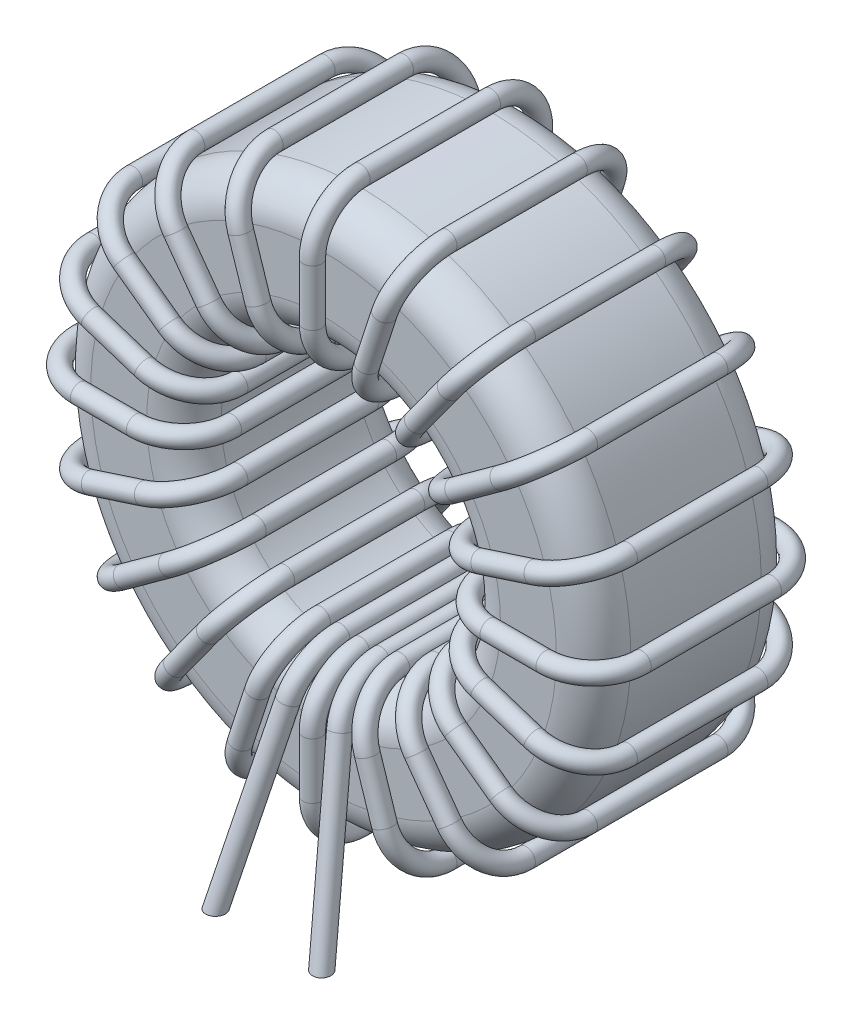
ISO-10303-21;
HEADER;
FILE_DESCRIPTION(('STEP AP214'),'2;1');
FILE_NAME('part.step','',(''),(''),'','','');
FILE_SCHEMA(('AUTOMOTIVE_DESIGN { 1 0 10303 214 1 1 1 1 }'));
ENDSEC;
DATA;
#1=APPLICATION_CONTEXT('core data for automotive mechanical design processes');
#2=APPLICATION_PROTOCOL_DEFINITION('international standard','automotive_design',2000,#1);
#3=PRODUCT_CONTEXT('',#1,'mechanical');
#4=PRODUCT('Part','Part','',(#3));
#5=PRODUCT_RELATED_PRODUCT_CATEGORY('part','',(#4));
#6=PRODUCT_DEFINITION_FORMATION('','',#4);
#7=PRODUCT_DEFINITION_CONTEXT('part definition',#1,'design');
#8=PRODUCT_DEFINITION('design','',#6,#7);
#9=PRODUCT_DEFINITION_SHAPE('','',#8);
#10=(LENGTH_UNIT() NAMED_UNIT(*) SI_UNIT(.MILLI.,.METRE.));
#11=(NAMED_UNIT(*) PLANE_ANGLE_UNIT() SI_UNIT($,.RADIAN.));
#12=(NAMED_UNIT(*) SI_UNIT($,.STERADIAN.) SOLID_ANGLE_UNIT());
#13=UNCERTAINTY_MEASURE_WITH_UNIT(LENGTH_MEASURE(1.E-05),#10,'distance_accuracy_value','');
#14=(GEOMETRIC_REPRESENTATION_CONTEXT(3) GLOBAL_UNCERTAINTY_ASSIGNED_CONTEXT((#13)) GLOBAL_UNIT_ASSIGNED_CONTEXT((#10,
#11,#12)) REPRESENTATION_CONTEXT('',''));
#15=CARTESIAN_POINT('',(0.,0.,0.));
#16=DIRECTION('',(0.,0.,1.));
#17=DIRECTION('',(1.,0.,0.));
#18=AXIS2_PLACEMENT_3D('',#15,#16,#17);
#19=CARTESIAN_POINT('',(0.,0.,1.75));
#20=DIRECTION('',(0.,0.,1.));
#21=DIRECTION('',(1.,0.,0.));
#22=AXIS2_PLACEMENT_3D('',#19,#20,#21);
#23=TOROIDAL_SURFACE('',#22,6.25,1.);
#24=CARTESIAN_POINT('',(0.,0.,2.75));
#25=DIRECTION('',(0.,0.,1.));
#26=DIRECTION('',(1.,0.,0.));
#27=AXIS2_PLACEMENT_3D('',#24,#25,#26);
#28=CIRCLE('',#27,6.25);
#29=CARTESIAN_POINT('',(6.25,0.,2.75));
#30=VERTEX_POINT('',#29);
#31=EDGE_CURVE('P0_E29',#30,#30,#28,.T.);
#32=ORIENTED_EDGE('',*,*,#31,.F.);
#33=EDGE_LOOP('',(#32));
#34=FACE_BOUND('',#33,.T.);
#35=CARTESIAN_POINT('',(0.,0.,1.75));
#36=DIRECTION('',(0.,0.,-1.));
#37=DIRECTION('',(1.,0.,0.));
#38=AXIS2_PLACEMENT_3D('',#35,#36,#37);
#39=CIRCLE('',#38,7.25);
#40=CARTESIAN_POINT('',(7.25,0.,1.75));
#41=VERTEX_POINT('',#40);
#42=EDGE_CURVE('P0_E10',#41,#41,#39,.T.);
#43=ORIENTED_EDGE('',*,*,#42,.F.);
#44=EDGE_LOOP('',(#43));
#45=FACE_BOUND('',#44,.T.);
#46=ADVANCED_FACE('P0_F15',(#34,#45),#23,.T.);
#47=CARTESIAN_POINT('',(0.,0.,1.75));
#48=DIRECTION('',(0.,0.,1.));
#49=DIRECTION('',(1.,0.,0.));
#50=AXIS2_PLACEMENT_3D('',#47,#48,#49);
#51=TOROIDAL_SURFACE('',#50,4.75,1.);
#52=CARTESIAN_POINT('',(0.,0.,1.75));
#53=DIRECTION('',(0.,0.,1.));
#54=DIRECTION('',(1.,0.,0.));
#55=AXIS2_PLACEMENT_3D('',#52,#53,#54);
#56=CIRCLE('',#55,3.75);
#57=CARTESIAN_POINT('',(3.75,0.,1.75));
#58=VERTEX_POINT('',#57);
#59=EDGE_CURVE('P0_E35',#58,#58,#56,.T.);
#60=ORIENTED_EDGE('',*,*,#59,.F.);
#61=EDGE_LOOP('',(#60));
#62=FACE_BOUND('',#61,.T.);
#63=CARTESIAN_POINT('',(0.,0.,2.75));
#64=DIRECTION('',(0.,0.,-1.));
#65=DIRECTION('',(1.,0.,0.));
#66=AXIS2_PLACEMENT_3D('',#63,#64,#65);
#67=CIRCLE('',#66,4.75);
#68=CARTESIAN_POINT('',(4.75,0.,2.75));
#69=VERTEX_POINT('',#68);
#70=EDGE_CURVE('P0_E27',#69,#69,#67,.T.);
#71=ORIENTED_EDGE('',*,*,#70,.F.);
#72=EDGE_LOOP('',(#71));
#73=FACE_BOUND('',#72,.T.);
#74=ADVANCED_FACE('P0_F62',(#62,#73),#51,.T.);
#75=CARTESIAN_POINT('',(0.,0.,-1.75));
#76=DIRECTION('',(0.,0.,1.));
#77=DIRECTION('',(1.,0.,0.));
#78=AXIS2_PLACEMENT_3D('',#75,#76,#77);
#79=TOROIDAL_SURFACE('',#78,4.75,1.);
#80=CARTESIAN_POINT('',(0.,0.,-2.75));
#81=DIRECTION('',(0.,0.,1.));
#82=DIRECTION('',(1.,0.,0.));
#83=AXIS2_PLACEMENT_3D('',#80,#81,#82);
#84=CIRCLE('',#83,4.75);
#85=CARTESIAN_POINT('',(4.75,0.,-2.75));
#86=VERTEX_POINT('',#85);
#87=EDGE_CURVE('P0_E38',#86,#86,#84,.T.);
#88=ORIENTED_EDGE('',*,*,#87,.F.);
#89=EDGE_LOOP('',(#88));
#90=FACE_BOUND('',#89,.T.);
#91=CARTESIAN_POINT('',(0.,0.,-1.75));
#92=DIRECTION('',(0.,0.,-1.));
#93=DIRECTION('',(1.,0.,0.));
#94=AXIS2_PLACEMENT_3D('',#91,#92,#93);
#95=CIRCLE('',#94,3.75);
#96=CARTESIAN_POINT('',(3.75,0.,-1.75));
#97=VERTEX_POINT('',#96);
#98=EDGE_CURVE('P0_E39',#97,#97,#95,.T.);
#99=ORIENTED_EDGE('',*,*,#98,.F.);
#100=EDGE_LOOP('',(#99));
#101=FACE_BOUND('',#100,.T.);
#102=ADVANCED_FACE('P0_F51',(#90,#101),#79,.T.);
#103=CARTESIAN_POINT('',(0.,0.,-1.75));
#104=DIRECTION('',(0.,0.,1.));
#105=DIRECTION('',(1.,0.,0.));
#106=AXIS2_PLACEMENT_3D('',#103,#104,#105);
#107=TOROIDAL_SURFACE('',#106,6.25,1.);
#108=CARTESIAN_POINT('',(0.,0.,-1.75));
#109=DIRECTION('',(0.,0.,1.));
#110=DIRECTION('',(1.,0.,0.));
#111=AXIS2_PLACEMENT_3D('',#108,#109,#110);
#112=CIRCLE('',#111,7.25);
#113=CARTESIAN_POINT('',(7.25,0.,-1.75));
#114=VERTEX_POINT('',#113);
#115=EDGE_CURVE('P0_E19',#114,#114,#112,.T.);
#116=ORIENTED_EDGE('',*,*,#115,.F.);
#117=EDGE_LOOP('',(#116));
#118=FACE_BOUND('',#117,.T.);
#119=CARTESIAN_POINT('',(0.,0.,-2.75));
#120=DIRECTION('',(0.,0.,-1.));
#121=DIRECTION('',(1.,0.,0.));
#122=AXIS2_PLACEMENT_3D('',#119,#120,#121);
#123=CIRCLE('',#122,6.25);
#124=CARTESIAN_POINT('',(6.25,0.,-2.75));
#125=VERTEX_POINT('',#124);
#126=EDGE_CURVE('P0_E32',#125,#125,#123,.T.);
#127=ORIENTED_EDGE('',*,*,#126,.F.);
#128=EDGE_LOOP('',(#127));
#129=FACE_BOUND('',#128,.T.);
#130=ADVANCED_FACE('P0_F48',(#118,#129),#107,.T.);
#131=CARTESIAN_POINT('',(0.,0.,2.75));
#132=DIRECTION('',(0.,0.,-1.));
#133=DIRECTION('',(-1.,0.,0.));
#134=AXIS2_PLACEMENT_3D('',#131,#132,#133);
#135=CYLINDRICAL_SURFACE('',#134,3.75);
#136=ORIENTED_EDGE('',*,*,#98,.T.);
#137=EDGE_LOOP('',(#136));
#138=FACE_BOUND('',#137,.T.);
#139=ORIENTED_EDGE('',*,*,#59,.T.);
#140=EDGE_LOOP('',(#139));
#141=FACE_BOUND('',#140,.T.);
#142=ADVANCED_FACE('P0_F50',(#138,#141),#135,.F.);
#143=CARTESIAN_POINT('',(0.,0.,2.75));
#144=DIRECTION('',(0.,0.,-1.));
#145=DIRECTION('',(-1.,0.,0.));
#146=AXIS2_PLACEMENT_3D('',#143,#144,#145);
#147=CYLINDRICAL_SURFACE('',#146,7.25);
#148=ORIENTED_EDGE('',*,*,#115,.T.);
#149=EDGE_LOOP('',(#148));
#150=FACE_BOUND('',#149,.T.);
#151=ORIENTED_EDGE('',*,*,#42,.T.);
#152=EDGE_LOOP('',(#151));
#153=FACE_BOUND('',#152,.T.);
#154=ADVANCED_FACE('P0_F59',(#150,#153),#147,.T.);
#155=CARTESIAN_POINT('',(0.,0.,2.75));
#156=DIRECTION('',(0.,0.,1.));
#157=DIRECTION('',(1.,0.,0.));
#158=AXIS2_PLACEMENT_3D('',#155,#156,#157);
#159=PLANE('',#158);
#160=ORIENTED_EDGE('',*,*,#70,.T.);
#161=EDGE_LOOP('',(#160));
#162=FACE_BOUND('',#161,.T.);
#163=ORIENTED_EDGE('',*,*,#31,.T.);
#164=EDGE_LOOP('',(#163));
#165=FACE_BOUND('',#164,.T.);
#166=ADVANCED_FACE('P0_F77',(#162,#165),#159,.T.);
#167=CARTESIAN_POINT('',(0.,0.,-2.75));
#168=DIRECTION('',(0.,0.,1.));
#169=DIRECTION('',(1.,0.,0.));
#170=AXIS2_PLACEMENT_3D('',#167,#168,#169);
#171=PLANE('',#170);
#172=ORIENTED_EDGE('',*,*,#126,.T.);
#173=EDGE_LOOP('',(#172));
#174=FACE_BOUND('',#173,.T.);
#175=ORIENTED_EDGE('',*,*,#87,.T.);
#176=EDGE_LOOP('',(#175));
#177=FACE_BOUND('',#176,.T.);
#178=ADVANCED_FACE('P0_F17',(#174,#177),#171,.F.);
#179=CLOSED_SHELL('',(#46,#74,#102,#130,#142,#154,#166,#178));
#180=MANIFOLD_SOLID_BREP('P0_B1',#179);
#181=CARTESIAN_POINT('',(-5.05635621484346,-3.67365782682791,1.75));
#182=DIRECTION('',(-0.587785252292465,0.809016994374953,0.));
#183=DIRECTION('',(0.,0.,-1.));
#184=AXIS2_PLACEMENT_3D('',#181,#182,#183);
#185=TOROIDAL_SURFACE('',#184,1.3,0.25);
#186=CARTESIAN_POINT('',(-6.10807830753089,-4.43777865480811,1.74999999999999));
#187=DIRECTION('',(0.,0.,1.));
#188=DIRECTION('',(-0.587785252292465,0.809016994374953,0.));
#189=AXIS2_PLACEMENT_3D('',#186,#187,#188);
#190=CIRCLE('',#189,0.25);
#191=CARTESIAN_POINT('',(-6.31033255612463,-4.58472496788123,1.74999999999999));
#192=VERTEX_POINT('',#191);
#193=EDGE_CURVE('P1_E10',#192,#192,#190,.T.);
#194=CARTESIAN_POINT('',(-5.05635621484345,-3.6736578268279,3.05));
#195=DIRECTION('',(0.809016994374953,0.587785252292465,0.));
#196=DIRECTION('',(-0.587785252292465,0.809016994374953,0.));
#197=AXIS2_PLACEMENT_3D('',#194,#195,#196);
#198=CIRCLE('',#197,0.25);
#199=CARTESIAN_POINT('',(-5.05635621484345,-3.6736578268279,3.3));
#200=VERTEX_POINT('',#199);
#201=EDGE_CURVE('P1_E31',#200,#200,#198,.T.);
#202=CARTESIAN_POINT('',(-5.05635621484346,-3.67365782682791,1.75));
#203=DIRECTION('',(-0.587785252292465,0.809016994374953,0.));
#204=DIRECTION('',(0.,0.,-1.));
#205=AXIS2_PLACEMENT_3D('',#202,#203,#204);
#206=CIRCLE('',#205,1.55);
#207=EDGE_CURVE('',#192,#200,#206,.T.);
#208=ORIENTED_EDGE('',*,*,#193,.T.);
#209=ORIENTED_EDGE('',*,*,#201,.F.);
#210=ORIENTED_EDGE('',*,*,#207,.T.);
#211=ORIENTED_EDGE('',*,*,#207,.F.);
#212=EDGE_LOOP('',(#208,#210,#209,#211));
#213=FACE_BOUND('',#212,.T.);
#214=ADVANCED_FACE('P1_F15',(#213),#185,.T.);
#215=CARTESIAN_POINT('',(-3.84283072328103,-2.79197994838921,1.75));
#216=DIRECTION('',(-0.587785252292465,0.809016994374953,0.));
#217=DIRECTION('',(0.,0.,-1.));
#218=AXIS2_PLACEMENT_3D('',#215,#216,#217);
#219=TOROIDAL_SURFACE('',#218,1.3,0.25);
#220=CARTESIAN_POINT('',(-3.84283072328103,-2.79197994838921,3.05));
#221=DIRECTION('',(0.809016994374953,0.587785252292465,0.));
#222=DIRECTION('',(-0.587785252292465,0.809016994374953,0.));
#223=AXIS2_PLACEMENT_3D('',#220,#221,#222);
#224=CIRCLE('',#223,0.25);
#225=CARTESIAN_POINT('',(-3.84283072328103,-2.79197994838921,3.3));
#226=VERTEX_POINT('',#225);
#227=EDGE_CURVE('P1_E23',#226,#226,#224,.T.);
#228=CARTESIAN_POINT('',(-2.79110863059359,-2.02785912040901,1.74999999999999));
#229=DIRECTION('',(0.,0.,-1.));
#230=DIRECTION('',(-0.587785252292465,0.809016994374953,0.));
#231=AXIS2_PLACEMENT_3D('',#228,#229,#230);
#232=CIRCLE('',#231,0.25);
#233=CARTESIAN_POINT('',(-2.58885438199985,-1.88091280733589,1.74999999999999));
#234=VERTEX_POINT('',#233);
#235=EDGE_CURVE('P1_E33',#234,#234,#232,.T.);
#236=CARTESIAN_POINT('',(-3.84283072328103,-2.79197994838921,1.75));
#237=DIRECTION('',(-0.587785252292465,0.809016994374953,0.));
#238=DIRECTION('',(0.,0.,-1.));
#239=AXIS2_PLACEMENT_3D('',#236,#237,#238);
#240=CIRCLE('',#239,1.55);
#241=EDGE_CURVE('',#226,#234,#240,.T.);
#242=ORIENTED_EDGE('',*,*,#227,.T.);
#243=ORIENTED_EDGE('',*,*,#235,.F.);
#244=ORIENTED_EDGE('',*,*,#241,.T.);
#245=ORIENTED_EDGE('',*,*,#241,.F.);
#246=EDGE_LOOP('',(#242,#244,#243,#245));
#247=FACE_BOUND('',#246,.T.);
#248=ADVANCED_FACE('P1_F62',(#247),#219,.T.);
#249=CARTESIAN_POINT('',(-3.84283072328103,-2.79197994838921,-1.75));
#250=DIRECTION('',(-0.587785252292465,0.809016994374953,0.));
#251=DIRECTION('',(0.,0.,-1.));
#252=AXIS2_PLACEMENT_3D('',#249,#250,#251);
#253=TOROIDAL_SURFACE('',#252,1.3,0.25);
#254=CARTESIAN_POINT('',(-2.79110863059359,-2.02785912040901,-1.74999999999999));
#255=DIRECTION('',(0.,0.,-1.));
#256=DIRECTION('',(-0.587785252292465,0.809016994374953,0.));
#257=AXIS2_PLACEMENT_3D('',#254,#255,#256);
#258=CIRCLE('',#257,0.25);
#259=CARTESIAN_POINT('',(-2.58885438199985,-1.88091280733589,-1.74999999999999));
#260=VERTEX_POINT('',#259);
#261=EDGE_CURVE('P1_E28',#260,#260,#258,.T.);
#262=CARTESIAN_POINT('',(-3.84283072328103,-2.79197994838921,-3.05));
#263=DIRECTION('',(-0.809016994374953,-0.587785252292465,0.));
#264=DIRECTION('',(-0.587785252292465,0.809016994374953,0.));
#265=AXIS2_PLACEMENT_3D('',#262,#263,#264);
#266=CIRCLE('',#265,0.25);
#267=CARTESIAN_POINT('',(-3.84283072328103,-2.79197994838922,-3.3));
#268=VERTEX_POINT('',#267);
#269=EDGE_CURVE('P1_E37',#268,#268,#266,.T.);
#270=CARTESIAN_POINT('',(-3.84283072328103,-2.79197994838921,-1.75));
#271=DIRECTION('',(-0.587785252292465,0.809016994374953,0.));
#272=DIRECTION('',(0.,0.,-1.));
#273=AXIS2_PLACEMENT_3D('',#270,#271,#272);
#274=CIRCLE('',#273,1.55);
#275=EDGE_CURVE('',#260,#268,#274,.T.);
#276=ORIENTED_EDGE('',*,*,#261,.T.);
#277=ORIENTED_EDGE('',*,*,#269,.F.);
#278=ORIENTED_EDGE('',*,*,#275,.T.);
#279=ORIENTED_EDGE('',*,*,#275,.F.);
#280=EDGE_LOOP('',(#276,#278,#277,#279));
#281=FACE_BOUND('',#280,.T.);
#282=ADVANCED_FACE('P1_F53',(#281),#253,.T.);
#283=CARTESIAN_POINT('',(-5.05635621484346,-3.67365782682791,-1.75));
#284=DIRECTION('',(-0.587785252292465,0.809016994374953,0.));
#285=DIRECTION('',(0.,0.,-1.));
#286=AXIS2_PLACEMENT_3D('',#283,#284,#285);
#287=TOROIDAL_SURFACE('',#286,1.3,0.25);
#288=CARTESIAN_POINT('',(-5.05635621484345,-3.6736578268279,-3.05));
#289=DIRECTION('',(-0.809016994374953,-0.587785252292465,0.));
#290=DIRECTION('',(-0.587785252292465,0.809016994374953,0.));
#291=AXIS2_PLACEMENT_3D('',#288,#289,#290);
#292=CIRCLE('',#291,0.25);
#293=CARTESIAN_POINT('',(-5.05635621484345,-3.6736578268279,-3.3));
#294=VERTEX_POINT('',#293);
#295=EDGE_CURVE('P1_E40',#294,#294,#292,.T.);
#296=CARTESIAN_POINT('',(-6.1080783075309,-4.43777865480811,-1.74999999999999));
#297=DIRECTION('',(0.,0.,1.));
#298=DIRECTION('',(-0.587785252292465,0.809016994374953,0.));
#299=AXIS2_PLACEMENT_3D('',#296,#297,#298);
#300=CIRCLE('',#299,0.25);
#301=CARTESIAN_POINT('',(-6.31033255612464,-4.58472496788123,-1.74999999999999));
#302=VERTEX_POINT('',#301);
#303=EDGE_CURVE('P1_E19',#302,#302,#300,.T.);
#304=CARTESIAN_POINT('',(-5.05635621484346,-3.67365782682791,-1.75));
#305=DIRECTION('',(-0.587785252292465,0.809016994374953,0.));
#306=DIRECTION('',(0.,0.,-1.));
#307=AXIS2_PLACEMENT_3D('',#304,#305,#306);
#308=CIRCLE('',#307,1.55);
#309=EDGE_CURVE('',#294,#302,#308,.T.);
#310=ORIENTED_EDGE('',*,*,#295,.T.);
#311=ORIENTED_EDGE('',*,*,#303,.F.);
#312=ORIENTED_EDGE('',*,*,#309,.T.);
#313=ORIENTED_EDGE('',*,*,#309,.F.);
#314=EDGE_LOOP('',(#310,#312,#311,#313));
#315=FACE_BOUND('',#314,.T.);
#316=ADVANCED_FACE('P1_F51',(#315),#287,.T.);
#317=CARTESIAN_POINT('',(-6.10807830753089,-4.43777865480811,1.74999999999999));
#318=DIRECTION('',(0.,0.,-1.));
#319=DIRECTION('',(0.587785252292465,-0.809016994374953,0.));
#320=AXIS2_PLACEMENT_3D('',#317,#318,#319);
#321=CYLINDRICAL_SURFACE('',#320,0.25);
#322=ORIENTED_EDGE('',*,*,#303,.T.);
#323=EDGE_LOOP('',(#322));
#324=FACE_BOUND('',#323,.T.);
#325=ORIENTED_EDGE('',*,*,#193,.F.);
#326=EDGE_LOOP('',(#325));
#327=FACE_BOUND('',#326,.T.);
#328=ADVANCED_FACE('P1_F48',(#324,#327),#321,.T.);
#329=CARTESIAN_POINT('',(-5.05635621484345,-3.6736578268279,3.05));
#330=DIRECTION('',(0.809016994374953,0.587785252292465,0.));
#331=DIRECTION('',(0.,0.,-1.));
#332=AXIS2_PLACEMENT_3D('',#329,#330,#331);
#333=CYLINDRICAL_SURFACE('',#332,0.25);
#334=ORIENTED_EDGE('',*,*,#227,.F.);
#335=EDGE_LOOP('',(#334));
#336=FACE_BOUND('',#335,.T.);
#337=ORIENTED_EDGE('',*,*,#201,.T.);
#338=EDGE_LOOP('',(#337));
#339=FACE_BOUND('',#338,.T.);
#340=ADVANCED_FACE('P1_F60',(#336,#339),#333,.T.);
#341=CARTESIAN_POINT('',(-2.79110863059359,-2.02785912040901,1.74999999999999));
#342=DIRECTION('',(0.,0.,-1.));
#343=DIRECTION('',(-0.809016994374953,-0.587785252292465,0.));
#344=AXIS2_PLACEMENT_3D('',#341,#342,#343);
#345=CYLINDRICAL_SURFACE('',#344,0.25);
#346=ORIENTED_EDGE('',*,*,#261,.F.);
#347=EDGE_LOOP('',(#346));
#348=FACE_BOUND('',#347,.T.);
#349=ORIENTED_EDGE('',*,*,#235,.T.);
#350=EDGE_LOOP('',(#349));
#351=FACE_BOUND('',#350,.T.);
#352=ADVANCED_FACE('P1_F76',(#348,#351),#345,.T.);
#353=CARTESIAN_POINT('',(-3.84283072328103,-2.79197994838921,-3.05));
#354=DIRECTION('',(-0.809016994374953,-0.587785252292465,0.));
#355=DIRECTION('',(0.,0.,1.));
#356=AXIS2_PLACEMENT_3D('',#353,#354,#355);
#357=CYLINDRICAL_SURFACE('',#356,0.25);
#358=ORIENTED_EDGE('',*,*,#295,.F.);
#359=EDGE_LOOP('',(#358));
#360=FACE_BOUND('',#359,.T.);
#361=ORIENTED_EDGE('',*,*,#269,.T.);
#362=EDGE_LOOP('',(#361));
#363=FACE_BOUND('',#362,.T.);
#364=ADVANCED_FACE('P1_F17',(#360,#363),#357,.T.);
#365=CLOSED_SHELL('',(#214,#248,#282,#316,#328,#340,#352,#364));
#366=MANIFOLD_SOLID_BREP('P1_B1',#365);
#367=CARTESIAN_POINT('',(-5.05635621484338,3.67365782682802,1.75));
#368=DIRECTION('',(0.587785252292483,0.80901699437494,0.));
#369=DIRECTION('',(0.,0.,-1.));
#370=AXIS2_PLACEMENT_3D('',#367,#368,#369);
#371=TOROIDAL_SURFACE('',#370,1.3,0.25);
#372=CARTESIAN_POINT('',(-6.1080783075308,4.43777865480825,1.74999999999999));
#373=DIRECTION('',(0.,0.,1.));
#374=DIRECTION('',(0.587785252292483,0.80901699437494,0.));
#375=AXIS2_PLACEMENT_3D('',#372,#373,#374);
#376=CIRCLE('',#375,0.25);
#377=CARTESIAN_POINT('',(-6.31033255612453,4.58472496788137,1.74999999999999));
#378=VERTEX_POINT('',#377);
#379=EDGE_CURVE('P2_E10',#378,#378,#376,.T.);
#380=CARTESIAN_POINT('',(-5.05635621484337,3.67365782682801,3.05));
#381=DIRECTION('',(0.80901699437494,-0.587785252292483,0.));
#382=DIRECTION('',(0.587785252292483,0.80901699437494,0.));
#383=AXIS2_PLACEMENT_3D('',#380,#381,#382);
#384=CIRCLE('',#383,0.25);
#385=CARTESIAN_POINT('',(-5.05635621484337,3.67365782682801,3.3));
#386=VERTEX_POINT('',#385);
#387=EDGE_CURVE('P2_E31',#386,#386,#384,.T.);
#388=CARTESIAN_POINT('',(-5.05635621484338,3.67365782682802,1.75));
#389=DIRECTION('',(0.587785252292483,0.80901699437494,0.));
#390=DIRECTION('',(0.,0.,-1.));
#391=AXIS2_PLACEMENT_3D('',#388,#389,#390);
#392=CIRCLE('',#391,1.55);
#393=EDGE_CURVE('',#378,#386,#392,.T.);
#394=ORIENTED_EDGE('',*,*,#379,.T.);
#395=ORIENTED_EDGE('',*,*,#387,.F.);
#396=ORIENTED_EDGE('',*,*,#393,.T.);
#397=ORIENTED_EDGE('',*,*,#393,.F.);
#398=EDGE_LOOP('',(#394,#396,#395,#397));
#399=FACE_BOUND('',#398,.T.);
#400=ADVANCED_FACE('P2_F15',(#399),#371,.T.);
#401=CARTESIAN_POINT('',(-3.84283072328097,2.79197994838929,1.75));
#402=DIRECTION('',(0.587785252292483,0.80901699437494,0.));
#403=DIRECTION('',(0.,0.,-1.));
#404=AXIS2_PLACEMENT_3D('',#401,#402,#403);
#405=TOROIDAL_SURFACE('',#404,1.3,0.25);
#406=CARTESIAN_POINT('',(-3.84283072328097,2.79197994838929,3.05));
#407=DIRECTION('',(0.80901699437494,-0.587785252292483,0.));
#408=DIRECTION('',(0.587785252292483,0.80901699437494,0.));
#409=AXIS2_PLACEMENT_3D('',#406,#407,#408);
#410=CIRCLE('',#409,0.25);
#411=CARTESIAN_POINT('',(-3.84283072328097,2.79197994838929,3.3));
#412=VERTEX_POINT('',#411);
#413=EDGE_CURVE('P2_E23',#412,#412,#410,.T.);
#414=CARTESIAN_POINT('',(-2.79110863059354,2.02785912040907,1.74999999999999));
#415=DIRECTION('',(0.,0.,-1.));
#416=DIRECTION('',(0.587785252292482,0.809016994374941,0.));
#417=AXIS2_PLACEMENT_3D('',#414,#415,#416);
#418=CIRCLE('',#417,0.25);
#419=CARTESIAN_POINT('',(-2.58885438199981,1.88091280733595,1.74999999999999));
#420=VERTEX_POINT('',#419);
#421=EDGE_CURVE('P2_E33',#420,#420,#418,.T.);
#422=CARTESIAN_POINT('',(-3.84283072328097,2.79197994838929,1.75));
#423=DIRECTION('',(0.587785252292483,0.80901699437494,0.));
#424=DIRECTION('',(0.,0.,-1.));
#425=AXIS2_PLACEMENT_3D('',#422,#423,#424);
#426=CIRCLE('',#425,1.55);
#427=EDGE_CURVE('',#412,#420,#426,.T.);
#428=ORIENTED_EDGE('',*,*,#413,.T.);
#429=ORIENTED_EDGE('',*,*,#421,.F.);
#430=ORIENTED_EDGE('',*,*,#427,.T.);
#431=ORIENTED_EDGE('',*,*,#427,.F.);
#432=EDGE_LOOP('',(#428,#430,#429,#431));
#433=FACE_BOUND('',#432,.T.);
#434=ADVANCED_FACE('P2_F62',(#433),#405,.T.);
#435=CARTESIAN_POINT('',(-3.84283072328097,2.79197994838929,-1.75));
#436=DIRECTION('',(0.587785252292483,0.80901699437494,0.));
#437=DIRECTION('',(0.,0.,-1.));
#438=AXIS2_PLACEMENT_3D('',#435,#436,#437);
#439=TOROIDAL_SURFACE('',#438,1.3,0.25);
#440=CARTESIAN_POINT('',(-2.79110863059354,2.02785912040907,-1.74999999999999));
#441=DIRECTION('',(0.,0.,-1.));
#442=DIRECTION('',(0.587785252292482,0.809016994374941,0.));
#443=AXIS2_PLACEMENT_3D('',#440,#441,#442);
#444=CIRCLE('',#443,0.25);
#445=CARTESIAN_POINT('',(-2.58885438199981,1.88091280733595,-1.74999999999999));
#446=VERTEX_POINT('',#445);
#447=EDGE_CURVE('P2_E28',#446,#446,#444,.T.);
#448=CARTESIAN_POINT('',(-3.84283072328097,2.7919799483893,-3.05));
#449=DIRECTION('',(-0.80901699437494,0.587785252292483,0.));
#450=DIRECTION('',(0.587785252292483,0.80901699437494,0.));
#451=AXIS2_PLACEMENT_3D('',#448,#449,#450);
#452=CIRCLE('',#451,0.25);
#453=CARTESIAN_POINT('',(-3.84283072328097,2.7919799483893,-3.3));
#454=VERTEX_POINT('',#453);
#455=EDGE_CURVE('P2_E37',#454,#454,#452,.T.);
#456=CARTESIAN_POINT('',(-3.84283072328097,2.79197994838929,-1.75));
#457=DIRECTION('',(0.587785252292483,0.80901699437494,0.));
#458=DIRECTION('',(0.,0.,-1.));
#459=AXIS2_PLACEMENT_3D('',#456,#457,#458);
#460=CIRCLE('',#459,1.55);
#461=EDGE_CURVE('',#446,#454,#460,.T.);
#462=ORIENTED_EDGE('',*,*,#447,.T.);
#463=ORIENTED_EDGE('',*,*,#455,.F.);
#464=ORIENTED_EDGE('',*,*,#461,.T.);
#465=ORIENTED_EDGE('',*,*,#461,.F.);
#466=EDGE_LOOP('',(#462,#464,#463,#465));
#467=FACE_BOUND('',#466,.T.);
#468=ADVANCED_FACE('P2_F53',(#467),#439,.T.);
#469=CARTESIAN_POINT('',(-5.05635621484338,3.67365782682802,-1.75));
#470=DIRECTION('',(0.587785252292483,0.80901699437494,0.));
#471=DIRECTION('',(0.,0.,-1.));
#472=AXIS2_PLACEMENT_3D('',#469,#470,#471);
#473=TOROIDAL_SURFACE('',#472,1.3,0.25);
#474=CARTESIAN_POINT('',(-5.05635621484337,3.67365782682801,-3.05));
#475=DIRECTION('',(-0.80901699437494,0.587785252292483,0.));
#476=DIRECTION('',(0.587785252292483,0.80901699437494,0.));
#477=AXIS2_PLACEMENT_3D('',#474,#475,#476);
#478=CIRCLE('',#477,0.25);
#479=CARTESIAN_POINT('',(-5.05635621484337,3.67365782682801,-3.3));
#480=VERTEX_POINT('',#479);
#481=EDGE_CURVE('P2_E40',#480,#480,#478,.T.);
#482=CARTESIAN_POINT('',(-6.1080783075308,4.43777865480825,-1.74999999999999));
#483=DIRECTION('',(0.,0.,1.));
#484=DIRECTION('',(0.587785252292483,0.80901699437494,0.));
#485=AXIS2_PLACEMENT_3D('',#482,#483,#484);
#486=CIRCLE('',#485,0.25);
#487=CARTESIAN_POINT('',(-6.31033255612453,4.58472496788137,-1.74999999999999));
#488=VERTEX_POINT('',#487);
#489=EDGE_CURVE('P2_E19',#488,#488,#486,.T.);
#490=CARTESIAN_POINT('',(-5.05635621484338,3.67365782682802,-1.75));
#491=DIRECTION('',(0.587785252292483,0.80901699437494,0.));
#492=DIRECTION('',(0.,0.,-1.));
#493=AXIS2_PLACEMENT_3D('',#490,#491,#492);
#494=CIRCLE('',#493,1.55);
#495=EDGE_CURVE('',#480,#488,#494,.T.);
#496=ORIENTED_EDGE('',*,*,#481,.T.);
#497=ORIENTED_EDGE('',*,*,#489,.F.);
#498=ORIENTED_EDGE('',*,*,#495,.T.);
#499=ORIENTED_EDGE('',*,*,#495,.F.);
#500=EDGE_LOOP('',(#496,#498,#497,#499));
#501=FACE_BOUND('',#500,.T.);
#502=ADVANCED_FACE('P2_F51',(#501),#473,.T.);
#503=CARTESIAN_POINT('',(-6.1080783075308,4.43777865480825,1.74999999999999));
#504=DIRECTION('',(0.,0.,-1.));
#505=DIRECTION('',(-0.587785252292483,-0.80901699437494,0.));
#506=AXIS2_PLACEMENT_3D('',#503,#504,#505);
#507=CYLINDRICAL_SURFACE('',#506,0.25);
#508=ORIENTED_EDGE('',*,*,#489,.T.);
#509=EDGE_LOOP('',(#508));
#510=FACE_BOUND('',#509,.T.);
#511=ORIENTED_EDGE('',*,*,#379,.F.);
#512=EDGE_LOOP('',(#511));
#513=FACE_BOUND('',#512,.T.);
#514=ADVANCED_FACE('P2_F48',(#510,#513),#507,.T.);
#515=CARTESIAN_POINT('',(-5.05635621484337,3.67365782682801,3.05));
#516=DIRECTION('',(0.80901699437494,-0.587785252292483,0.));
#517=DIRECTION('',(0.,0.,-1.));
#518=AXIS2_PLACEMENT_3D('',#515,#516,#517);
#519=CYLINDRICAL_SURFACE('',#518,0.25);
#520=ORIENTED_EDGE('',*,*,#413,.F.);
#521=EDGE_LOOP('',(#520));
#522=FACE_BOUND('',#521,.T.);
#523=ORIENTED_EDGE('',*,*,#387,.T.);
#524=EDGE_LOOP('',(#523));
#525=FACE_BOUND('',#524,.T.);
#526=ADVANCED_FACE('P2_F60',(#522,#525),#519,.T.);
#527=CARTESIAN_POINT('',(-2.79110863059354,2.02785912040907,1.74999999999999));
#528=DIRECTION('',(0.,0.,-1.));
#529=DIRECTION('',(-0.809016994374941,0.587785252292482,0.));
#530=AXIS2_PLACEMENT_3D('',#527,#528,#529);
#531=CYLINDRICAL_SURFACE('',#530,0.25);
#532=ORIENTED_EDGE('',*,*,#447,.F.);
#533=EDGE_LOOP('',(#532));
#534=FACE_BOUND('',#533,.T.);
#535=ORIENTED_EDGE('',*,*,#421,.T.);
#536=EDGE_LOOP('',(#535));
#537=FACE_BOUND('',#536,.T.);
#538=ADVANCED_FACE('P2_F76',(#534,#537),#531,.T.);
#539=CARTESIAN_POINT('',(-3.84283072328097,2.7919799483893,-3.05));
#540=DIRECTION('',(-0.80901699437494,0.587785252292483,0.));
#541=DIRECTION('',(0.,0.,1.));
#542=AXIS2_PLACEMENT_3D('',#539,#540,#541);
#543=CYLINDRICAL_SURFACE('',#542,0.25);
#544=ORIENTED_EDGE('',*,*,#481,.F.);
#545=EDGE_LOOP('',(#544));
#546=FACE_BOUND('',#545,.T.);
#547=ORIENTED_EDGE('',*,*,#455,.T.);
#548=EDGE_LOOP('',(#547));
#549=FACE_BOUND('',#548,.T.);
#550=ADVANCED_FACE('P2_F17',(#546,#549),#543,.T.);
#551=CLOSED_SHELL('',(#400,#434,#468,#502,#514,#526,#538,#550));
#552=MANIFOLD_SOLID_BREP('P2_B1',#551);
#553=CARTESIAN_POINT('',(3.67365782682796,5.05635621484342,1.75));
#554=DIRECTION('',(0.809016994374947,-0.587785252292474,0.));
#555=DIRECTION('',(0.,0.,-1.));
#556=AXIS2_PLACEMENT_3D('',#553,#554,#555);
#557=TOROIDAL_SURFACE('',#556,1.3,0.25);
#558=CARTESIAN_POINT('',(4.43777865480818,6.10807830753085,1.74999999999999));
#559=DIRECTION('',(0.,0.,1.));
#560=DIRECTION('',(0.809016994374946,-0.587785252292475,0.));
#561=AXIS2_PLACEMENT_3D('',#558,#559,#560);
#562=CIRCLE('',#561,0.25);
#563=CARTESIAN_POINT('',(4.5847249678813,6.31033255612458,1.74999999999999));
#564=VERTEX_POINT('',#563);
#565=EDGE_CURVE('P3_E10',#564,#564,#562,.T.);
#566=CARTESIAN_POINT('',(3.67365782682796,5.05635621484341,3.05));
#567=DIRECTION('',(-0.587785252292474,-0.809016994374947,0.));
#568=DIRECTION('',(0.809016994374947,-0.587785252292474,0.));
#569=AXIS2_PLACEMENT_3D('',#566,#567,#568);
#570=CIRCLE('',#569,0.25);
#571=CARTESIAN_POINT('',(3.67365782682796,5.05635621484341,3.3));
#572=VERTEX_POINT('',#571);
#573=EDGE_CURVE('P3_E31',#572,#572,#570,.T.);
#574=CARTESIAN_POINT('',(3.67365782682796,5.05635621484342,1.75));
#575=DIRECTION('',(0.809016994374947,-0.587785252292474,0.));
#576=DIRECTION('',(0.,0.,-1.));
#577=AXIS2_PLACEMENT_3D('',#574,#575,#576);
#578=CIRCLE('',#577,1.55);
#579=EDGE_CURVE('',#564,#572,#578,.T.);
#580=ORIENTED_EDGE('',*,*,#565,.T.);
#581=ORIENTED_EDGE('',*,*,#573,.F.);
#582=ORIENTED_EDGE('',*,*,#579,.T.);
#583=ORIENTED_EDGE('',*,*,#579,.F.);
#584=EDGE_LOOP('',(#580,#582,#581,#583));
#585=FACE_BOUND('',#584,.T.);
#586=ADVANCED_FACE('P3_F15',(#585),#557,.T.);
#587=CARTESIAN_POINT('',(2.79197994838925,3.842830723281,1.75));
#588=DIRECTION('',(0.809016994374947,-0.587785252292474,0.));
#589=DIRECTION('',(0.,0.,-1.));
#590=AXIS2_PLACEMENT_3D('',#587,#588,#589);
#591=TOROIDAL_SURFACE('',#590,1.3,0.25);
#592=CARTESIAN_POINT('',(2.79197994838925,3.842830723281,3.05));
#593=DIRECTION('',(-0.587785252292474,-0.809016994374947,0.));
#594=DIRECTION('',(0.809016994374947,-0.587785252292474,0.));
#595=AXIS2_PLACEMENT_3D('',#592,#593,#594);
#596=CIRCLE('',#595,0.25);
#597=CARTESIAN_POINT('',(2.79197994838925,3.842830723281,3.3));
#598=VERTEX_POINT('',#597);
#599=EDGE_CURVE('P3_E23',#598,#598,#596,.T.);
#600=CARTESIAN_POINT('',(2.02785912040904,2.79110863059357,1.74999999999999));
#601=DIRECTION('',(0.,0.,-1.));
#602=DIRECTION('',(0.809016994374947,-0.587785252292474,0.));
#603=AXIS2_PLACEMENT_3D('',#600,#601,#602);
#604=CIRCLE('',#603,0.25);
#605=CARTESIAN_POINT('',(1.88091280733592,2.58885438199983,1.74999999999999));
#606=VERTEX_POINT('',#605);
#607=EDGE_CURVE('P3_E33',#606,#606,#604,.T.);
#608=CARTESIAN_POINT('',(2.79197994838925,3.842830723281,1.75));
#609=DIRECTION('',(0.809016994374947,-0.587785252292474,0.));
#610=DIRECTION('',(0.,0.,-1.));
#611=AXIS2_PLACEMENT_3D('',#608,#609,#610);
#612=CIRCLE('',#611,1.55);
#613=EDGE_CURVE('',#598,#606,#612,.T.);
#614=ORIENTED_EDGE('',*,*,#599,.T.);
#615=ORIENTED_EDGE('',*,*,#607,.F.);
#616=ORIENTED_EDGE('',*,*,#613,.T.);
#617=ORIENTED_EDGE('',*,*,#613,.F.);
#618=EDGE_LOOP('',(#614,#616,#615,#617));
#619=FACE_BOUND('',#618,.T.);
#620=ADVANCED_FACE('P3_F62',(#619),#591,.T.);
#621=CARTESIAN_POINT('',(2.79197994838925,3.842830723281,-1.75));
#622=DIRECTION('',(0.809016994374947,-0.587785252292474,0.));
#623=DIRECTION('',(0.,0.,-1.));
#624=AXIS2_PLACEMENT_3D('',#621,#622,#623);
#625=TOROIDAL_SURFACE('',#624,1.3,0.25);
#626=CARTESIAN_POINT('',(2.02785912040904,2.79110863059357,-1.74999999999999));
#627=DIRECTION('',(0.,0.,-1.));
#628=DIRECTION('',(0.809016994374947,-0.587785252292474,0.));
#629=AXIS2_PLACEMENT_3D('',#626,#627,#628);
#630=CIRCLE('',#629,0.25);
#631=CARTESIAN_POINT('',(1.88091280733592,2.58885438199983,-1.74999999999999));
#632=VERTEX_POINT('',#631);
#633=EDGE_CURVE('P3_E28',#632,#632,#630,.T.);
#634=CARTESIAN_POINT('',(2.79197994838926,3.842830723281,-3.05));
#635=DIRECTION('',(0.587785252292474,0.809016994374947,0.));
#636=DIRECTION('',(0.809016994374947,-0.587785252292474,0.));
#637=AXIS2_PLACEMENT_3D('',#634,#635,#636);
#638=CIRCLE('',#637,0.25);
#639=CARTESIAN_POINT('',(2.79197994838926,3.842830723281,-3.3));
#640=VERTEX_POINT('',#639);
#641=EDGE_CURVE('P3_E37',#640,#640,#638,.T.);
#642=CARTESIAN_POINT('',(2.79197994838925,3.842830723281,-1.75));
#643=DIRECTION('',(0.809016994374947,-0.587785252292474,0.));
#644=DIRECTION('',(0.,0.,-1.));
#645=AXIS2_PLACEMENT_3D('',#642,#643,#644);
#646=CIRCLE('',#645,1.55);
#647=EDGE_CURVE('',#632,#640,#646,.T.);
#648=ORIENTED_EDGE('',*,*,#633,.T.);
#649=ORIENTED_EDGE('',*,*,#641,.F.);
#650=ORIENTED_EDGE('',*,*,#647,.T.);
#651=ORIENTED_EDGE('',*,*,#647,.F.);
#652=EDGE_LOOP('',(#648,#650,#649,#651));
#653=FACE_BOUND('',#652,.T.);
#654=ADVANCED_FACE('P3_F53',(#653),#625,.T.);
#655=CARTESIAN_POINT('',(3.67365782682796,5.05635621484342,-1.75));
#656=DIRECTION('',(0.809016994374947,-0.587785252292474,0.));
#657=DIRECTION('',(0.,0.,-1.));
#658=AXIS2_PLACEMENT_3D('',#655,#656,#657);
#659=TOROIDAL_SURFACE('',#658,1.3,0.25);
#660=CARTESIAN_POINT('',(3.67365782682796,5.05635621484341,-3.05));
#661=DIRECTION('',(0.587785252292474,0.809016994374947,0.));
#662=DIRECTION('',(0.809016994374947,-0.587785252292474,0.));
#663=AXIS2_PLACEMENT_3D('',#660,#661,#662);
#664=CIRCLE('',#663,0.25);
#665=CARTESIAN_POINT('',(3.67365782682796,5.05635621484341,-3.3));
#666=VERTEX_POINT('',#665);
#667=EDGE_CURVE('P3_E40',#666,#666,#664,.T.);
#668=CARTESIAN_POINT('',(4.43777865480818,6.10807830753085,-1.74999999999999));
#669=DIRECTION('',(0.,0.,1.));
#670=DIRECTION('',(0.809016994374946,-0.587785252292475,0.));
#671=AXIS2_PLACEMENT_3D('',#668,#669,#670);
#672=CIRCLE('',#671,0.25);
#673=CARTESIAN_POINT('',(4.5847249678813,6.31033255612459,-1.74999999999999));
#674=VERTEX_POINT('',#673);
#675=EDGE_CURVE('P3_E19',#674,#674,#672,.T.);
#676=CARTESIAN_POINT('',(3.67365782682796,5.05635621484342,-1.75));
#677=DIRECTION('',(0.809016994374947,-0.587785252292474,0.));
#678=DIRECTION('',(0.,0.,-1.));
#679=AXIS2_PLACEMENT_3D('',#676,#677,#678);
#680=CIRCLE('',#679,1.55);
#681=EDGE_CURVE('',#666,#674,#680,.T.);
#682=ORIENTED_EDGE('',*,*,#667,.T.);
#683=ORIENTED_EDGE('',*,*,#675,.F.);
#684=ORIENTED_EDGE('',*,*,#681,.T.);
#685=ORIENTED_EDGE('',*,*,#681,.F.);
#686=EDGE_LOOP('',(#682,#684,#683,#685));
#687=FACE_BOUND('',#686,.T.);
#688=ADVANCED_FACE('P3_F51',(#687),#659,.T.);
#689=CARTESIAN_POINT('',(4.43777865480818,6.10807830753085,1.74999999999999));
#690=DIRECTION('',(0.,0.,-1.));
#691=DIRECTION('',(-0.809016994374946,0.587785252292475,0.));
#692=AXIS2_PLACEMENT_3D('',#689,#690,#691);
#693=CYLINDRICAL_SURFACE('',#692,0.25);
#694=ORIENTED_EDGE('',*,*,#675,.T.);
#695=EDGE_LOOP('',(#694));
#696=FACE_BOUND('',#695,.T.);
#697=ORIENTED_EDGE('',*,*,#565,.F.);
#698=EDGE_LOOP('',(#697));
#699=FACE_BOUND('',#698,.T.);
#700=ADVANCED_FACE('P3_F48',(#696,#699),#693,.T.);
#701=CARTESIAN_POINT('',(3.67365782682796,5.05635621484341,3.05));
#702=DIRECTION('',(-0.587785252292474,-0.809016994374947,0.));
#703=DIRECTION('',(0.,0.,-1.));
#704=AXIS2_PLACEMENT_3D('',#701,#702,#703);
#705=CYLINDRICAL_SURFACE('',#704,0.25);
#706=ORIENTED_EDGE('',*,*,#599,.F.);
#707=EDGE_LOOP('',(#706));
#708=FACE_BOUND('',#707,.T.);
#709=ORIENTED_EDGE('',*,*,#573,.T.);
#710=EDGE_LOOP('',(#709));
#711=FACE_BOUND('',#710,.T.);
#712=ADVANCED_FACE('P3_F60',(#708,#711),#705,.T.);
#713=CARTESIAN_POINT('',(2.02785912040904,2.79110863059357,1.74999999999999));
#714=DIRECTION('',(0.,0.,-1.));
#715=DIRECTION('',(0.587785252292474,0.809016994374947,0.));
#716=AXIS2_PLACEMENT_3D('',#713,#714,#715);
#717=CYLINDRICAL_SURFACE('',#716,0.25);
#718=ORIENTED_EDGE('',*,*,#633,.F.);
#719=EDGE_LOOP('',(#718));
#720=FACE_BOUND('',#719,.T.);
#721=ORIENTED_EDGE('',*,*,#607,.T.);
#722=EDGE_LOOP('',(#721));
#723=FACE_BOUND('',#722,.T.);
#724=ADVANCED_FACE('P3_F76',(#720,#723),#717,.T.);
#725=CARTESIAN_POINT('',(2.79197994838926,3.842830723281,-3.05));
#726=DIRECTION('',(0.587785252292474,0.809016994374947,0.));
#727=DIRECTION('',(0.,0.,1.));
#728=AXIS2_PLACEMENT_3D('',#725,#726,#727);
#729=CYLINDRICAL_SURFACE('',#728,0.25);
#730=ORIENTED_EDGE('',*,*,#667,.F.);
#731=EDGE_LOOP('',(#730));
#732=FACE_BOUND('',#731,.T.);
#733=ORIENTED_EDGE('',*,*,#641,.T.);
#734=EDGE_LOOP('',(#733));
#735=FACE_BOUND('',#734,.T.);
#736=ADVANCED_FACE('P3_F17',(#732,#735),#729,.T.);
#737=CLOSED_SHELL('',(#586,#620,#654,#688,#700,#712,#724,#736));
#738=MANIFOLD_SOLID_BREP('P3_B1',#737);
#739=CARTESIAN_POINT('',(-1.93135621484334,5.94410322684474,1.75));
#740=DIRECTION('',(0.951056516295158,0.309016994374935,0.));
#741=DIRECTION('',(0.,0.,-1.));
#742=AXIS2_PLACEMENT_3D('',#739,#740,#741);
#743=TOROIDAL_SURFACE('',#742,1.3,0.25);
#744=CARTESIAN_POINT('',(-2.33307830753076,7.18047669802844,1.74999999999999));
#745=DIRECTION('',(0.,0.,1.));
#746=DIRECTION('',(0.951056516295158,0.309016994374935,0.));
#747=AXIS2_PLACEMENT_3D('',#744,#745,#746);
#748=CIRCLE('',#747,0.25);
#749=CARTESIAN_POINT('',(-2.41033255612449,7.41824082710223,1.74999999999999));
#750=VERTEX_POINT('',#749);
#751=EDGE_CURVE('P4_E10',#750,#750,#748,.T.);
#752=CARTESIAN_POINT('',(-1.93135621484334,5.94410322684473,3.05));
#753=DIRECTION('',(0.309016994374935,-0.951056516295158,0.));
#754=DIRECTION('',(0.951056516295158,0.309016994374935,0.));
#755=AXIS2_PLACEMENT_3D('',#752,#753,#754);
#756=CIRCLE('',#755,0.25);
#757=CARTESIAN_POINT('',(-1.93135621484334,5.94410322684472,3.3));
#758=VERTEX_POINT('',#757);
#759=EDGE_CURVE('P4_E31',#758,#758,#756,.T.);
#760=CARTESIAN_POINT('',(-1.93135621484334,5.94410322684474,1.75));
#761=DIRECTION('',(0.951056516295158,0.309016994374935,0.));
#762=DIRECTION('',(0.,0.,-1.));
#763=AXIS2_PLACEMENT_3D('',#760,#761,#762);
#764=CIRCLE('',#763,1.55);
#765=EDGE_CURVE('',#750,#758,#764,.T.);
#766=ORIENTED_EDGE('',*,*,#751,.T.);
#767=ORIENTED_EDGE('',*,*,#759,.F.);
#768=ORIENTED_EDGE('',*,*,#765,.T.);
#769=ORIENTED_EDGE('',*,*,#765,.F.);
#770=EDGE_LOOP('',(#766,#768,#767,#769));
#771=FACE_BOUND('',#770,.T.);
#772=ADVANCED_FACE('P4_F15',(#771),#743,.T.);
#773=CARTESIAN_POINT('',(-1.46783072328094,4.517518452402,1.75));
#774=DIRECTION('',(0.951056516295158,0.309016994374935,0.));
#775=DIRECTION('',(0.,0.,-1.));
#776=AXIS2_PLACEMENT_3D('',#773,#774,#775);
#777=TOROIDAL_SURFACE('',#776,1.3,0.25);
#778=CARTESIAN_POINT('',(-1.46783072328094,4.517518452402,3.05));
#779=DIRECTION('',(0.309016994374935,-0.951056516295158,0.));
#780=DIRECTION('',(0.951056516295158,0.309016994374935,0.));
#781=AXIS2_PLACEMENT_3D('',#778,#779,#780);
#782=CIRCLE('',#781,0.25);
#783=CARTESIAN_POINT('',(-1.46783072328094,4.517518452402,3.3));
#784=VERTEX_POINT('',#783);
#785=EDGE_CURVE('P4_E23',#784,#784,#782,.T.);
#786=CARTESIAN_POINT('',(-1.06610863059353,3.28114498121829,1.74999999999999));
#787=DIRECTION('',(0.,0.,-1.));
#788=DIRECTION('',(0.951056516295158,0.309016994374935,0.));
#789=AXIS2_PLACEMENT_3D('',#786,#787,#788);
#790=CIRCLE('',#789,0.25);
#791=CARTESIAN_POINT('',(-0.988854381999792,3.0433808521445,1.74999999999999));
#792=VERTEX_POINT('',#791);
#793=EDGE_CURVE('P4_E33',#792,#792,#790,.T.);
#794=CARTESIAN_POINT('',(-1.46783072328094,4.517518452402,1.75));
#795=DIRECTION('',(0.951056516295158,0.309016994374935,0.));
#796=DIRECTION('',(0.,0.,-1.));
#797=AXIS2_PLACEMENT_3D('',#794,#795,#796);
#798=CIRCLE('',#797,1.55);
#799=EDGE_CURVE('',#784,#792,#798,.T.);
#800=ORIENTED_EDGE('',*,*,#785,.T.);
#801=ORIENTED_EDGE('',*,*,#793,.F.);
#802=ORIENTED_EDGE('',*,*,#799,.T.);
#803=ORIENTED_EDGE('',*,*,#799,.F.);
#804=EDGE_LOOP('',(#800,#802,#801,#803));
#805=FACE_BOUND('',#804,.T.);
#806=ADVANCED_FACE('P4_F62',(#805),#777,.T.);
#807=CARTESIAN_POINT('',(-1.46783072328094,4.517518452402,-1.75));
#808=DIRECTION('',(0.951056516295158,0.309016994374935,0.));
#809=DIRECTION('',(0.,0.,-1.));
#810=AXIS2_PLACEMENT_3D('',#807,#808,#809);
#811=TOROIDAL_SURFACE('',#810,1.3,0.25);
#812=CARTESIAN_POINT('',(-1.06610863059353,3.28114498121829,-1.74999999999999));
#813=DIRECTION('',(0.,0.,-1.));
#814=DIRECTION('',(0.951056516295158,0.309016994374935,0.));
#815=AXIS2_PLACEMENT_3D('',#812,#813,#814);
#816=CIRCLE('',#815,0.25);
#817=CARTESIAN_POINT('',(-0.988854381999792,3.0433808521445,-1.74999999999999));
#818=VERTEX_POINT('',#817);
#819=EDGE_CURVE('P4_E28',#818,#818,#816,.T.);
#820=CARTESIAN_POINT('',(-1.46783072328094,4.51751845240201,-3.05));
#821=DIRECTION('',(-0.309016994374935,0.951056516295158,0.));
#822=DIRECTION('',(0.951056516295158,0.309016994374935,0.));
#823=AXIS2_PLACEMENT_3D('',#820,#821,#822);
#824=CIRCLE('',#823,0.25);
#825=CARTESIAN_POINT('',(-1.46783072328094,4.51751845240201,-3.3));
#826=VERTEX_POINT('',#825);
#827=EDGE_CURVE('P4_E37',#826,#826,#824,.T.);
#828=CARTESIAN_POINT('',(-1.46783072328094,4.517518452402,-1.75));
#829=DIRECTION('',(0.951056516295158,0.309016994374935,0.));
#830=DIRECTION('',(0.,0.,-1.));
#831=AXIS2_PLACEMENT_3D('',#828,#829,#830);
#832=CIRCLE('',#831,1.55);
#833=EDGE_CURVE('',#818,#826,#832,.T.);
#834=ORIENTED_EDGE('',*,*,#819,.T.);
#835=ORIENTED_EDGE('',*,*,#827,.F.);
#836=ORIENTED_EDGE('',*,*,#833,.T.);
#837=ORIENTED_EDGE('',*,*,#833,.F.);
#838=EDGE_LOOP('',(#834,#836,#835,#837));
#839=FACE_BOUND('',#838,.T.);
#840=ADVANCED_FACE('P4_F53',(#839),#811,.T.);
#841=CARTESIAN_POINT('',(-1.93135621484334,5.94410322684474,-1.75));
#842=DIRECTION('',(0.951056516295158,0.309016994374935,0.));
#843=DIRECTION('',(0.,0.,-1.));
#844=AXIS2_PLACEMENT_3D('',#841,#842,#843);
#845=TOROIDAL_SURFACE('',#844,1.3,0.25);
#846=CARTESIAN_POINT('',(-1.93135621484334,5.94410322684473,-3.05));
#847=DIRECTION('',(-0.309016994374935,0.951056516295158,0.));
#848=DIRECTION('',(0.951056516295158,0.309016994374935,0.));
#849=AXIS2_PLACEMENT_3D('',#846,#847,#848);
#850=CIRCLE('',#849,0.25);
#851=CARTESIAN_POINT('',(-1.93135621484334,5.94410322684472,-3.3));
#852=VERTEX_POINT('',#851);
#853=EDGE_CURVE('P4_E40',#852,#852,#850,.T.);
#854=CARTESIAN_POINT('',(-2.33307830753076,7.18047669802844,-1.74999999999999));
#855=DIRECTION('',(0.,0.,1.));
#856=DIRECTION('',(0.951056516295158,0.309016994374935,0.));
#857=AXIS2_PLACEMENT_3D('',#854,#855,#856);
#858=CIRCLE('',#857,0.25);
#859=CARTESIAN_POINT('',(-2.41033255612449,7.41824082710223,-1.74999999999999));
#860=VERTEX_POINT('',#859);
#861=EDGE_CURVE('P4_E19',#860,#860,#858,.T.);
#862=CARTESIAN_POINT('',(-1.93135621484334,5.94410322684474,-1.75));
#863=DIRECTION('',(0.951056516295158,0.309016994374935,0.));
#864=DIRECTION('',(0.,0.,-1.));
#865=AXIS2_PLACEMENT_3D('',#862,#863,#864);
#866=CIRCLE('',#865,1.55);
#867=EDGE_CURVE('',#852,#860,#866,.T.);
#868=ORIENTED_EDGE('',*,*,#853,.T.);
#869=ORIENTED_EDGE('',*,*,#861,.F.);
#870=ORIENTED_EDGE('',*,*,#867,.T.);
#871=ORIENTED_EDGE('',*,*,#867,.F.);
#872=EDGE_LOOP('',(#868,#870,#869,#871));
#873=FACE_BOUND('',#872,.T.);
#874=ADVANCED_FACE('P4_F51',(#873),#845,.T.);
#875=CARTESIAN_POINT('',(-2.33307830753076,7.18047669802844,1.74999999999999));
#876=DIRECTION('',(0.,0.,-1.));
#877=DIRECTION('',(-0.951056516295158,-0.309016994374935,0.));
#878=AXIS2_PLACEMENT_3D('',#875,#876,#877);
#879=CYLINDRICAL_SURFACE('',#878,0.25);
#880=ORIENTED_EDGE('',*,*,#861,.T.);
#881=EDGE_LOOP('',(#880));
#882=FACE_BOUND('',#881,.T.);
#883=ORIENTED_EDGE('',*,*,#751,.F.);
#884=EDGE_LOOP('',(#883));
#885=FACE_BOUND('',#884,.T.);
#886=ADVANCED_FACE('P4_F48',(#882,#885),#879,.T.);
#887=CARTESIAN_POINT('',(-1.93135621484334,5.94410322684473,3.05));
#888=DIRECTION('',(0.309016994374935,-0.951056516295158,0.));
#889=DIRECTION('',(0.,0.,-1.));
#890=AXIS2_PLACEMENT_3D('',#887,#888,#889);
#891=CYLINDRICAL_SURFACE('',#890,0.25);
#892=ORIENTED_EDGE('',*,*,#785,.F.);
#893=EDGE_LOOP('',(#892));
#894=FACE_BOUND('',#893,.T.);
#895=ORIENTED_EDGE('',*,*,#759,.T.);
#896=EDGE_LOOP('',(#895));
#897=FACE_BOUND('',#896,.T.);
#898=ADVANCED_FACE('P4_F60',(#894,#897),#891,.T.);
#899=CARTESIAN_POINT('',(-1.06610863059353,3.28114498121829,1.74999999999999));
#900=DIRECTION('',(0.,0.,-1.));
#901=DIRECTION('',(-0.309016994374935,0.951056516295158,0.));
#902=AXIS2_PLACEMENT_3D('',#899,#900,#901);
#903=CYLINDRICAL_SURFACE('',#902,0.25);
#904=ORIENTED_EDGE('',*,*,#819,.F.);
#905=EDGE_LOOP('',(#904));
#906=FACE_BOUND('',#905,.T.);
#907=ORIENTED_EDGE('',*,*,#793,.T.);
#908=EDGE_LOOP('',(#907));
#909=FACE_BOUND('',#908,.T.);
#910=ADVANCED_FACE('P4_F76',(#906,#909),#903,.T.);
#911=CARTESIAN_POINT('',(-1.46783072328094,4.51751845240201,-3.05));
#912=DIRECTION('',(-0.309016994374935,0.951056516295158,0.));
#913=DIRECTION('',(0.,0.,1.));
#914=AXIS2_PLACEMENT_3D('',#911,#912,#913);
#915=CYLINDRICAL_SURFACE('',#914,0.25);
#916=ORIENTED_EDGE('',*,*,#853,.F.);
#917=EDGE_LOOP('',(#916));
#918=FACE_BOUND('',#917,.T.);
#919=ORIENTED_EDGE('',*,*,#827,.T.);
#920=EDGE_LOOP('',(#919));
#921=FACE_BOUND('',#920,.T.);
#922=ADVANCED_FACE('P4_F17',(#918,#921),#915,.T.);
#923=CLOSED_SHELL('',(#772,#806,#840,#874,#886,#898,#910,#922));
#924=MANIFOLD_SOLID_BREP('P4_B1',#923);
#925=CARTESIAN_POINT('',(-0.743063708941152,-4.6915196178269,-1.75));
#926=DIRECTION('',(0.987688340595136,-0.156434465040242,0.));
#927=DIRECTION('',(0.156434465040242,0.987688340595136,0.));
#928=AXIS2_PLACEMENT_3D('',#925,#926,#927);
#929=TOROIDAL_SURFACE('',#928,1.3,0.25);
#930=CARTESIAN_POINT('',(-0.692016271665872,-4.36921878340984,-3.00837845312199));
#931=DIRECTION('',(0.151425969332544,0.956065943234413,0.251014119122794));
#932=DIRECTION('',(0.981671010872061,-0.115724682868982,-0.151425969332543));
#933=AXIS2_PLACEMENT_3D('',#930,#931,#932);
#934=CIRCLE('',#933,0.25);
#935=CARTESIAN_POINT('',(-0.682199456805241,-4.30723785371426,-3.25037430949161));
#936=VERTEX_POINT('',#935);
#937=EDGE_CURVE('P5_E11',#936,#936,#934,.T.);
#938=CARTESIAN_POINT('',(-0.539698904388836,-3.40752477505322,-1.74999999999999));
#939=DIRECTION('',(0.,0.,1.));
#940=DIRECTION('',(1.,0.,0.));
#941=AXIS2_PLACEMENT_3D('',#938,#939,#940);
#942=CIRCLE('',#941,0.25);
#943=CARTESIAN_POINT('',(-0.500590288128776,-3.16060268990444,-1.74999999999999));
#944=VERTEX_POINT('',#943);
#945=EDGE_CURVE('P5_E72',#944,#944,#942,.T.);
#946=CARTESIAN_POINT('',(-0.743063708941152,-4.6915196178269,-1.75));
#947=DIRECTION('',(0.987688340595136,-0.156434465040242,0.));
#948=DIRECTION('',(0.156434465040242,0.987688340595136,0.));
#949=AXIS2_PLACEMENT_3D('',#946,#947,#948);
#950=CIRCLE('',#949,1.55);
#951=EDGE_CURVE('',#936,#944,#950,.T.);
#952=ORIENTED_EDGE('',*,*,#937,.T.);
#953=ORIENTED_EDGE('',*,*,#945,.F.);
#954=ORIENTED_EDGE('',*,*,#951,.T.);
#955=ORIENTED_EDGE('',*,*,#951,.F.);
#956=EDGE_LOOP('',(#952,#954,#953,#955));
#957=FACE_BOUND('',#956,.T.);
#958=ADVANCED_FACE('P5_F17',(#957),#929,.T.);
#959=CARTESIAN_POINT('',(-0.743063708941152,-4.6915196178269,1.75));
#960=DIRECTION('',(0.987688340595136,-0.156434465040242,0.));
#961=DIRECTION('',(0.156434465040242,0.987688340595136,0.));
#962=AXIS2_PLACEMENT_3D('',#959,#960,#961);
#963=TOROIDAL_SURFACE('',#962,1.3,0.25);
#964=CARTESIAN_POINT('',(-0.539698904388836,-3.40752477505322,1.74999999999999));
#965=DIRECTION('',(0.,0.,1.));
#966=DIRECTION('',(1.,0.,0.));
#967=AXIS2_PLACEMENT_3D('',#964,#965,#966);
#968=CIRCLE('',#967,0.25);
#969=CARTESIAN_POINT('',(-0.500590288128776,-3.16060268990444,1.74999999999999));
#970=VERTEX_POINT('',#969);
#971=EDGE_CURVE('P5_E29',#970,#970,#968,.T.);
#972=CARTESIAN_POINT('',(-0.692016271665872,-4.36921878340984,3.00837845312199));
#973=DIRECTION('',(-0.151425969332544,-0.956065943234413,0.251014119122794));
#974=DIRECTION('',(0.981671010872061,-0.115724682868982,0.151425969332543));
#975=AXIS2_PLACEMENT_3D('',#972,#973,#974);
#976=CIRCLE('',#975,0.25);
#977=CARTESIAN_POINT('',(-0.682199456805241,-4.30723785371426,3.25037430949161));
#978=VERTEX_POINT('',#977);
#979=EDGE_CURVE('P5_E66',#978,#978,#976,.T.);
#980=CARTESIAN_POINT('',(-0.743063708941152,-4.6915196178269,1.75));
#981=DIRECTION('',(0.987688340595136,-0.156434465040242,0.));
#982=DIRECTION('',(0.156434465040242,0.987688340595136,0.));
#983=AXIS2_PLACEMENT_3D('',#980,#981,#982);
#984=CIRCLE('',#983,1.55);
#985=EDGE_CURVE('',#970,#978,#984,.T.);
#986=ORIENTED_EDGE('',*,*,#971,.T.);
#987=ORIENTED_EDGE('',*,*,#979,.F.);
#988=ORIENTED_EDGE('',*,*,#985,.T.);
#989=ORIENTED_EDGE('',*,*,#985,.F.);
#990=EDGE_LOOP('',(#986,#988,#987,#989));
#991=FACE_BOUND('',#990,.T.);
#992=ADVANCED_FACE('P5_F83',(#991),#963,.T.);
#993=CARTESIAN_POINT('',(-0.692016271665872,-4.36921878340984,-3.00837845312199));
#994=DIRECTION('',(-0.151425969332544,-0.956065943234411,-0.2510141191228));
#995=DIRECTION('',(0.,-0.253942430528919,0.96721933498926));
#996=AXIS2_PLACEMENT_3D('',#993,#994,#995);
#997=CYLINDRICAL_SURFACE('',#996,0.25);
#998=CARTESIAN_POINT('',(-1.41540483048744,-9.,-3.96571233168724));
#999=CARTESIAN_POINT('',(-1.92123779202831,-9.,-3.96571233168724));
#1000=CARTESIAN_POINT('',(-1.9413480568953,-9.,-4.48265815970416));
#1001=CARTESIAN_POINT('',(-1.43551509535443,-9.,-4.48265815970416));
#1002=(BOUNDED_CURVE() B_SPLINE_CURVE(3,(#998,#999,#1000,#1001),.UNSPECIFIED.,.F.,
.F.) B_SPLINE_CURVE_WITH_KNOTS((4,4),(3.66474355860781,6.8063362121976),
.UNSPECIFIED.) CURVE() GEOMETRIC_REPRESENTATION_ITEM() RATIONAL_B_SPLINE_CURVE((1.,
0.333333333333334,0.333333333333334,1.)) REPRESENTATION_ITEM(''));
#1003=CARTESIAN_POINT('',(-1.41540483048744,-9.,-3.96571233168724));
#1004=VERTEX_POINT('',#1003);
#1005=CARTESIAN_POINT('',(-1.43551509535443,-9.,-4.48265815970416));
#1006=VERTEX_POINT('',#1005);
#1007=EDGE_CURVE('P5_E37',#1004,#1006,#1002,.T.);
#1008=ORIENTED_EDGE('',*,*,#1007,.F.);
#1009=CARTESIAN_POINT('',(-1.43551509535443,-9.,-4.48265815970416));
#1010=CARTESIAN_POINT('',(-0.929682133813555,-9.,-4.48265815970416));
#1011=CARTESIAN_POINT('',(-0.909571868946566,-9.,-3.96571233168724));
#1012=CARTESIAN_POINT('',(-1.41540483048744,-9.,-3.96571233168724));
#1013=(BOUNDED_CURVE() B_SPLINE_CURVE(3,(#1009,#1010,#1011,#1012),.UNSPECIFIED.,.F.,
.F.) B_SPLINE_CURVE_WITH_KNOTS((4,4),(0.523150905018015,3.66474355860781),
.UNSPECIFIED.) CURVE() GEOMETRIC_REPRESENTATION_ITEM() RATIONAL_B_SPLINE_CURVE((1.,
0.333333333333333,0.333333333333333,1.)) REPRESENTATION_ITEM(''));
#1014=EDGE_CURVE('P5_E21',#1006,#1004,#1013,.T.);
#1015=ORIENTED_EDGE('',*,*,#1014,.F.);
#1016=EDGE_LOOP('',(#1008,#1015));
#1017=FACE_BOUND('',#1016,.T.);
#1018=ORIENTED_EDGE('',*,*,#937,.F.);
#1019=EDGE_LOOP('',(#1018));
#1020=FACE_BOUND('',#1019,.T.);
#1021=ADVANCED_FACE('P5_F87',(#1017,#1020),#997,.T.);
#1022=CARTESIAN_POINT('',(-0.539698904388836,-3.40752477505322,1.74999999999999));
#1023=DIRECTION('',(0.,0.,-1.));
#1024=DIRECTION('',(-1.,0.,0.));
#1025=AXIS2_PLACEMENT_3D('',#1022,#1023,#1024);
#1026=CYLINDRICAL_SURFACE('',#1025,0.25);
#1027=ORIENTED_EDGE('',*,*,#945,.T.);
#1028=EDGE_LOOP('',(#1027));
#1029=FACE_BOUND('',#1028,.T.);
#1030=ORIENTED_EDGE('',*,*,#971,.F.);
#1031=EDGE_LOOP('',(#1030));
#1032=FACE_BOUND('',#1031,.T.);
#1033=ADVANCED_FACE('P5_F78',(#1029,#1032),#1026,.T.);
#1034=CARTESIAN_POINT('',(-0.692016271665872,-4.36921878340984,3.00837845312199));
#1035=DIRECTION('',(-0.151425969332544,-0.956065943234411,0.2510141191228));
#1036=DIRECTION('',(0.,-0.253942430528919,-0.96721933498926));
#1037=AXIS2_PLACEMENT_3D('',#1034,#1035,#1036);
#1038=CYLINDRICAL_SURFACE('',#1037,0.25);
#1039=CARTESIAN_POINT('',(-1.41540483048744,-9.,3.96571233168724));
#1040=CARTESIAN_POINT('',(-0.909571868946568,-9.,3.96571233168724));
#1041=CARTESIAN_POINT('',(-0.929682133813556,-9.,4.48265815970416));
#1042=CARTESIAN_POINT('',(-1.43551509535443,-9.,4.48265815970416));
#1043=(BOUNDED_CURVE() B_SPLINE_CURVE(3,(#1039,#1040,#1041,#1042),.UNSPECIFIED.,.F.,
.F.) B_SPLINE_CURVE_WITH_KNOTS((4,4),(2.61844174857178,5.76003440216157),
.UNSPECIFIED.) CURVE() GEOMETRIC_REPRESENTATION_ITEM() RATIONAL_B_SPLINE_CURVE((1.,
0.333333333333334,0.333333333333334,1.)) REPRESENTATION_ITEM(''));
#1044=CARTESIAN_POINT('',(-1.41540483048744,-9.,3.96571233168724));
#1045=VERTEX_POINT('',#1044);
#1046=CARTESIAN_POINT('',(-1.43551509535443,-9.,4.48265815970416));
#1047=VERTEX_POINT('',#1046);
#1048=EDGE_CURVE('P5_E45',#1045,#1047,#1043,.T.);
#1049=ORIENTED_EDGE('',*,*,#1048,.F.);
#1050=CARTESIAN_POINT('',(-1.43551509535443,-9.,4.48265815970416));
#1051=CARTESIAN_POINT('',(-1.9413480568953,-9.,4.48265815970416));
#1052=CARTESIAN_POINT('',(-1.92123779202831,-9.,3.96571233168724));
#1053=CARTESIAN_POINT('',(-1.41540483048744,-9.,3.96571233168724));
#1054=(BOUNDED_CURVE() B_SPLINE_CURVE(3,(#1050,#1051,#1052,#1053),.UNSPECIFIED.,.F.,
.F.) B_SPLINE_CURVE_WITH_KNOTS((4,4),(5.76003440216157,8.90162705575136),
.UNSPECIFIED.) CURVE() GEOMETRIC_REPRESENTATION_ITEM() RATIONAL_B_SPLINE_CURVE((1.,
0.333333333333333,0.333333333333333,1.)) REPRESENTATION_ITEM(''));
#1055=EDGE_CURVE('P5_E50',#1047,#1045,#1054,.T.);
#1056=ORIENTED_EDGE('',*,*,#1055,.F.);
#1057=EDGE_LOOP('',(#1049,#1056));
#1058=FACE_BOUND('',#1057,.T.);
#1059=ORIENTED_EDGE('',*,*,#979,.T.);
#1060=EDGE_LOOP('',(#1059));
#1061=FACE_BOUND('',#1060,.T.);
#1062=ADVANCED_FACE('P5_F48',(#1058,#1061),#1038,.T.);
#1063=CARTESIAN_POINT('',(-7.8,-9.,6.));
#1064=DIRECTION('',(0.,1.,0.));
#1065=DIRECTION('',(0.,0.,1.));
#1066=AXIS2_PLACEMENT_3D('',#1063,#1064,#1065);
#1067=PLANE('',#1066);
#1068=ORIENTED_EDGE('',*,*,#1007,.T.);
#1069=ORIENTED_EDGE('',*,*,#1014,.T.);
#1070=EDGE_LOOP('',(#1068,#1069));
#1071=FACE_BOUND('',#1070,.T.);
#1072=ADVANCED_FACE('P5_F101',(#1071),#1067,.F.);
#1073=CARTESIAN_POINT('',(-7.8,-9.,6.));
#1074=DIRECTION('',(0.,1.,0.));
#1075=DIRECTION('',(0.,0.,1.));
#1076=AXIS2_PLACEMENT_3D('',#1073,#1074,#1075);
#1077=PLANE('',#1076);
#1078=ORIENTED_EDGE('',*,*,#1048,.T.);
#1079=ORIENTED_EDGE('',*,*,#1055,.T.);
#1080=EDGE_LOOP('',(#1078,#1079));
#1081=FACE_BOUND('',#1080,.T.);
#1082=ADVANCED_FACE('P5_F19',(#1081),#1077,.F.);
#1083=CLOSED_SHELL('',(#958,#992,#1021,#1033,#1062,#1072,#1082));
#1084=MANIFOLD_SOLID_BREP('P5_B1',#1083);
#1085=CARTESIAN_POINT('',(-5.94410322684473,-1.93135621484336,1.75));
#1086=DIRECTION('',(-0.309016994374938,0.951056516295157,0.));
#1087=DIRECTION('',(0.,0.,-1.));
#1088=AXIS2_PLACEMENT_3D('',#1085,#1086,#1087);
#1089=TOROIDAL_SURFACE('',#1088,1.3,0.25);
#1090=CARTESIAN_POINT('',(-7.18047669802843,-2.33307830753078,1.74999999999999));
#1091=DIRECTION('',(0.,0.,1.));
#1092=DIRECTION('',(-0.309016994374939,0.951056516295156,0.));
#1093=AXIS2_PLACEMENT_3D('',#1090,#1091,#1092);
#1094=CIRCLE('',#1093,0.25);
#1095=CARTESIAN_POINT('',(-7.41824082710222,-2.41033255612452,1.74999999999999));
#1096=VERTEX_POINT('',#1095);
#1097=EDGE_CURVE('P6_E10',#1096,#1096,#1094,.T.);
#1098=CARTESIAN_POINT('',(-5.94410322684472,-1.93135621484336,3.05));
#1099=DIRECTION('',(0.951056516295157,0.309016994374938,0.));
#1100=DIRECTION('',(-0.309016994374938,0.951056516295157,0.));
#1101=AXIS2_PLACEMENT_3D('',#1098,#1099,#1100);
#1102=CIRCLE('',#1101,0.25);
#1103=CARTESIAN_POINT('',(-5.94410322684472,-1.93135621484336,3.3));
#1104=VERTEX_POINT('',#1103);
#1105=EDGE_CURVE('P6_E31',#1104,#1104,#1102,.T.);
#1106=CARTESIAN_POINT('',(-5.94410322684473,-1.93135621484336,1.75));
#1107=DIRECTION('',(-0.309016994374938,0.951056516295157,0.));
#1108=DIRECTION('',(0.,0.,-1.));
#1109=AXIS2_PLACEMENT_3D('',#1106,#1107,#1108);
#1110=CIRCLE('',#1109,1.55);
#1111=EDGE_CURVE('',#1096,#1104,#1110,.T.);
#1112=ORIENTED_EDGE('',*,*,#1097,.T.);
#1113=ORIENTED_EDGE('',*,*,#1105,.F.);
#1114=ORIENTED_EDGE('',*,*,#1111,.T.);
#1115=ORIENTED_EDGE('',*,*,#1111,.F.);
#1116=EDGE_LOOP('',(#1112,#1114,#1113,#1115));
#1117=FACE_BOUND('',#1116,.T.);
#1118=ADVANCED_FACE('P6_F15',(#1117),#1089,.T.);
#1119=CARTESIAN_POINT('',(-4.51751845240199,-1.46783072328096,1.75));
#1120=DIRECTION('',(-0.309016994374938,0.951056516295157,0.));
#1121=DIRECTION('',(0.,0.,-1.));
#1122=AXIS2_PLACEMENT_3D('',#1119,#1120,#1121);
#1123=TOROIDAL_SURFACE('',#1122,1.3,0.25);
#1124=CARTESIAN_POINT('',(-4.51751845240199,-1.46783072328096,3.05));
#1125=DIRECTION('',(0.951056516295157,0.309016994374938,0.));
#1126=DIRECTION('',(-0.309016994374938,0.951056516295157,0.));
#1127=AXIS2_PLACEMENT_3D('',#1124,#1125,#1126);
#1128=CIRCLE('',#1127,0.25);
#1129=CARTESIAN_POINT('',(-4.51751845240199,-1.46783072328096,3.3));
#1130=VERTEX_POINT('',#1129);
#1131=EDGE_CURVE('P6_E23',#1130,#1130,#1128,.T.);
#1132=CARTESIAN_POINT('',(-3.28114498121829,-1.06610863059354,1.74999999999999));
#1133=DIRECTION('',(0.,0.,-1.));
#1134=DIRECTION('',(-0.309016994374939,0.951056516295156,0.));
#1135=AXIS2_PLACEMENT_3D('',#1132,#1133,#1134);
#1136=CIRCLE('',#1135,0.25);
#1137=CARTESIAN_POINT('',(-3.0433808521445,-0.988854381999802,1.74999999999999));
#1138=VERTEX_POINT('',#1137);
#1139=EDGE_CURVE('P6_E33',#1138,#1138,#1136,.T.);
#1140=CARTESIAN_POINT('',(-4.51751845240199,-1.46783072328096,1.75));
#1141=DIRECTION('',(-0.309016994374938,0.951056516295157,0.));
#1142=DIRECTION('',(0.,0.,-1.));
#1143=AXIS2_PLACEMENT_3D('',#1140,#1141,#1142);
#1144=CIRCLE('',#1143,1.55);
#1145=EDGE_CURVE('',#1130,#1138,#1144,.T.);
#1146=ORIENTED_EDGE('',*,*,#1131,.T.);
#1147=ORIENTED_EDGE('',*,*,#1139,.F.);
#1148=ORIENTED_EDGE('',*,*,#1145,.T.);
#1149=ORIENTED_EDGE('',*,*,#1145,.F.);
#1150=EDGE_LOOP('',(#1146,#1148,#1147,#1149));
#1151=FACE_BOUND('',#1150,.T.);
#1152=ADVANCED_FACE('P6_F62',(#1151),#1123,.T.);
#1153=CARTESIAN_POINT('',(-4.51751845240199,-1.46783072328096,-1.75));
#1154=DIRECTION('',(-0.309016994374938,0.951056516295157,0.));
#1155=DIRECTION('',(0.,0.,-1.));
#1156=AXIS2_PLACEMENT_3D('',#1153,#1154,#1155);
#1157=TOROIDAL_SURFACE('',#1156,1.3,0.25);
#1158=CARTESIAN_POINT('',(-3.28114498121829,-1.06610863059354,-1.74999999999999));
#1159=DIRECTION('',(0.,0.,-1.));
#1160=DIRECTION('',(-0.309016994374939,0.951056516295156,0.));
#1161=AXIS2_PLACEMENT_3D('',#1158,#1159,#1160);
#1162=CIRCLE('',#1161,0.25);
#1163=CARTESIAN_POINT('',(-3.0433808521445,-0.988854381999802,-1.74999999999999));
#1164=VERTEX_POINT('',#1163);
#1165=EDGE_CURVE('P6_E28',#1164,#1164,#1162,.T.);
#1166=CARTESIAN_POINT('',(-4.517518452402,-1.46783072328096,-3.05));
#1167=DIRECTION('',(-0.951056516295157,-0.309016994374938,0.));
#1168=DIRECTION('',(-0.309016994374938,0.951056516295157,0.));
#1169=AXIS2_PLACEMENT_3D('',#1166,#1167,#1168);
#1170=CIRCLE('',#1169,0.25);
#1171=CARTESIAN_POINT('',(-4.517518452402,-1.46783072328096,-3.3));
#1172=VERTEX_POINT('',#1171);
#1173=EDGE_CURVE('P6_E37',#1172,#1172,#1170,.T.);
#1174=CARTESIAN_POINT('',(-4.51751845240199,-1.46783072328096,-1.75));
#1175=DIRECTION('',(-0.309016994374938,0.951056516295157,0.));
#1176=DIRECTION('',(0.,0.,-1.));
#1177=AXIS2_PLACEMENT_3D('',#1174,#1175,#1176);
#1178=CIRCLE('',#1177,1.55);
#1179=EDGE_CURVE('',#1164,#1172,#1178,.T.);
#1180=ORIENTED_EDGE('',*,*,#1165,.T.);
#1181=ORIENTED_EDGE('',*,*,#1173,.F.);
#1182=ORIENTED_EDGE('',*,*,#1179,.T.);
#1183=ORIENTED_EDGE('',*,*,#1179,.F.);
#1184=EDGE_LOOP('',(#1180,#1182,#1181,#1183));
#1185=FACE_BOUND('',#1184,.T.);
#1186=ADVANCED_FACE('P6_F53',(#1185),#1157,.T.);
#1187=CARTESIAN_POINT('',(-5.94410322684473,-1.93135621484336,-1.75));
#1188=DIRECTION('',(-0.309016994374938,0.951056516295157,0.));
#1189=DIRECTION('',(0.,0.,-1.));
#1190=AXIS2_PLACEMENT_3D('',#1187,#1188,#1189);
#1191=TOROIDAL_SURFACE('',#1190,1.3,0.25);
#1192=CARTESIAN_POINT('',(-5.94410322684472,-1.93135621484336,-3.05));
#1193=DIRECTION('',(-0.951056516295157,-0.309016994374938,0.));
#1194=DIRECTION('',(-0.309016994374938,0.951056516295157,0.));
#1195=AXIS2_PLACEMENT_3D('',#1192,#1193,#1194);
#1196=CIRCLE('',#1195,0.25);
#1197=CARTESIAN_POINT('',(-5.94410322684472,-1.93135621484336,-3.3));
#1198=VERTEX_POINT('',#1197);
#1199=EDGE_CURVE('P6_E40',#1198,#1198,#1196,.T.);
#1200=CARTESIAN_POINT('',(-7.18047669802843,-2.33307830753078,-1.74999999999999));
#1201=DIRECTION('',(0.,0.,1.));
#1202=DIRECTION('',(-0.309016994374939,0.951056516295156,0.));
#1203=AXIS2_PLACEMENT_3D('',#1200,#1201,#1202);
#1204=CIRCLE('',#1203,0.25);
#1205=CARTESIAN_POINT('',(-7.41824082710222,-2.41033255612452,-1.74999999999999));
#1206=VERTEX_POINT('',#1205);
#1207=EDGE_CURVE('P6_E19',#1206,#1206,#1204,.T.);
#1208=CARTESIAN_POINT('',(-5.94410322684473,-1.93135621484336,-1.75));
#1209=DIRECTION('',(-0.309016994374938,0.951056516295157,0.));
#1210=DIRECTION('',(0.,0.,-1.));
#1211=AXIS2_PLACEMENT_3D('',#1208,#1209,#1210);
#1212=CIRCLE('',#1211,1.55);
#1213=EDGE_CURVE('',#1198,#1206,#1212,.T.);
#1214=ORIENTED_EDGE('',*,*,#1199,.T.);
#1215=ORIENTED_EDGE('',*,*,#1207,.F.);
#1216=ORIENTED_EDGE('',*,*,#1213,.T.);
#1217=ORIENTED_EDGE('',*,*,#1213,.F.);
#1218=EDGE_LOOP('',(#1214,#1216,#1215,#1217));
#1219=FACE_BOUND('',#1218,.T.);
#1220=ADVANCED_FACE('P6_F51',(#1219),#1191,.T.);
#1221=CARTESIAN_POINT('',(-7.18047669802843,-2.33307830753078,1.74999999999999));
#1222=DIRECTION('',(0.,0.,-1.));
#1223=DIRECTION('',(0.309016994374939,-0.951056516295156,0.));
#1224=AXIS2_PLACEMENT_3D('',#1221,#1222,#1223);
#1225=CYLINDRICAL_SURFACE('',#1224,0.25);
#1226=ORIENTED_EDGE('',*,*,#1207,.T.);
#1227=EDGE_LOOP('',(#1226));
#1228=FACE_BOUND('',#1227,.T.);
#1229=ORIENTED_EDGE('',*,*,#1097,.F.);
#1230=EDGE_LOOP('',(#1229));
#1231=FACE_BOUND('',#1230,.T.);
#1232=ADVANCED_FACE('P6_F48',(#1228,#1231),#1225,.T.);
#1233=CARTESIAN_POINT('',(-5.94410322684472,-1.93135621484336,3.05));
#1234=DIRECTION('',(0.951056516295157,0.309016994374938,0.));
#1235=DIRECTION('',(0.,0.,-1.));
#1236=AXIS2_PLACEMENT_3D('',#1233,#1234,#1235);
#1237=CYLINDRICAL_SURFACE('',#1236,0.25);
#1238=ORIENTED_EDGE('',*,*,#1131,.F.);
#1239=EDGE_LOOP('',(#1238));
#1240=FACE_BOUND('',#1239,.T.);
#1241=ORIENTED_EDGE('',*,*,#1105,.T.);
#1242=EDGE_LOOP('',(#1241));
#1243=FACE_BOUND('',#1242,.T.);
#1244=ADVANCED_FACE('P6_F60',(#1240,#1243),#1237,.T.);
#1245=CARTESIAN_POINT('',(-3.28114498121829,-1.06610863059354,1.74999999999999));
#1246=DIRECTION('',(0.,0.,-1.));
#1247=DIRECTION('',(-0.951056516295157,-0.309016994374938,0.));
#1248=AXIS2_PLACEMENT_3D('',#1245,#1246,#1247);
#1249=CYLINDRICAL_SURFACE('',#1248,0.25);
#1250=ORIENTED_EDGE('',*,*,#1165,.F.);
#1251=EDGE_LOOP('',(#1250));
#1252=FACE_BOUND('',#1251,.T.);
#1253=ORIENTED_EDGE('',*,*,#1139,.T.);
#1254=EDGE_LOOP('',(#1253));
#1255=FACE_BOUND('',#1254,.T.);
#1256=ADVANCED_FACE('P6_F76',(#1252,#1255),#1249,.T.);
#1257=CARTESIAN_POINT('',(-4.517518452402,-1.46783072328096,-3.05));
#1258=DIRECTION('',(-0.951056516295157,-0.309016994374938,0.));
#1259=DIRECTION('',(0.,0.,1.));
#1260=AXIS2_PLACEMENT_3D('',#1257,#1258,#1259);
#1261=CYLINDRICAL_SURFACE('',#1260,0.25);
#1262=ORIENTED_EDGE('',*,*,#1199,.F.);
#1263=EDGE_LOOP('',(#1262));
#1264=FACE_BOUND('',#1263,.T.);
#1265=ORIENTED_EDGE('',*,*,#1173,.T.);
#1266=EDGE_LOOP('',(#1265));
#1267=FACE_BOUND('',#1266,.T.);
#1268=ADVANCED_FACE('P6_F17',(#1264,#1267),#1261,.T.);
#1269=CLOSED_SHELL('',(#1118,#1152,#1186,#1220,#1232,#1244,#1256,#1268));
#1270=MANIFOLD_SOLID_BREP('P6_B1',#1269);
#1271=CARTESIAN_POINT('',(5.05635621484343,3.67365782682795,1.75));
#1272=DIRECTION('',(0.587785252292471,-0.809016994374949,0.));
#1273=DIRECTION('',(0.,0.,-1.));
#1274=AXIS2_PLACEMENT_3D('',#1271,#1272,#1273);
#1275=TOROIDAL_SURFACE('',#1274,1.3,0.25);
#1276=CARTESIAN_POINT('',(6.10807830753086,4.43777865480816,1.74999999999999));
#1277=DIRECTION('',(0.,0.,1.));
#1278=DIRECTION('',(0.587785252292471,-0.809016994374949,0.));
#1279=AXIS2_PLACEMENT_3D('',#1276,#1277,#1278);
#1280=CIRCLE('',#1279,0.25);
#1281=CARTESIAN_POINT('',(6.3103325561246,4.58472496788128,1.74999999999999));
#1282=VERTEX_POINT('',#1281);
#1283=EDGE_CURVE('P7_E10',#1282,#1282,#1280,.T.);
#1284=CARTESIAN_POINT('',(5.05635621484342,3.67365782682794,3.05));
#1285=DIRECTION('',(-0.809016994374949,-0.587785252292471,0.));
#1286=DIRECTION('',(0.587785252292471,-0.809016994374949,0.));
#1287=AXIS2_PLACEMENT_3D('',#1284,#1285,#1286);
#1288=CIRCLE('',#1287,0.25);
#1289=CARTESIAN_POINT('',(5.05635621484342,3.67365782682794,3.3));
#1290=VERTEX_POINT('',#1289);
#1291=EDGE_CURVE('P7_E31',#1290,#1290,#1288,.T.);
#1292=CARTESIAN_POINT('',(5.05635621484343,3.67365782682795,1.75));
#1293=DIRECTION('',(0.587785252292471,-0.809016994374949,0.));
#1294=DIRECTION('',(0.,0.,-1.));
#1295=AXIS2_PLACEMENT_3D('',#1292,#1293,#1294);
#1296=CIRCLE('',#1295,1.55);
#1297=EDGE_CURVE('',#1282,#1290,#1296,.T.);
#1298=ORIENTED_EDGE('',*,*,#1283,.T.);
#1299=ORIENTED_EDGE('',*,*,#1291,.F.);
#1300=ORIENTED_EDGE('',*,*,#1297,.T.);
#1301=ORIENTED_EDGE('',*,*,#1297,.F.);
#1302=EDGE_LOOP('',(#1298,#1300,#1299,#1301));
#1303=FACE_BOUND('',#1302,.T.);
#1304=ADVANCED_FACE('P7_F15',(#1303),#1275,.T.);
#1305=CARTESIAN_POINT('',(3.84283072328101,2.79197994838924,1.75));
#1306=DIRECTION('',(0.587785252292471,-0.809016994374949,0.));
#1307=DIRECTION('',(0.,0.,-1.));
#1308=AXIS2_PLACEMENT_3D('',#1305,#1306,#1307);
#1309=TOROIDAL_SURFACE('',#1308,1.3,0.25);
#1310=CARTESIAN_POINT('',(3.84283072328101,2.79197994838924,3.05));
#1311=DIRECTION('',(-0.809016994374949,-0.587785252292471,0.));
#1312=DIRECTION('',(0.587785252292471,-0.809016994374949,0.));
#1313=AXIS2_PLACEMENT_3D('',#1310,#1311,#1312);
#1314=CIRCLE('',#1313,0.25);
#1315=CARTESIAN_POINT('',(3.84283072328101,2.79197994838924,3.3));
#1316=VERTEX_POINT('',#1315);
#1317=EDGE_CURVE('P7_E23',#1316,#1316,#1314,.T.);
#1318=CARTESIAN_POINT('',(2.79110863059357,2.02785912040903,1.74999999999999));
#1319=DIRECTION('',(0.,0.,-1.));
#1320=DIRECTION('',(0.587785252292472,-0.809016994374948,0.));
#1321=AXIS2_PLACEMENT_3D('',#1318,#1319,#1320);
#1322=CIRCLE('',#1321,0.25);
#1323=CARTESIAN_POINT('',(2.58885438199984,1.88091280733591,1.74999999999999));
#1324=VERTEX_POINT('',#1323);
#1325=EDGE_CURVE('P7_E33',#1324,#1324,#1322,.T.);
#1326=CARTESIAN_POINT('',(3.84283072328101,2.79197994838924,1.75));
#1327=DIRECTION('',(0.587785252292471,-0.809016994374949,0.));
#1328=DIRECTION('',(0.,0.,-1.));
#1329=AXIS2_PLACEMENT_3D('',#1326,#1327,#1328);
#1330=CIRCLE('',#1329,1.55);
#1331=EDGE_CURVE('',#1316,#1324,#1330,.T.);
#1332=ORIENTED_EDGE('',*,*,#1317,.T.);
#1333=ORIENTED_EDGE('',*,*,#1325,.F.);
#1334=ORIENTED_EDGE('',*,*,#1331,.T.);
#1335=ORIENTED_EDGE('',*,*,#1331,.F.);
#1336=EDGE_LOOP('',(#1332,#1334,#1333,#1335));
#1337=FACE_BOUND('',#1336,.T.);
#1338=ADVANCED_FACE('P7_F62',(#1337),#1309,.T.);
#1339=CARTESIAN_POINT('',(3.84283072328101,2.79197994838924,-1.75));
#1340=DIRECTION('',(0.587785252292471,-0.809016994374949,0.));
#1341=DIRECTION('',(0.,0.,-1.));
#1342=AXIS2_PLACEMENT_3D('',#1339,#1340,#1341);
#1343=TOROIDAL_SURFACE('',#1342,1.3,0.25);
#1344=CARTESIAN_POINT('',(2.79110863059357,2.02785912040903,-1.74999999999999));
#1345=DIRECTION('',(0.,0.,-1.));
#1346=DIRECTION('',(0.587785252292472,-0.809016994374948,0.));
#1347=AXIS2_PLACEMENT_3D('',#1344,#1345,#1346);
#1348=CIRCLE('',#1347,0.25);
#1349=CARTESIAN_POINT('',(2.58885438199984,1.88091280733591,-1.74999999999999));
#1350=VERTEX_POINT('',#1349);
#1351=EDGE_CURVE('P7_E28',#1350,#1350,#1348,.T.);
#1352=CARTESIAN_POINT('',(3.84283072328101,2.79197994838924,-3.05));
#1353=DIRECTION('',(0.809016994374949,0.587785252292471,0.));
#1354=DIRECTION('',(0.587785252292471,-0.809016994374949,0.));
#1355=AXIS2_PLACEMENT_3D('',#1352,#1353,#1354);
#1356=CIRCLE('',#1355,0.25);
#1357=CARTESIAN_POINT('',(3.84283072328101,2.79197994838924,-3.3));
#1358=VERTEX_POINT('',#1357);
#1359=EDGE_CURVE('P7_E37',#1358,#1358,#1356,.T.);
#1360=CARTESIAN_POINT('',(3.84283072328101,2.79197994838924,-1.75));
#1361=DIRECTION('',(0.587785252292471,-0.809016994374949,0.));
#1362=DIRECTION('',(0.,0.,-1.));
#1363=AXIS2_PLACEMENT_3D('',#1360,#1361,#1362);
#1364=CIRCLE('',#1363,1.55);
#1365=EDGE_CURVE('',#1350,#1358,#1364,.T.);
#1366=ORIENTED_EDGE('',*,*,#1351,.T.);
#1367=ORIENTED_EDGE('',*,*,#1359,.F.);
#1368=ORIENTED_EDGE('',*,*,#1365,.T.);
#1369=ORIENTED_EDGE('',*,*,#1365,.F.);
#1370=EDGE_LOOP('',(#1366,#1368,#1367,#1369));
#1371=FACE_BOUND('',#1370,.T.);
#1372=ADVANCED_FACE('P7_F53',(#1371),#1343,.T.);
#1373=CARTESIAN_POINT('',(5.05635621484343,3.67365782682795,-1.75));
#1374=DIRECTION('',(0.587785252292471,-0.809016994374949,0.));
#1375=DIRECTION('',(0.,0.,-1.));
#1376=AXIS2_PLACEMENT_3D('',#1373,#1374,#1375);
#1377=TOROIDAL_SURFACE('',#1376,1.3,0.25);
#1378=CARTESIAN_POINT('',(5.05635621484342,3.67365782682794,-3.05));
#1379=DIRECTION('',(0.809016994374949,0.587785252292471,0.));
#1380=DIRECTION('',(0.587785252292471,-0.809016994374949,0.));
#1381=AXIS2_PLACEMENT_3D('',#1378,#1379,#1380);
#1382=CIRCLE('',#1381,0.25);
#1383=CARTESIAN_POINT('',(5.05635621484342,3.67365782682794,-3.3));
#1384=VERTEX_POINT('',#1383);
#1385=EDGE_CURVE('P7_E40',#1384,#1384,#1382,.T.);
#1386=CARTESIAN_POINT('',(6.10807830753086,4.43777865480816,-1.74999999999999));
#1387=DIRECTION('',(0.,0.,1.));
#1388=DIRECTION('',(0.587785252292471,-0.809016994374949,0.));
#1389=AXIS2_PLACEMENT_3D('',#1386,#1387,#1388);
#1390=CIRCLE('',#1389,0.25);
#1391=CARTESIAN_POINT('',(6.3103325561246,4.58472496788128,-1.74999999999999));
#1392=VERTEX_POINT('',#1391);
#1393=EDGE_CURVE('P7_E19',#1392,#1392,#1390,.T.);
#1394=CARTESIAN_POINT('',(5.05635621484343,3.67365782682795,-1.75));
#1395=DIRECTION('',(0.587785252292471,-0.809016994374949,0.));
#1396=DIRECTION('',(0.,0.,-1.));
#1397=AXIS2_PLACEMENT_3D('',#1394,#1395,#1396);
#1398=CIRCLE('',#1397,1.55);
#1399=EDGE_CURVE('',#1384,#1392,#1398,.T.);
#1400=ORIENTED_EDGE('',*,*,#1385,.T.);
#1401=ORIENTED_EDGE('',*,*,#1393,.F.);
#1402=ORIENTED_EDGE('',*,*,#1399,.T.);
#1403=ORIENTED_EDGE('',*,*,#1399,.F.);
#1404=EDGE_LOOP('',(#1400,#1402,#1401,#1403));
#1405=FACE_BOUND('',#1404,.T.);
#1406=ADVANCED_FACE('P7_F51',(#1405),#1377,.T.);
#1407=CARTESIAN_POINT('',(6.10807830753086,4.43777865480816,1.74999999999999));
#1408=DIRECTION('',(0.,0.,-1.));
#1409=DIRECTION('',(-0.587785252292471,0.809016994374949,0.));
#1410=AXIS2_PLACEMENT_3D('',#1407,#1408,#1409);
#1411=CYLINDRICAL_SURFACE('',#1410,0.25);
#1412=ORIENTED_EDGE('',*,*,#1393,.T.);
#1413=EDGE_LOOP('',(#1412));
#1414=FACE_BOUND('',#1413,.T.);
#1415=ORIENTED_EDGE('',*,*,#1283,.F.);
#1416=EDGE_LOOP('',(#1415));
#1417=FACE_BOUND('',#1416,.T.);
#1418=ADVANCED_FACE('P7_F48',(#1414,#1417),#1411,.T.);
#1419=CARTESIAN_POINT('',(5.05635621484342,3.67365782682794,3.05));
#1420=DIRECTION('',(-0.809016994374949,-0.587785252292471,0.));
#1421=DIRECTION('',(0.,0.,-1.));
#1422=AXIS2_PLACEMENT_3D('',#1419,#1420,#1421);
#1423=CYLINDRICAL_SURFACE('',#1422,0.25);
#1424=ORIENTED_EDGE('',*,*,#1317,.F.);
#1425=EDGE_LOOP('',(#1424));
#1426=FACE_BOUND('',#1425,.T.);
#1427=ORIENTED_EDGE('',*,*,#1291,.T.);
#1428=EDGE_LOOP('',(#1427));
#1429=FACE_BOUND('',#1428,.T.);
#1430=ADVANCED_FACE('P7_F60',(#1426,#1429),#1423,.T.);
#1431=CARTESIAN_POINT('',(2.79110863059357,2.02785912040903,1.74999999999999));
#1432=DIRECTION('',(0.,0.,-1.));
#1433=DIRECTION('',(0.809016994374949,0.587785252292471,0.));
#1434=AXIS2_PLACEMENT_3D('',#1431,#1432,#1433);
#1435=CYLINDRICAL_SURFACE('',#1434,0.25);
#1436=ORIENTED_EDGE('',*,*,#1351,.F.);
#1437=EDGE_LOOP('',(#1436));
#1438=FACE_BOUND('',#1437,.T.);
#1439=ORIENTED_EDGE('',*,*,#1325,.T.);
#1440=EDGE_LOOP('',(#1439));
#1441=FACE_BOUND('',#1440,.T.);
#1442=ADVANCED_FACE('P7_F76',(#1438,#1441),#1435,.T.);
#1443=CARTESIAN_POINT('',(3.84283072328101,2.79197994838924,-3.05));
#1444=DIRECTION('',(0.809016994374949,0.587785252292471,0.));
#1445=DIRECTION('',(0.,0.,1.));
#1446=AXIS2_PLACEMENT_3D('',#1443,#1444,#1445);
#1447=CYLINDRICAL_SURFACE('',#1446,0.25);
#1448=ORIENTED_EDGE('',*,*,#1385,.F.);
#1449=EDGE_LOOP('',(#1448));
#1450=FACE_BOUND('',#1449,.T.);
#1451=ORIENTED_EDGE('',*,*,#1359,.T.);
#1452=EDGE_LOOP('',(#1451));
#1453=FACE_BOUND('',#1452,.T.);
#1454=ADVANCED_FACE('P7_F17',(#1450,#1453),#1447,.T.);
#1455=CLOSED_SHELL('',(#1304,#1338,#1372,#1406,#1418,#1430,#1442,#1454));
#1456=MANIFOLD_SOLID_BREP('P7_B1',#1455);
#1457=CARTESIAN_POINT('',(5.94410322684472,1.9313562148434,1.75));
#1458=DIRECTION('',(0.309016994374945,-0.951056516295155,0.));
#1459=DIRECTION('',(0.,0.,-1.));
#1460=AXIS2_PLACEMENT_3D('',#1457,#1458,#1459);
#1461=TOROIDAL_SURFACE('',#1460,1.3,0.25);
#1462=CARTESIAN_POINT('',(7.18047669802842,2.33307830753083,1.74999999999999));
#1463=DIRECTION('',(0.,0.,1.));
#1464=DIRECTION('',(0.309016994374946,-0.951056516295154,0.));
#1465=AXIS2_PLACEMENT_3D('',#1462,#1463,#1464);
#1466=CIRCLE('',#1465,0.25);
#1467=CARTESIAN_POINT('',(7.41824082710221,2.41033255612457,1.74999999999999));
#1468=VERTEX_POINT('',#1467);
#1469=EDGE_CURVE('P8_E10',#1468,#1468,#1466,.T.);
#1470=CARTESIAN_POINT('',(5.94410322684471,1.9313562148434,3.05));
#1471=DIRECTION('',(-0.951056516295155,-0.309016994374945,0.));
#1472=DIRECTION('',(0.309016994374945,-0.951056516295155,0.));
#1473=AXIS2_PLACEMENT_3D('',#1470,#1471,#1472);
#1474=CIRCLE('',#1473,0.25);
#1475=CARTESIAN_POINT('',(5.94410322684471,1.9313562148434,3.3));
#1476=VERTEX_POINT('',#1475);
#1477=EDGE_CURVE('P8_E31',#1476,#1476,#1474,.T.);
#1478=CARTESIAN_POINT('',(5.94410322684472,1.9313562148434,1.75));
#1479=DIRECTION('',(0.309016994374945,-0.951056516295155,0.));
#1480=DIRECTION('',(0.,0.,-1.));
#1481=AXIS2_PLACEMENT_3D('',#1478,#1479,#1480);
#1482=CIRCLE('',#1481,1.55);
#1483=EDGE_CURVE('',#1468,#1476,#1482,.T.);
#1484=ORIENTED_EDGE('',*,*,#1469,.T.);
#1485=ORIENTED_EDGE('',*,*,#1477,.F.);
#1486=ORIENTED_EDGE('',*,*,#1483,.T.);
#1487=ORIENTED_EDGE('',*,*,#1483,.F.);
#1488=EDGE_LOOP('',(#1484,#1486,#1485,#1487));
#1489=FACE_BOUND('',#1488,.T.);
#1490=ADVANCED_FACE('P8_F15',(#1489),#1461,.T.);
#1491=CARTESIAN_POINT('',(4.51751845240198,1.46783072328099,1.75));
#1492=DIRECTION('',(0.309016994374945,-0.951056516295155,0.));
#1493=DIRECTION('',(0.,0.,-1.));
#1494=AXIS2_PLACEMENT_3D('',#1491,#1492,#1493);
#1495=TOROIDAL_SURFACE('',#1494,1.3,0.25);
#1496=CARTESIAN_POINT('',(4.51751845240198,1.46783072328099,3.05));
#1497=DIRECTION('',(-0.951056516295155,-0.309016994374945,0.));
#1498=DIRECTION('',(0.309016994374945,-0.951056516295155,0.));
#1499=AXIS2_PLACEMENT_3D('',#1496,#1497,#1498);
#1500=CIRCLE('',#1499,0.25);
#1501=CARTESIAN_POINT('',(4.51751845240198,1.46783072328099,3.3));
#1502=VERTEX_POINT('',#1501);
#1503=EDGE_CURVE('P8_E23',#1502,#1502,#1500,.T.);
#1504=CARTESIAN_POINT('',(3.28114498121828,1.06610863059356,1.74999999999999));
#1505=DIRECTION('',(0.,0.,-1.));
#1506=DIRECTION('',(0.309016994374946,-0.951056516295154,0.));
#1507=AXIS2_PLACEMENT_3D('',#1504,#1505,#1506);
#1508=CIRCLE('',#1507,0.25);
#1509=CARTESIAN_POINT('',(3.04338085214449,0.988854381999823,1.74999999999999));
#1510=VERTEX_POINT('',#1509);
#1511=EDGE_CURVE('P8_E33',#1510,#1510,#1508,.T.);
#1512=CARTESIAN_POINT('',(4.51751845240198,1.46783072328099,1.75));
#1513=DIRECTION('',(0.309016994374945,-0.951056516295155,0.));
#1514=DIRECTION('',(0.,0.,-1.));
#1515=AXIS2_PLACEMENT_3D('',#1512,#1513,#1514);
#1516=CIRCLE('',#1515,1.55);
#1517=EDGE_CURVE('',#1502,#1510,#1516,.T.);
#1518=ORIENTED_EDGE('',*,*,#1503,.T.);
#1519=ORIENTED_EDGE('',*,*,#1511,.F.);
#1520=ORIENTED_EDGE('',*,*,#1517,.T.);
#1521=ORIENTED_EDGE('',*,*,#1517,.F.);
#1522=EDGE_LOOP('',(#1518,#1520,#1519,#1521));
#1523=FACE_BOUND('',#1522,.T.);
#1524=ADVANCED_FACE('P8_F62',(#1523),#1495,.T.);
#1525=CARTESIAN_POINT('',(4.51751845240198,1.46783072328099,-1.75));
#1526=DIRECTION('',(0.309016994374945,-0.951056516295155,0.));
#1527=DIRECTION('',(0.,0.,-1.));
#1528=AXIS2_PLACEMENT_3D('',#1525,#1526,#1527);
#1529=TOROIDAL_SURFACE('',#1528,1.3,0.25);
#1530=CARTESIAN_POINT('',(3.28114498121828,1.06610863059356,-1.74999999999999));
#1531=DIRECTION('',(0.,0.,-1.));
#1532=DIRECTION('',(0.309016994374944,-0.951056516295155,0.));
#1533=AXIS2_PLACEMENT_3D('',#1530,#1531,#1532);
#1534=CIRCLE('',#1533,0.25);
#1535=CARTESIAN_POINT('',(3.04338085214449,0.988854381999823,-1.74999999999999));
#1536=VERTEX_POINT('',#1535);
#1537=EDGE_CURVE('P8_E28',#1536,#1536,#1534,.T.);
#1538=CARTESIAN_POINT('',(4.51751845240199,1.46783072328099,-3.05));
#1539=DIRECTION('',(0.951056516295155,0.309016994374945,0.));
#1540=DIRECTION('',(0.309016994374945,-0.951056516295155,0.));
#1541=AXIS2_PLACEMENT_3D('',#1538,#1539,#1540);
#1542=CIRCLE('',#1541,0.25);
#1543=CARTESIAN_POINT('',(4.51751845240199,1.46783072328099,-3.3));
#1544=VERTEX_POINT('',#1543);
#1545=EDGE_CURVE('P8_E37',#1544,#1544,#1542,.T.);
#1546=CARTESIAN_POINT('',(4.51751845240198,1.46783072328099,-1.75));
#1547=DIRECTION('',(0.309016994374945,-0.951056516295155,0.));
#1548=DIRECTION('',(0.,0.,-1.));
#1549=AXIS2_PLACEMENT_3D('',#1546,#1547,#1548);
#1550=CIRCLE('',#1549,1.55);
#1551=EDGE_CURVE('',#1536,#1544,#1550,.T.);
#1552=ORIENTED_EDGE('',*,*,#1537,.T.);
#1553=ORIENTED_EDGE('',*,*,#1545,.F.);
#1554=ORIENTED_EDGE('',*,*,#1551,.T.);
#1555=ORIENTED_EDGE('',*,*,#1551,.F.);
#1556=EDGE_LOOP('',(#1552,#1554,#1553,#1555));
#1557=FACE_BOUND('',#1556,.T.);
#1558=ADVANCED_FACE('P8_F53',(#1557),#1529,.T.);
#1559=CARTESIAN_POINT('',(5.94410322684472,1.9313562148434,-1.75));
#1560=DIRECTION('',(0.309016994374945,-0.951056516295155,0.));
#1561=DIRECTION('',(0.,0.,-1.));
#1562=AXIS2_PLACEMENT_3D('',#1559,#1560,#1561);
#1563=TOROIDAL_SURFACE('',#1562,1.3,0.25);
#1564=CARTESIAN_POINT('',(5.94410322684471,1.9313562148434,-3.05));
#1565=DIRECTION('',(0.951056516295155,0.309016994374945,0.));
#1566=DIRECTION('',(0.309016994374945,-0.951056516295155,0.));
#1567=AXIS2_PLACEMENT_3D('',#1564,#1565,#1566);
#1568=CIRCLE('',#1567,0.25);
#1569=CARTESIAN_POINT('',(5.94410322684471,1.9313562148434,-3.3));
#1570=VERTEX_POINT('',#1569);
#1571=EDGE_CURVE('P8_E40',#1570,#1570,#1568,.T.);
#1572=CARTESIAN_POINT('',(7.18047669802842,2.33307830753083,-1.74999999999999));
#1573=DIRECTION('',(0.,0.,1.));
#1574=DIRECTION('',(0.309016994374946,-0.951056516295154,0.));
#1575=AXIS2_PLACEMENT_3D('',#1572,#1573,#1574);
#1576=CIRCLE('',#1575,0.25);
#1577=CARTESIAN_POINT('',(7.41824082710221,2.41033255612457,-1.74999999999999));
#1578=VERTEX_POINT('',#1577);
#1579=EDGE_CURVE('P8_E19',#1578,#1578,#1576,.T.);
#1580=CARTESIAN_POINT('',(5.94410322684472,1.9313562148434,-1.75));
#1581=DIRECTION('',(0.309016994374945,-0.951056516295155,0.));
#1582=DIRECTION('',(0.,0.,-1.));
#1583=AXIS2_PLACEMENT_3D('',#1580,#1581,#1582);
#1584=CIRCLE('',#1583,1.55);
#1585=EDGE_CURVE('',#1570,#1578,#1584,.T.);
#1586=ORIENTED_EDGE('',*,*,#1571,.T.);
#1587=ORIENTED_EDGE('',*,*,#1579,.F.);
#1588=ORIENTED_EDGE('',*,*,#1585,.T.);
#1589=ORIENTED_EDGE('',*,*,#1585,.F.);
#1590=EDGE_LOOP('',(#1586,#1588,#1587,#1589));
#1591=FACE_BOUND('',#1590,.T.);
#1592=ADVANCED_FACE('P8_F51',(#1591),#1563,.T.);
#1593=CARTESIAN_POINT('',(7.18047669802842,2.33307830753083,1.74999999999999));
#1594=DIRECTION('',(0.,0.,-1.));
#1595=DIRECTION('',(-0.309016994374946,0.951056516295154,0.));
#1596=AXIS2_PLACEMENT_3D('',#1593,#1594,#1595);
#1597=CYLINDRICAL_SURFACE('',#1596,0.25);
#1598=ORIENTED_EDGE('',*,*,#1579,.T.);
#1599=EDGE_LOOP('',(#1598));
#1600=FACE_BOUND('',#1599,.T.);
#1601=ORIENTED_EDGE('',*,*,#1469,.F.);
#1602=EDGE_LOOP('',(#1601));
#1603=FACE_BOUND('',#1602,.T.);
#1604=ADVANCED_FACE('P8_F48',(#1600,#1603),#1597,.T.);
#1605=CARTESIAN_POINT('',(5.94410322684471,1.9313562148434,3.05));
#1606=DIRECTION('',(-0.951056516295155,-0.309016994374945,0.));
#1607=DIRECTION('',(0.,0.,-1.));
#1608=AXIS2_PLACEMENT_3D('',#1605,#1606,#1607);
#1609=CYLINDRICAL_SURFACE('',#1608,0.25);
#1610=ORIENTED_EDGE('',*,*,#1503,.F.);
#1611=EDGE_LOOP('',(#1610));
#1612=FACE_BOUND('',#1611,.T.);
#1613=ORIENTED_EDGE('',*,*,#1477,.T.);
#1614=EDGE_LOOP('',(#1613));
#1615=FACE_BOUND('',#1614,.T.);
#1616=ADVANCED_FACE('P8_F60',(#1612,#1615),#1609,.T.);
#1617=CARTESIAN_POINT('',(3.28114498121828,1.06610863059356,1.74999999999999));
#1618=DIRECTION('',(0.,0.,-1.));
#1619=DIRECTION('',(0.951056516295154,0.309016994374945,0.));
#1620=AXIS2_PLACEMENT_3D('',#1617,#1618,#1619);
#1621=CYLINDRICAL_SURFACE('',#1620,0.25);
#1622=ORIENTED_EDGE('',*,*,#1537,.F.);
#1623=EDGE_LOOP('',(#1622));
#1624=FACE_BOUND('',#1623,.T.);
#1625=ORIENTED_EDGE('',*,*,#1511,.T.);
#1626=EDGE_LOOP('',(#1625));
#1627=FACE_BOUND('',#1626,.T.);
#1628=ADVANCED_FACE('P8_F76',(#1624,#1627),#1621,.T.);
#1629=CARTESIAN_POINT('',(4.51751845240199,1.46783072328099,-3.05));
#1630=DIRECTION('',(0.951056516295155,0.309016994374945,0.));
#1631=DIRECTION('',(0.,0.,1.));
#1632=AXIS2_PLACEMENT_3D('',#1629,#1630,#1631);
#1633=CYLINDRICAL_SURFACE('',#1632,0.25);
#1634=ORIENTED_EDGE('',*,*,#1571,.F.);
#1635=EDGE_LOOP('',(#1634));
#1636=FACE_BOUND('',#1635,.T.);
#1637=ORIENTED_EDGE('',*,*,#1545,.T.);
#1638=EDGE_LOOP('',(#1637));
#1639=FACE_BOUND('',#1638,.T.);
#1640=ADVANCED_FACE('P8_F17',(#1636,#1639),#1633,.T.);
#1641=CLOSED_SHELL('',(#1490,#1524,#1558,#1592,#1604,#1616,#1628,#1640));
#1642=MANIFOLD_SOLID_BREP('P8_B1',#1641);
#1643=CARTESIAN_POINT('',(-5.94410322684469,1.93135621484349,1.75));
#1644=DIRECTION('',(0.309016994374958,0.95105651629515,0.));
#1645=DIRECTION('',(0.,0.,-1.));
#1646=AXIS2_PLACEMENT_3D('',#1643,#1644,#1645);
#1647=TOROIDAL_SURFACE('',#1646,1.3,0.25);
#1648=CARTESIAN_POINT('',(-7.18047669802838,2.33307830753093,1.74999999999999));
#1649=DIRECTION('',(0.,0.,1.));
#1650=DIRECTION('',(0.309016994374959,0.95105651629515,0.));
#1651=AXIS2_PLACEMENT_3D('',#1648,#1649,#1650);
#1652=CIRCLE('',#1651,0.25);
#1653=CARTESIAN_POINT('',(-7.41824082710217,2.41033255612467,1.74999999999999));
#1654=VERTEX_POINT('',#1653);
#1655=EDGE_CURVE('P9_E10',#1654,#1654,#1652,.T.);
#1656=CARTESIAN_POINT('',(-5.94410322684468,1.93135621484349,3.05));
#1657=DIRECTION('',(0.95105651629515,-0.309016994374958,0.));
#1658=DIRECTION('',(0.309016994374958,0.95105651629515,0.));
#1659=AXIS2_PLACEMENT_3D('',#1656,#1657,#1658);
#1660=CIRCLE('',#1659,0.25);
#1661=CARTESIAN_POINT('',(-5.94410322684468,1.93135621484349,3.3));
#1662=VERTEX_POINT('',#1661);
#1663=EDGE_CURVE('P9_E31',#1662,#1662,#1660,.T.);
#1664=CARTESIAN_POINT('',(-5.94410322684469,1.93135621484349,1.75));
#1665=DIRECTION('',(0.309016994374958,0.95105651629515,0.));
#1666=DIRECTION('',(0.,0.,-1.));
#1667=AXIS2_PLACEMENT_3D('',#1664,#1665,#1666);
#1668=CIRCLE('',#1667,1.55);
#1669=EDGE_CURVE('',#1654,#1662,#1668,.T.);
#1670=ORIENTED_EDGE('',*,*,#1655,.T.);
#1671=ORIENTED_EDGE('',*,*,#1663,.F.);
#1672=ORIENTED_EDGE('',*,*,#1669,.T.);
#1673=ORIENTED_EDGE('',*,*,#1669,.F.);
#1674=EDGE_LOOP('',(#1670,#1672,#1671,#1673));
#1675=FACE_BOUND('',#1674,.T.);
#1676=ADVANCED_FACE('P9_F15',(#1675),#1647,.T.);
#1677=CARTESIAN_POINT('',(-4.51751845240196,1.46783072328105,1.75));
#1678=DIRECTION('',(0.309016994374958,0.95105651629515,0.));
#1679=DIRECTION('',(0.,0.,-1.));
#1680=AXIS2_PLACEMENT_3D('',#1677,#1678,#1679);
#1681=TOROIDAL_SURFACE('',#1680,1.3,0.25);
#1682=CARTESIAN_POINT('',(-4.51751845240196,1.46783072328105,3.05));
#1683=DIRECTION('',(0.95105651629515,-0.309016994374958,0.));
#1684=DIRECTION('',(0.309016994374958,0.95105651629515,0.));
#1685=AXIS2_PLACEMENT_3D('',#1682,#1683,#1684);
#1686=CIRCLE('',#1685,0.25);
#1687=CARTESIAN_POINT('',(-4.51751845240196,1.46783072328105,3.3));
#1688=VERTEX_POINT('',#1687);
#1689=EDGE_CURVE('P9_E23',#1688,#1688,#1686,.T.);
#1690=CARTESIAN_POINT('',(-3.28114498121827,1.06610863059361,1.74999999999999));
#1691=DIRECTION('',(0.,0.,-1.));
#1692=DIRECTION('',(0.309016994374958,0.95105651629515,0.));
#1693=AXIS2_PLACEMENT_3D('',#1690,#1691,#1692);
#1694=CIRCLE('',#1693,0.25);
#1695=CARTESIAN_POINT('',(-3.04338085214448,0.988854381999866,1.74999999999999));
#1696=VERTEX_POINT('',#1695);
#1697=EDGE_CURVE('P9_E33',#1696,#1696,#1694,.T.);
#1698=CARTESIAN_POINT('',(-4.51751845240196,1.46783072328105,1.75));
#1699=DIRECTION('',(0.309016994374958,0.95105651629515,0.));
#1700=DIRECTION('',(0.,0.,-1.));
#1701=AXIS2_PLACEMENT_3D('',#1698,#1699,#1700);
#1702=CIRCLE('',#1701,1.55);
#1703=EDGE_CURVE('',#1688,#1696,#1702,.T.);
#1704=ORIENTED_EDGE('',*,*,#1689,.T.);
#1705=ORIENTED_EDGE('',*,*,#1697,.F.);
#1706=ORIENTED_EDGE('',*,*,#1703,.T.);
#1707=ORIENTED_EDGE('',*,*,#1703,.F.);
#1708=EDGE_LOOP('',(#1704,#1706,#1705,#1707));
#1709=FACE_BOUND('',#1708,.T.);
#1710=ADVANCED_FACE('P9_F62',(#1709),#1681,.T.);
#1711=CARTESIAN_POINT('',(-4.51751845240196,1.46783072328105,-1.75));
#1712=DIRECTION('',(0.309016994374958,0.95105651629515,0.));
#1713=DIRECTION('',(0.,0.,-1.));
#1714=AXIS2_PLACEMENT_3D('',#1711,#1712,#1713);
#1715=TOROIDAL_SURFACE('',#1714,1.3,0.25);
#1716=CARTESIAN_POINT('',(-3.28114498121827,1.06610863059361,-1.74999999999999));
#1717=DIRECTION('',(0.,0.,-1.));
#1718=DIRECTION('',(0.309016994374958,0.95105651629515,0.));
#1719=AXIS2_PLACEMENT_3D('',#1716,#1717,#1718);
#1720=CIRCLE('',#1719,0.25);
#1721=CARTESIAN_POINT('',(-3.04338085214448,0.988854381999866,-1.74999999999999));
#1722=VERTEX_POINT('',#1721);
#1723=EDGE_CURVE('P9_E28',#1722,#1722,#1720,.T.);
#1724=CARTESIAN_POINT('',(-4.51751845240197,1.46783072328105,-3.05));
#1725=DIRECTION('',(-0.95105651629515,0.309016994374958,0.));
#1726=DIRECTION('',(0.309016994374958,0.95105651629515,0.));
#1727=AXIS2_PLACEMENT_3D('',#1724,#1725,#1726);
#1728=CIRCLE('',#1727,0.25);
#1729=CARTESIAN_POINT('',(-4.51751845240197,1.46783072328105,-3.3));
#1730=VERTEX_POINT('',#1729);
#1731=EDGE_CURVE('P9_E37',#1730,#1730,#1728,.T.);
#1732=CARTESIAN_POINT('',(-4.51751845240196,1.46783072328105,-1.75));
#1733=DIRECTION('',(0.309016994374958,0.95105651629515,0.));
#1734=DIRECTION('',(0.,0.,-1.));
#1735=AXIS2_PLACEMENT_3D('',#1732,#1733,#1734);
#1736=CIRCLE('',#1735,1.55);
#1737=EDGE_CURVE('',#1722,#1730,#1736,.T.);
#1738=ORIENTED_EDGE('',*,*,#1723,.T.);
#1739=ORIENTED_EDGE('',*,*,#1731,.F.);
#1740=ORIENTED_EDGE('',*,*,#1737,.T.);
#1741=ORIENTED_EDGE('',*,*,#1737,.F.);
#1742=EDGE_LOOP('',(#1738,#1740,#1739,#1741));
#1743=FACE_BOUND('',#1742,.T.);
#1744=ADVANCED_FACE('P9_F53',(#1743),#1715,.T.);
#1745=CARTESIAN_POINT('',(-5.94410322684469,1.93135621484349,-1.75));
#1746=DIRECTION('',(0.309016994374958,0.95105651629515,0.));
#1747=DIRECTION('',(0.,0.,-1.));
#1748=AXIS2_PLACEMENT_3D('',#1745,#1746,#1747);
#1749=TOROIDAL_SURFACE('',#1748,1.3,0.25);
#1750=CARTESIAN_POINT('',(-5.94410322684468,1.93135621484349,-3.05));
#1751=DIRECTION('',(-0.95105651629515,0.309016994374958,0.));
#1752=DIRECTION('',(0.309016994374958,0.95105651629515,0.));
#1753=AXIS2_PLACEMENT_3D('',#1750,#1751,#1752);
#1754=CIRCLE('',#1753,0.25);
#1755=CARTESIAN_POINT('',(-5.94410322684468,1.93135621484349,-3.3));
#1756=VERTEX_POINT('',#1755);
#1757=EDGE_CURVE('P9_E40',#1756,#1756,#1754,.T.);
#1758=CARTESIAN_POINT('',(-7.18047669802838,2.33307830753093,-1.74999999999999));
#1759=DIRECTION('',(0.,0.,1.));
#1760=DIRECTION('',(0.30901699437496,0.95105651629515,0.));
#1761=AXIS2_PLACEMENT_3D('',#1758,#1759,#1760);
#1762=CIRCLE('',#1761,0.25);
#1763=CARTESIAN_POINT('',(-7.41824082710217,2.41033255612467,-1.74999999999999));
#1764=VERTEX_POINT('',#1763);
#1765=EDGE_CURVE('P9_E19',#1764,#1764,#1762,.T.);
#1766=CARTESIAN_POINT('',(-5.94410322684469,1.93135621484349,-1.75));
#1767=DIRECTION('',(0.309016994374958,0.95105651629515,0.));
#1768=DIRECTION('',(0.,0.,-1.));
#1769=AXIS2_PLACEMENT_3D('',#1766,#1767,#1768);
#1770=CIRCLE('',#1769,1.55);
#1771=EDGE_CURVE('',#1756,#1764,#1770,.T.);
#1772=ORIENTED_EDGE('',*,*,#1757,.T.);
#1773=ORIENTED_EDGE('',*,*,#1765,.F.);
#1774=ORIENTED_EDGE('',*,*,#1771,.T.);
#1775=ORIENTED_EDGE('',*,*,#1771,.F.);
#1776=EDGE_LOOP('',(#1772,#1774,#1773,#1775));
#1777=FACE_BOUND('',#1776,.T.);
#1778=ADVANCED_FACE('P9_F51',(#1777),#1749,.T.);
#1779=CARTESIAN_POINT('',(-7.18047669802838,2.33307830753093,1.74999999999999));
#1780=DIRECTION('',(0.,0.,-1.));
#1781=DIRECTION('',(-0.309016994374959,-0.95105651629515,0.));
#1782=AXIS2_PLACEMENT_3D('',#1779,#1780,#1781);
#1783=CYLINDRICAL_SURFACE('',#1782,0.25);
#1784=ORIENTED_EDGE('',*,*,#1765,.T.);
#1785=EDGE_LOOP('',(#1784));
#1786=FACE_BOUND('',#1785,.T.);
#1787=ORIENTED_EDGE('',*,*,#1655,.F.);
#1788=EDGE_LOOP('',(#1787));
#1789=FACE_BOUND('',#1788,.T.);
#1790=ADVANCED_FACE('P9_F48',(#1786,#1789),#1783,.T.);
#1791=CARTESIAN_POINT('',(-5.94410322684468,1.93135621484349,3.05));
#1792=DIRECTION('',(0.95105651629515,-0.309016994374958,0.));
#1793=DIRECTION('',(0.,0.,-1.));
#1794=AXIS2_PLACEMENT_3D('',#1791,#1792,#1793);
#1795=CYLINDRICAL_SURFACE('',#1794,0.25);
#1796=ORIENTED_EDGE('',*,*,#1689,.F.);
#1797=EDGE_LOOP('',(#1796));
#1798=FACE_BOUND('',#1797,.T.);
#1799=ORIENTED_EDGE('',*,*,#1663,.T.);
#1800=EDGE_LOOP('',(#1799));
#1801=FACE_BOUND('',#1800,.T.);
#1802=ADVANCED_FACE('P9_F60',(#1798,#1801),#1795,.T.);
#1803=CARTESIAN_POINT('',(-3.28114498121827,1.06610863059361,1.74999999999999));
#1804=DIRECTION('',(0.,0.,-1.));
#1805=DIRECTION('',(-0.95105651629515,0.309016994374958,0.));
#1806=AXIS2_PLACEMENT_3D('',#1803,#1804,#1805);
#1807=CYLINDRICAL_SURFACE('',#1806,0.25);
#1808=ORIENTED_EDGE('',*,*,#1723,.F.);
#1809=EDGE_LOOP('',(#1808));
#1810=FACE_BOUND('',#1809,.T.);
#1811=ORIENTED_EDGE('',*,*,#1697,.T.);
#1812=EDGE_LOOP('',(#1811));
#1813=FACE_BOUND('',#1812,.T.);
#1814=ADVANCED_FACE('P9_F76',(#1810,#1813),#1807,.T.);
#1815=CARTESIAN_POINT('',(-4.51751845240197,1.46783072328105,-3.05));
#1816=DIRECTION('',(-0.95105651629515,0.309016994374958,0.));
#1817=DIRECTION('',(0.,0.,1.));
#1818=AXIS2_PLACEMENT_3D('',#1815,#1816,#1817);
#1819=CYLINDRICAL_SURFACE('',#1818,0.25);
#1820=ORIENTED_EDGE('',*,*,#1757,.F.);
#1821=EDGE_LOOP('',(#1820));
#1822=FACE_BOUND('',#1821,.T.);
#1823=ORIENTED_EDGE('',*,*,#1731,.T.);
#1824=EDGE_LOOP('',(#1823));
#1825=FACE_BOUND('',#1824,.T.);
#1826=ADVANCED_FACE('P9_F17',(#1822,#1825),#1819,.T.);
#1827=CLOSED_SHELL('',(#1676,#1710,#1744,#1778,#1790,#1802,#1814,#1826));
#1828=MANIFOLD_SOLID_BREP('P9_B1',#1827);
#1829=CARTESIAN_POINT('',(5.0563562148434,-3.67365782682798,1.75));
#1830=DIRECTION('',(-0.587785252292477,-0.809016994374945,0.));
#1831=DIRECTION('',(0.,0.,-1.));
#1832=AXIS2_PLACEMENT_3D('',#1829,#1830,#1831);
#1833=TOROIDAL_SURFACE('',#1832,1.3,0.25);
#1834=CARTESIAN_POINT('',(6.10807830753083,-4.4377786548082,1.74999999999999));
#1835=DIRECTION('',(0.,0.,1.));
#1836=DIRECTION('',(-0.587785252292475,-0.809016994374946,0.));
#1837=AXIS2_PLACEMENT_3D('',#1834,#1835,#1836);
#1838=CIRCLE('',#1837,0.25);
#1839=CARTESIAN_POINT('',(6.31033255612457,-4.58472496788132,1.74999999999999));
#1840=VERTEX_POINT('',#1839);
#1841=EDGE_CURVE('P10_E10',#1840,#1840,#1838,.T.);
#1842=CARTESIAN_POINT('',(5.0563562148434,-3.67365782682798,3.05));
#1843=DIRECTION('',(-0.809016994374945,0.587785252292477,0.));
#1844=DIRECTION('',(-0.587785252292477,-0.809016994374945,0.));
#1845=AXIS2_PLACEMENT_3D('',#1842,#1843,#1844);
#1846=CIRCLE('',#1845,0.25);
#1847=CARTESIAN_POINT('',(5.05635621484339,-3.67365782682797,3.3));
#1848=VERTEX_POINT('',#1847);
#1849=EDGE_CURVE('P10_E31',#1848,#1848,#1846,.T.);
#1850=CARTESIAN_POINT('',(5.0563562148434,-3.67365782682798,1.75));
#1851=DIRECTION('',(-0.587785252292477,-0.809016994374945,0.));
#1852=DIRECTION('',(0.,0.,-1.));
#1853=AXIS2_PLACEMENT_3D('',#1850,#1851,#1852);
#1854=CIRCLE('',#1853,1.55);
#1855=EDGE_CURVE('',#1840,#1848,#1854,.T.);
#1856=ORIENTED_EDGE('',*,*,#1841,.T.);
#1857=ORIENTED_EDGE('',*,*,#1849,.F.);
#1858=ORIENTED_EDGE('',*,*,#1855,.T.);
#1859=ORIENTED_EDGE('',*,*,#1855,.F.);
#1860=EDGE_LOOP('',(#1856,#1858,#1857,#1859));
#1861=FACE_BOUND('',#1860,.T.);
#1862=ADVANCED_FACE('P10_F15',(#1861),#1833,.T.);
#1863=CARTESIAN_POINT('',(3.84283072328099,-2.79197994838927,1.75));
#1864=DIRECTION('',(-0.587785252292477,-0.809016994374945,0.));
#1865=DIRECTION('',(0.,0.,-1.));
#1866=AXIS2_PLACEMENT_3D('',#1863,#1864,#1865);
#1867=TOROIDAL_SURFACE('',#1866,1.3,0.25);
#1868=CARTESIAN_POINT('',(3.84283072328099,-2.79197994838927,3.05));
#1869=DIRECTION('',(-0.809016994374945,0.587785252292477,0.));
#1870=DIRECTION('',(-0.587785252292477,-0.809016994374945,0.));
#1871=AXIS2_PLACEMENT_3D('',#1868,#1869,#1870);
#1872=CIRCLE('',#1871,0.25);
#1873=CARTESIAN_POINT('',(3.84283072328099,-2.79197994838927,3.3));
#1874=VERTEX_POINT('',#1873);
#1875=EDGE_CURVE('P10_E23',#1874,#1874,#1872,.T.);
#1876=CARTESIAN_POINT('',(2.79110863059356,-2.02785912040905,1.74999999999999));
#1877=DIRECTION('',(0.,0.,-1.));
#1878=DIRECTION('',(-0.587785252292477,-0.809016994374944,0.));
#1879=AXIS2_PLACEMENT_3D('',#1876,#1877,#1878);
#1880=CIRCLE('',#1879,0.25);
#1881=CARTESIAN_POINT('',(2.58885438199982,-1.88091280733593,1.74999999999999));
#1882=VERTEX_POINT('',#1881);
#1883=EDGE_CURVE('P10_E33',#1882,#1882,#1880,.T.);
#1884=CARTESIAN_POINT('',(3.84283072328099,-2.79197994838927,1.75));
#1885=DIRECTION('',(-0.587785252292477,-0.809016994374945,0.));
#1886=DIRECTION('',(0.,0.,-1.));
#1887=AXIS2_PLACEMENT_3D('',#1884,#1885,#1886);
#1888=CIRCLE('',#1887,1.55);
#1889=EDGE_CURVE('',#1874,#1882,#1888,.T.);
#1890=ORIENTED_EDGE('',*,*,#1875,.T.);
#1891=ORIENTED_EDGE('',*,*,#1883,.F.);
#1892=ORIENTED_EDGE('',*,*,#1889,.T.);
#1893=ORIENTED_EDGE('',*,*,#1889,.F.);
#1894=EDGE_LOOP('',(#1890,#1892,#1891,#1893));
#1895=FACE_BOUND('',#1894,.T.);
#1896=ADVANCED_FACE('P10_F62',(#1895),#1867,.T.);
#1897=CARTESIAN_POINT('',(3.84283072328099,-2.79197994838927,-1.75));
#1898=DIRECTION('',(-0.587785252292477,-0.809016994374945,0.));
#1899=DIRECTION('',(0.,0.,-1.));
#1900=AXIS2_PLACEMENT_3D('',#1897,#1898,#1899);
#1901=TOROIDAL_SURFACE('',#1900,1.3,0.25);
#1902=CARTESIAN_POINT('',(2.79110863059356,-2.02785912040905,-1.74999999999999));
#1903=DIRECTION('',(0.,0.,-1.));
#1904=DIRECTION('',(-0.587785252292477,-0.809016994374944,0.));
#1905=AXIS2_PLACEMENT_3D('',#1902,#1903,#1904);
#1906=CIRCLE('',#1905,0.25);
#1907=CARTESIAN_POINT('',(2.58885438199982,-1.88091280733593,-1.74999999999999));
#1908=VERTEX_POINT('',#1907);
#1909=EDGE_CURVE('P10_E28',#1908,#1908,#1906,.T.);
#1910=CARTESIAN_POINT('',(3.84283072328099,-2.79197994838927,-3.05));
#1911=DIRECTION('',(0.809016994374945,-0.587785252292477,0.));
#1912=DIRECTION('',(-0.587785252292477,-0.809016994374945,0.));
#1913=AXIS2_PLACEMENT_3D('',#1910,#1911,#1912);
#1914=CIRCLE('',#1913,0.25);
#1915=CARTESIAN_POINT('',(3.84283072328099,-2.79197994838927,-3.3));
#1916=VERTEX_POINT('',#1915);
#1917=EDGE_CURVE('P10_E37',#1916,#1916,#1914,.T.);
#1918=CARTESIAN_POINT('',(3.84283072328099,-2.79197994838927,-1.75));
#1919=DIRECTION('',(-0.587785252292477,-0.809016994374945,0.));
#1920=DIRECTION('',(0.,0.,-1.));
#1921=AXIS2_PLACEMENT_3D('',#1918,#1919,#1920);
#1922=CIRCLE('',#1921,1.55);
#1923=EDGE_CURVE('',#1908,#1916,#1922,.T.);
#1924=ORIENTED_EDGE('',*,*,#1909,.T.);
#1925=ORIENTED_EDGE('',*,*,#1917,.F.);
#1926=ORIENTED_EDGE('',*,*,#1923,.T.);
#1927=ORIENTED_EDGE('',*,*,#1923,.F.);
#1928=EDGE_LOOP('',(#1924,#1926,#1925,#1927));
#1929=FACE_BOUND('',#1928,.T.);
#1930=ADVANCED_FACE('P10_F53',(#1929),#1901,.T.);
#1931=CARTESIAN_POINT('',(5.0563562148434,-3.67365782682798,-1.75));
#1932=DIRECTION('',(-0.587785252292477,-0.809016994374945,0.));
#1933=DIRECTION('',(0.,0.,-1.));
#1934=AXIS2_PLACEMENT_3D('',#1931,#1932,#1933);
#1935=TOROIDAL_SURFACE('',#1934,1.3,0.25);
#1936=CARTESIAN_POINT('',(5.0563562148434,-3.67365782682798,-3.05));
#1937=DIRECTION('',(0.809016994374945,-0.587785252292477,0.));
#1938=DIRECTION('',(-0.587785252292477,-0.809016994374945,0.));
#1939=AXIS2_PLACEMENT_3D('',#1936,#1937,#1938);
#1940=CIRCLE('',#1939,0.25);
#1941=CARTESIAN_POINT('',(5.05635621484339,-3.67365782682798,-3.3));
#1942=VERTEX_POINT('',#1941);
#1943=EDGE_CURVE('P10_E40',#1942,#1942,#1940,.T.);
#1944=CARTESIAN_POINT('',(6.10807830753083,-4.4377786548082,-1.74999999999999));
#1945=DIRECTION('',(0.,0.,1.));
#1946=DIRECTION('',(-0.587785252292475,-0.809016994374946,0.));
#1947=AXIS2_PLACEMENT_3D('',#1944,#1945,#1946);
#1948=CIRCLE('',#1947,0.25);
#1949=CARTESIAN_POINT('',(6.31033255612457,-4.58472496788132,-1.74999999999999));
#1950=VERTEX_POINT('',#1949);
#1951=EDGE_CURVE('P10_E19',#1950,#1950,#1948,.T.);
#1952=CARTESIAN_POINT('',(5.0563562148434,-3.67365782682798,-1.75));
#1953=DIRECTION('',(-0.587785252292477,-0.809016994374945,0.));
#1954=DIRECTION('',(0.,0.,-1.));
#1955=AXIS2_PLACEMENT_3D('',#1952,#1953,#1954);
#1956=CIRCLE('',#1955,1.55);
#1957=EDGE_CURVE('',#1942,#1950,#1956,.T.);
#1958=ORIENTED_EDGE('',*,*,#1943,.T.);
#1959=ORIENTED_EDGE('',*,*,#1951,.F.);
#1960=ORIENTED_EDGE('',*,*,#1957,.T.);
#1961=ORIENTED_EDGE('',*,*,#1957,.F.);
#1962=EDGE_LOOP('',(#1958,#1960,#1959,#1961));
#1963=FACE_BOUND('',#1962,.T.);
#1964=ADVANCED_FACE('P10_F51',(#1963),#1935,.T.);
#1965=CARTESIAN_POINT('',(6.10807830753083,-4.4377786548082,1.74999999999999));
#1966=DIRECTION('',(0.,0.,-1.));
#1967=DIRECTION('',(0.587785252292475,0.809016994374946,0.));
#1968=AXIS2_PLACEMENT_3D('',#1965,#1966,#1967);
#1969=CYLINDRICAL_SURFACE('',#1968,0.25);
#1970=ORIENTED_EDGE('',*,*,#1951,.T.);
#1971=EDGE_LOOP('',(#1970));
#1972=FACE_BOUND('',#1971,.T.);
#1973=ORIENTED_EDGE('',*,*,#1841,.F.);
#1974=EDGE_LOOP('',(#1973));
#1975=FACE_BOUND('',#1974,.T.);
#1976=ADVANCED_FACE('P10_F48',(#1972,#1975),#1969,.T.);
#1977=CARTESIAN_POINT('',(5.0563562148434,-3.67365782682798,3.05));
#1978=DIRECTION('',(-0.809016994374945,0.587785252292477,0.));
#1979=DIRECTION('',(0.,0.,-1.));
#1980=AXIS2_PLACEMENT_3D('',#1977,#1978,#1979);
#1981=CYLINDRICAL_SURFACE('',#1980,0.25);
#1982=ORIENTED_EDGE('',*,*,#1875,.F.);
#1983=EDGE_LOOP('',(#1982));
#1984=FACE_BOUND('',#1983,.T.);
#1985=ORIENTED_EDGE('',*,*,#1849,.T.);
#1986=EDGE_LOOP('',(#1985));
#1987=FACE_BOUND('',#1986,.T.);
#1988=ADVANCED_FACE('P10_F60',(#1984,#1987),#1981,.T.);
#1989=CARTESIAN_POINT('',(2.79110863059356,-2.02785912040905,1.74999999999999));
#1990=DIRECTION('',(0.,0.,-1.));
#1991=DIRECTION('',(0.809016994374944,-0.587785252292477,0.));
#1992=AXIS2_PLACEMENT_3D('',#1989,#1990,#1991);
#1993=CYLINDRICAL_SURFACE('',#1992,0.25);
#1994=ORIENTED_EDGE('',*,*,#1909,.F.);
#1995=EDGE_LOOP('',(#1994));
#1996=FACE_BOUND('',#1995,.T.);
#1997=ORIENTED_EDGE('',*,*,#1883,.T.);
#1998=EDGE_LOOP('',(#1997));
#1999=FACE_BOUND('',#1998,.T.);
#2000=ADVANCED_FACE('P10_F76',(#1996,#1999),#1993,.T.);
#2001=CARTESIAN_POINT('',(3.84283072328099,-2.79197994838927,-3.05));
#2002=DIRECTION('',(0.809016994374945,-0.587785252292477,0.));
#2003=DIRECTION('',(0.,0.,1.));
#2004=AXIS2_PLACEMENT_3D('',#2001,#2002,#2003);
#2005=CYLINDRICAL_SURFACE('',#2004,0.25);
#2006=ORIENTED_EDGE('',*,*,#1943,.F.);
#2007=EDGE_LOOP('',(#2006));
#2008=FACE_BOUND('',#2007,.T.);
#2009=ORIENTED_EDGE('',*,*,#1917,.T.);
#2010=EDGE_LOOP('',(#2009));
#2011=FACE_BOUND('',#2010,.T.);
#2012=ADVANCED_FACE('P10_F17',(#2008,#2011),#2005,.T.);
#2013=CLOSED_SHELL('',(#1862,#1896,#1930,#1964,#1976,#1988,#2000,#2012));
#2014=MANIFOLD_SOLID_BREP('P10_B1',#2013);
#2015=CARTESIAN_POINT('',(-3.673657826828,-5.05635621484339,1.75));
#2016=DIRECTION('',(-0.809016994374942,0.58778525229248,0.));
#2017=DIRECTION('',(0.,0.,-1.));
#2018=AXIS2_PLACEMENT_3D('',#2015,#2016,#2017);
#2019=TOROIDAL_SURFACE('',#2018,1.3,0.25);
#2020=CARTESIAN_POINT('',(-4.43777865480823,-6.10807830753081,1.74999999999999));
#2021=DIRECTION('',(0.,0.,1.));
#2022=DIRECTION('',(-0.809016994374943,0.587785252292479,0.));
#2023=AXIS2_PLACEMENT_3D('',#2020,#2021,#2022);
#2024=CIRCLE('',#2023,0.25);
#2025=CARTESIAN_POINT('',(-4.58472496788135,-6.31033255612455,1.74999999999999));
#2026=VERTEX_POINT('',#2025);
#2027=EDGE_CURVE('P11_E10',#2026,#2026,#2024,.T.);
#2028=CARTESIAN_POINT('',(-3.673657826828,-5.05635621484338,3.05));
#2029=DIRECTION('',(0.58778525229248,0.809016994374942,0.));
#2030=DIRECTION('',(-0.809016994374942,0.58778525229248,0.));
#2031=AXIS2_PLACEMENT_3D('',#2028,#2029,#2030);
#2032=CIRCLE('',#2031,0.25);
#2033=CARTESIAN_POINT('',(-3.67365782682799,-5.05635621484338,3.3));
#2034=VERTEX_POINT('',#2033);
#2035=EDGE_CURVE('P11_E31',#2034,#2034,#2032,.T.);
#2036=CARTESIAN_POINT('',(-3.673657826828,-5.05635621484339,1.75));
#2037=DIRECTION('',(-0.809016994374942,0.58778525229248,0.));
#2038=DIRECTION('',(0.,0.,-1.));
#2039=AXIS2_PLACEMENT_3D('',#2036,#2037,#2038);
#2040=CIRCLE('',#2039,1.55);
#2041=EDGE_CURVE('',#2026,#2034,#2040,.T.);
#2042=ORIENTED_EDGE('',*,*,#2027,.T.);
#2043=ORIENTED_EDGE('',*,*,#2035,.F.);
#2044=ORIENTED_EDGE('',*,*,#2041,.T.);
#2045=ORIENTED_EDGE('',*,*,#2041,.F.);
#2046=EDGE_LOOP('',(#2042,#2044,#2043,#2045));
#2047=FACE_BOUND('',#2046,.T.);
#2048=ADVANCED_FACE('P11_F15',(#2047),#2019,.T.);
#2049=CARTESIAN_POINT('',(-2.79197994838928,-3.84283072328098,1.75));
#2050=DIRECTION('',(-0.809016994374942,0.58778525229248,0.));
#2051=DIRECTION('',(0.,0.,-1.));
#2052=AXIS2_PLACEMENT_3D('',#2049,#2050,#2051);
#2053=TOROIDAL_SURFACE('',#2052,1.3,0.25);
#2054=CARTESIAN_POINT('',(-2.79197994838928,-3.84283072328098,3.05));
#2055=DIRECTION('',(0.58778525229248,0.809016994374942,0.));
#2056=DIRECTION('',(-0.809016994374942,0.58778525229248,0.));
#2057=AXIS2_PLACEMENT_3D('',#2054,#2055,#2056);
#2058=CIRCLE('',#2057,0.25);
#2059=CARTESIAN_POINT('',(-2.79197994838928,-3.84283072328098,3.3));
#2060=VERTEX_POINT('',#2059);
#2061=EDGE_CURVE('P11_E23',#2060,#2060,#2058,.T.);
#2062=CARTESIAN_POINT('',(-2.02785912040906,-2.79110863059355,1.74999999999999));
#2063=DIRECTION('',(0.,0.,-1.));
#2064=DIRECTION('',(-0.809016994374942,0.58778525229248,0.));
#2065=AXIS2_PLACEMENT_3D('',#2062,#2063,#2064);
#2066=CIRCLE('',#2065,0.25);
#2067=CARTESIAN_POINT('',(-1.88091280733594,-2.58885438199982,1.74999999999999));
#2068=VERTEX_POINT('',#2067);
#2069=EDGE_CURVE('P11_E33',#2068,#2068,#2066,.T.);
#2070=CARTESIAN_POINT('',(-2.79197994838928,-3.84283072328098,1.75));
#2071=DIRECTION('',(-0.809016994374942,0.58778525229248,0.));
#2072=DIRECTION('',(0.,0.,-1.));
#2073=AXIS2_PLACEMENT_3D('',#2070,#2071,#2072);
#2074=CIRCLE('',#2073,1.55);
#2075=EDGE_CURVE('',#2060,#2068,#2074,.T.);
#2076=ORIENTED_EDGE('',*,*,#2061,.T.);
#2077=ORIENTED_EDGE('',*,*,#2069,.F.);
#2078=ORIENTED_EDGE('',*,*,#2075,.T.);
#2079=ORIENTED_EDGE('',*,*,#2075,.F.);
#2080=EDGE_LOOP('',(#2076,#2078,#2077,#2079));
#2081=FACE_BOUND('',#2080,.T.);
#2082=ADVANCED_FACE('P11_F62',(#2081),#2053,.T.);
#2083=CARTESIAN_POINT('',(-2.79197994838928,-3.84283072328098,-1.75));
#2084=DIRECTION('',(-0.809016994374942,0.58778525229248,0.));
#2085=DIRECTION('',(0.,0.,-1.));
#2086=AXIS2_PLACEMENT_3D('',#2083,#2084,#2085);
#2087=TOROIDAL_SURFACE('',#2086,1.3,0.25);
#2088=CARTESIAN_POINT('',(-2.02785912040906,-2.79110863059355,-1.74999999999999));
#2089=DIRECTION('',(0.,0.,-1.));
#2090=DIRECTION('',(-0.809016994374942,0.58778525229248,0.));
#2091=AXIS2_PLACEMENT_3D('',#2088,#2089,#2090);
#2092=CIRCLE('',#2091,0.25);
#2093=CARTESIAN_POINT('',(-1.88091280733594,-2.58885438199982,-1.74999999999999));
#2094=VERTEX_POINT('',#2093);
#2095=EDGE_CURVE('P11_E28',#2094,#2094,#2092,.T.);
#2096=CARTESIAN_POINT('',(-2.79197994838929,-3.84283072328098,-3.05));
#2097=DIRECTION('',(-0.58778525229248,-0.809016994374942,0.));
#2098=DIRECTION('',(-0.809016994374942,0.58778525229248,0.));
#2099=AXIS2_PLACEMENT_3D('',#2096,#2097,#2098);
#2100=CIRCLE('',#2099,0.25);
#2101=CARTESIAN_POINT('',(-2.79197994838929,-3.84283072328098,-3.3));
#2102=VERTEX_POINT('',#2101);
#2103=EDGE_CURVE('P11_E37',#2102,#2102,#2100,.T.);
#2104=CARTESIAN_POINT('',(-2.79197994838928,-3.84283072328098,-1.75));
#2105=DIRECTION('',(-0.809016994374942,0.58778525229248,0.));
#2106=DIRECTION('',(0.,0.,-1.));
#2107=AXIS2_PLACEMENT_3D('',#2104,#2105,#2106);
#2108=CIRCLE('',#2107,1.55);
#2109=EDGE_CURVE('',#2094,#2102,#2108,.T.);
#2110=ORIENTED_EDGE('',*,*,#2095,.T.);
#2111=ORIENTED_EDGE('',*,*,#2103,.F.);
#2112=ORIENTED_EDGE('',*,*,#2109,.T.);
#2113=ORIENTED_EDGE('',*,*,#2109,.F.);
#2114=EDGE_LOOP('',(#2110,#2112,#2111,#2113));
#2115=FACE_BOUND('',#2114,.T.);
#2116=ADVANCED_FACE('P11_F53',(#2115),#2087,.T.);
#2117=CARTESIAN_POINT('',(-3.673657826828,-5.05635621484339,-1.75));
#2118=DIRECTION('',(-0.809016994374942,0.58778525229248,0.));
#2119=DIRECTION('',(0.,0.,-1.));
#2120=AXIS2_PLACEMENT_3D('',#2117,#2118,#2119);
#2121=TOROIDAL_SURFACE('',#2120,1.3,0.25);
#2122=CARTESIAN_POINT('',(-3.673657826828,-5.05635621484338,-3.05));
#2123=DIRECTION('',(-0.58778525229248,-0.809016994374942,0.));
#2124=DIRECTION('',(-0.809016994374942,0.58778525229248,0.));
#2125=AXIS2_PLACEMENT_3D('',#2122,#2123,#2124);
#2126=CIRCLE('',#2125,0.25);
#2127=CARTESIAN_POINT('',(-3.673657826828,-5.05635621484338,-3.3));
#2128=VERTEX_POINT('',#2127);
#2129=EDGE_CURVE('P11_E40',#2128,#2128,#2126,.T.);
#2130=CARTESIAN_POINT('',(-4.43777865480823,-6.10807830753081,-1.74999999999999));
#2131=DIRECTION('',(0.,0.,1.));
#2132=DIRECTION('',(-0.809016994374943,0.587785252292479,0.));
#2133=AXIS2_PLACEMENT_3D('',#2130,#2131,#2132);
#2134=CIRCLE('',#2133,0.25);
#2135=CARTESIAN_POINT('',(-4.58472496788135,-6.31033255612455,-1.74999999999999));
#2136=VERTEX_POINT('',#2135);
#2137=EDGE_CURVE('P11_E19',#2136,#2136,#2134,.T.);
#2138=CARTESIAN_POINT('',(-3.673657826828,-5.05635621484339,-1.75));
#2139=DIRECTION('',(-0.809016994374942,0.58778525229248,0.));
#2140=DIRECTION('',(0.,0.,-1.));
#2141=AXIS2_PLACEMENT_3D('',#2138,#2139,#2140);
#2142=CIRCLE('',#2141,1.55);
#2143=EDGE_CURVE('',#2128,#2136,#2142,.T.);
#2144=ORIENTED_EDGE('',*,*,#2129,.T.);
#2145=ORIENTED_EDGE('',*,*,#2137,.F.);
#2146=ORIENTED_EDGE('',*,*,#2143,.T.);
#2147=ORIENTED_EDGE('',*,*,#2143,.F.);
#2148=EDGE_LOOP('',(#2144,#2146,#2145,#2147));
#2149=FACE_BOUND('',#2148,.T.);
#2150=ADVANCED_FACE('P11_F51',(#2149),#2121,.T.);
#2151=CARTESIAN_POINT('',(-4.43777865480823,-6.10807830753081,1.74999999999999));
#2152=DIRECTION('',(0.,0.,-1.));
#2153=DIRECTION('',(0.809016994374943,-0.587785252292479,0.));
#2154=AXIS2_PLACEMENT_3D('',#2151,#2152,#2153);
#2155=CYLINDRICAL_SURFACE('',#2154,0.25);
#2156=ORIENTED_EDGE('',*,*,#2137,.T.);
#2157=EDGE_LOOP('',(#2156));
#2158=FACE_BOUND('',#2157,.T.);
#2159=ORIENTED_EDGE('',*,*,#2027,.F.);
#2160=EDGE_LOOP('',(#2159));
#2161=FACE_BOUND('',#2160,.T.);
#2162=ADVANCED_FACE('P11_F48',(#2158,#2161),#2155,.T.);
#2163=CARTESIAN_POINT('',(-3.673657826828,-5.05635621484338,3.05));
#2164=DIRECTION('',(0.58778525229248,0.809016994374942,0.));
#2165=DIRECTION('',(0.,0.,-1.));
#2166=AXIS2_PLACEMENT_3D('',#2163,#2164,#2165);
#2167=CYLINDRICAL_SURFACE('',#2166,0.25);
#2168=ORIENTED_EDGE('',*,*,#2061,.F.);
#2169=EDGE_LOOP('',(#2168));
#2170=FACE_BOUND('',#2169,.T.);
#2171=ORIENTED_EDGE('',*,*,#2035,.T.);
#2172=EDGE_LOOP('',(#2171));
#2173=FACE_BOUND('',#2172,.T.);
#2174=ADVANCED_FACE('P11_F60',(#2170,#2173),#2167,.T.);
#2175=CARTESIAN_POINT('',(-2.02785912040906,-2.79110863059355,1.74999999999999));
#2176=DIRECTION('',(0.,0.,-1.));
#2177=DIRECTION('',(-0.58778525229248,-0.809016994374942,0.));
#2178=AXIS2_PLACEMENT_3D('',#2175,#2176,#2177);
#2179=CYLINDRICAL_SURFACE('',#2178,0.25);
#2180=ORIENTED_EDGE('',*,*,#2095,.F.);
#2181=EDGE_LOOP('',(#2180));
#2182=FACE_BOUND('',#2181,.T.);
#2183=ORIENTED_EDGE('',*,*,#2069,.T.);
#2184=EDGE_LOOP('',(#2183));
#2185=FACE_BOUND('',#2184,.T.);
#2186=ADVANCED_FACE('P11_F76',(#2182,#2185),#2179,.T.);
#2187=CARTESIAN_POINT('',(-2.79197994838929,-3.84283072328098,-3.05));
#2188=DIRECTION('',(-0.58778525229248,-0.809016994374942,0.));
#2189=DIRECTION('',(0.,0.,1.));
#2190=AXIS2_PLACEMENT_3D('',#2187,#2188,#2189);
#2191=CYLINDRICAL_SURFACE('',#2190,0.25);
#2192=ORIENTED_EDGE('',*,*,#2129,.F.);
#2193=EDGE_LOOP('',(#2192));
#2194=FACE_BOUND('',#2193,.T.);
#2195=ORIENTED_EDGE('',*,*,#2103,.T.);
#2196=EDGE_LOOP('',(#2195));
#2197=FACE_BOUND('',#2196,.T.);
#2198=ADVANCED_FACE('P11_F17',(#2194,#2197),#2191,.T.);
#2199=CLOSED_SHELL('',(#2048,#2082,#2116,#2150,#2162,#2174,#2186,#2198));
#2200=MANIFOLD_SOLID_BREP('P11_B1',#2199);
#2201=CARTESIAN_POINT('',(1.93135621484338,-5.94410322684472,1.75));
#2202=DIRECTION('',(-0.951056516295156,-0.309016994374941,0.));
#2203=DIRECTION('',(0.,0.,-1.));
#2204=AXIS2_PLACEMENT_3D('',#2201,#2202,#2203);
#2205=TOROIDAL_SURFACE('',#2204,1.3,0.25);
#2206=CARTESIAN_POINT('',(2.33307830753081,-7.18047669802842,1.74999999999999));
#2207=DIRECTION('',(0.,0.,1.));
#2208=DIRECTION('',(-0.951056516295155,-0.309016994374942,0.));
#2209=AXIS2_PLACEMENT_3D('',#2206,#2207,#2208);
#2210=CIRCLE('',#2209,0.25);
#2211=CARTESIAN_POINT('',(2.41033255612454,-7.41824082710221,1.74999999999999));
#2212=VERTEX_POINT('',#2211);
#2213=EDGE_CURVE('P12_E10',#2212,#2212,#2210,.T.);
#2214=CARTESIAN_POINT('',(1.93135621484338,-5.94410322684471,3.05));
#2215=DIRECTION('',(-0.309016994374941,0.951056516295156,0.));
#2216=DIRECTION('',(-0.951056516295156,-0.309016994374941,0.));
#2217=AXIS2_PLACEMENT_3D('',#2214,#2215,#2216);
#2218=CIRCLE('',#2217,0.25);
#2219=CARTESIAN_POINT('',(1.93135621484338,-5.94410322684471,3.3));
#2220=VERTEX_POINT('',#2219);
#2221=EDGE_CURVE('P12_E31',#2220,#2220,#2218,.T.);
#2222=CARTESIAN_POINT('',(1.93135621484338,-5.94410322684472,1.75));
#2223=DIRECTION('',(-0.951056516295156,-0.309016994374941,0.));
#2224=DIRECTION('',(0.,0.,-1.));
#2225=AXIS2_PLACEMENT_3D('',#2222,#2223,#2224);
#2226=CIRCLE('',#2225,1.55);
#2227=EDGE_CURVE('',#2212,#2220,#2226,.T.);
#2228=ORIENTED_EDGE('',*,*,#2213,.T.);
#2229=ORIENTED_EDGE('',*,*,#2221,.F.);
#2230=ORIENTED_EDGE('',*,*,#2227,.T.);
#2231=ORIENTED_EDGE('',*,*,#2227,.F.);
#2232=EDGE_LOOP('',(#2228,#2230,#2229,#2231));
#2233=FACE_BOUND('',#2232,.T.);
#2234=ADVANCED_FACE('P12_F15',(#2233),#2205,.T.);
#2235=CARTESIAN_POINT('',(1.46783072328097,-4.51751845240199,1.75));
#2236=DIRECTION('',(-0.951056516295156,-0.309016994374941,0.));
#2237=DIRECTION('',(0.,0.,-1.));
#2238=AXIS2_PLACEMENT_3D('',#2235,#2236,#2237);
#2239=TOROIDAL_SURFACE('',#2238,1.3,0.25);
#2240=CARTESIAN_POINT('',(1.46783072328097,-4.51751845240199,3.05));
#2241=DIRECTION('',(-0.309016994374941,0.951056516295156,0.));
#2242=DIRECTION('',(-0.951056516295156,-0.309016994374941,0.));
#2243=AXIS2_PLACEMENT_3D('',#2240,#2241,#2242);
#2244=CIRCLE('',#2243,0.25);
#2245=CARTESIAN_POINT('',(1.46783072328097,-4.51751845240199,3.3));
#2246=VERTEX_POINT('',#2245);
#2247=EDGE_CURVE('P12_E23',#2246,#2246,#2244,.T.);
#2248=CARTESIAN_POINT('',(1.06610863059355,-3.28114498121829,1.74999999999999));
#2249=DIRECTION('',(0.,0.,-1.));
#2250=DIRECTION('',(-0.951056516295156,-0.309016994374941,0.));
#2251=AXIS2_PLACEMENT_3D('',#2248,#2249,#2250);
#2252=CIRCLE('',#2251,0.25);
#2253=CARTESIAN_POINT('',(0.988854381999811,-3.0433808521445,1.74999999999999));
#2254=VERTEX_POINT('',#2253);
#2255=EDGE_CURVE('P12_E33',#2254,#2254,#2252,.T.);
#2256=CARTESIAN_POINT('',(1.46783072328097,-4.51751845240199,1.75));
#2257=DIRECTION('',(-0.951056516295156,-0.309016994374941,0.));
#2258=DIRECTION('',(0.,0.,-1.));
#2259=AXIS2_PLACEMENT_3D('',#2256,#2257,#2258);
#2260=CIRCLE('',#2259,1.55);
#2261=EDGE_CURVE('',#2246,#2254,#2260,.T.);
#2262=ORIENTED_EDGE('',*,*,#2247,.T.);
#2263=ORIENTED_EDGE('',*,*,#2255,.F.);
#2264=ORIENTED_EDGE('',*,*,#2261,.T.);
#2265=ORIENTED_EDGE('',*,*,#2261,.F.);
#2266=EDGE_LOOP('',(#2262,#2264,#2263,#2265));
#2267=FACE_BOUND('',#2266,.T.);
#2268=ADVANCED_FACE('P12_F62',(#2267),#2239,.T.);
#2269=CARTESIAN_POINT('',(1.46783072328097,-4.51751845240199,-1.75));
#2270=DIRECTION('',(-0.951056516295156,-0.309016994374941,0.));
#2271=DIRECTION('',(0.,0.,-1.));
#2272=AXIS2_PLACEMENT_3D('',#2269,#2270,#2271);
#2273=TOROIDAL_SURFACE('',#2272,1.3,0.25);
#2274=CARTESIAN_POINT('',(1.06610863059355,-3.28114498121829,-1.74999999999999));
#2275=DIRECTION('',(0.,0.,-1.));
#2276=DIRECTION('',(-0.951056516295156,-0.309016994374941,0.));
#2277=AXIS2_PLACEMENT_3D('',#2274,#2275,#2276);
#2278=CIRCLE('',#2277,0.25);
#2279=CARTESIAN_POINT('',(0.988854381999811,-3.0433808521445,-1.74999999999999));
#2280=VERTEX_POINT('',#2279);
#2281=EDGE_CURVE('P12_E28',#2280,#2280,#2278,.T.);
#2282=CARTESIAN_POINT('',(1.46783072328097,-4.517518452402,-3.05));
#2283=DIRECTION('',(0.309016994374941,-0.951056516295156,0.));
#2284=DIRECTION('',(-0.951056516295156,-0.309016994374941,0.));
#2285=AXIS2_PLACEMENT_3D('',#2282,#2283,#2284);
#2286=CIRCLE('',#2285,0.25);
#2287=CARTESIAN_POINT('',(1.46783072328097,-4.517518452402,-3.3));
#2288=VERTEX_POINT('',#2287);
#2289=EDGE_CURVE('P12_E37',#2288,#2288,#2286,.T.);
#2290=CARTESIAN_POINT('',(1.46783072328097,-4.51751845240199,-1.75));
#2291=DIRECTION('',(-0.951056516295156,-0.309016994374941,0.));
#2292=DIRECTION('',(0.,0.,-1.));
#2293=AXIS2_PLACEMENT_3D('',#2290,#2291,#2292);
#2294=CIRCLE('',#2293,1.55);
#2295=EDGE_CURVE('',#2280,#2288,#2294,.T.);
#2296=ORIENTED_EDGE('',*,*,#2281,.T.);
#2297=ORIENTED_EDGE('',*,*,#2289,.F.);
#2298=ORIENTED_EDGE('',*,*,#2295,.T.);
#2299=ORIENTED_EDGE('',*,*,#2295,.F.);
#2300=EDGE_LOOP('',(#2296,#2298,#2297,#2299));
#2301=FACE_BOUND('',#2300,.T.);
#2302=ADVANCED_FACE('P12_F53',(#2301),#2273,.T.);
#2303=CARTESIAN_POINT('',(1.93135621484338,-5.94410322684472,-1.75));
#2304=DIRECTION('',(-0.951056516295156,-0.309016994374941,0.));
#2305=DIRECTION('',(0.,0.,-1.));
#2306=AXIS2_PLACEMENT_3D('',#2303,#2304,#2305);
#2307=TOROIDAL_SURFACE('',#2306,1.3,0.25);
#2308=CARTESIAN_POINT('',(1.93135621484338,-5.94410322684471,-3.05));
#2309=DIRECTION('',(0.309016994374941,-0.951056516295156,0.));
#2310=DIRECTION('',(-0.951056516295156,-0.309016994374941,0.));
#2311=AXIS2_PLACEMENT_3D('',#2308,#2309,#2310);
#2312=CIRCLE('',#2311,0.25);
#2313=CARTESIAN_POINT('',(1.93135621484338,-5.94410322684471,-3.3));
#2314=VERTEX_POINT('',#2313);
#2315=EDGE_CURVE('P12_E40',#2314,#2314,#2312,.T.);
#2316=CARTESIAN_POINT('',(2.33307830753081,-7.18047669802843,-1.74999999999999));
#2317=DIRECTION('',(0.,0.,1.));
#2318=DIRECTION('',(-0.951056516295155,-0.309016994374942,0.));
#2319=AXIS2_PLACEMENT_3D('',#2316,#2317,#2318);
#2320=CIRCLE('',#2319,0.25);
#2321=CARTESIAN_POINT('',(2.41033255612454,-7.41824082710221,-1.74999999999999));
#2322=VERTEX_POINT('',#2321);
#2323=EDGE_CURVE('P12_E19',#2322,#2322,#2320,.T.);
#2324=CARTESIAN_POINT('',(1.93135621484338,-5.94410322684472,-1.75));
#2325=DIRECTION('',(-0.951056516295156,-0.309016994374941,0.));
#2326=DIRECTION('',(0.,0.,-1.));
#2327=AXIS2_PLACEMENT_3D('',#2324,#2325,#2326);
#2328=CIRCLE('',#2327,1.55);
#2329=EDGE_CURVE('',#2314,#2322,#2328,.T.);
#2330=ORIENTED_EDGE('',*,*,#2315,.T.);
#2331=ORIENTED_EDGE('',*,*,#2323,.F.);
#2332=ORIENTED_EDGE('',*,*,#2329,.T.);
#2333=ORIENTED_EDGE('',*,*,#2329,.F.);
#2334=EDGE_LOOP('',(#2330,#2332,#2331,#2333));
#2335=FACE_BOUND('',#2334,.T.);
#2336=ADVANCED_FACE('P12_F51',(#2335),#2307,.T.);
#2337=CARTESIAN_POINT('',(2.33307830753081,-7.18047669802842,1.74999999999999));
#2338=DIRECTION('',(0.,0.,-1.));
#2339=DIRECTION('',(0.951056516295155,0.309016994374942,0.));
#2340=AXIS2_PLACEMENT_3D('',#2337,#2338,#2339);
#2341=CYLINDRICAL_SURFACE('',#2340,0.25);
#2342=ORIENTED_EDGE('',*,*,#2323,.T.);
#2343=EDGE_LOOP('',(#2342));
#2344=FACE_BOUND('',#2343,.T.);
#2345=ORIENTED_EDGE('',*,*,#2213,.F.);
#2346=EDGE_LOOP('',(#2345));
#2347=FACE_BOUND('',#2346,.T.);
#2348=ADVANCED_FACE('P12_F48',(#2344,#2347),#2341,.T.);
#2349=CARTESIAN_POINT('',(1.93135621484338,-5.94410322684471,3.05));
#2350=DIRECTION('',(-0.309016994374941,0.951056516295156,0.));
#2351=DIRECTION('',(0.,0.,-1.));
#2352=AXIS2_PLACEMENT_3D('',#2349,#2350,#2351);
#2353=CYLINDRICAL_SURFACE('',#2352,0.25);
#2354=ORIENTED_EDGE('',*,*,#2247,.F.);
#2355=EDGE_LOOP('',(#2354));
#2356=FACE_BOUND('',#2355,.T.);
#2357=ORIENTED_EDGE('',*,*,#2221,.T.);
#2358=EDGE_LOOP('',(#2357));
#2359=FACE_BOUND('',#2358,.T.);
#2360=ADVANCED_FACE('P12_F60',(#2356,#2359),#2353,.T.);
#2361=CARTESIAN_POINT('',(1.06610863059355,-3.28114498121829,1.74999999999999));
#2362=DIRECTION('',(0.,0.,-1.));
#2363=DIRECTION('',(0.309016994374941,-0.951056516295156,0.));
#2364=AXIS2_PLACEMENT_3D('',#2361,#2362,#2363);
#2365=CYLINDRICAL_SURFACE('',#2364,0.25);
#2366=ORIENTED_EDGE('',*,*,#2281,.F.);
#2367=EDGE_LOOP('',(#2366));
#2368=FACE_BOUND('',#2367,.T.);
#2369=ORIENTED_EDGE('',*,*,#2255,.T.);
#2370=EDGE_LOOP('',(#2369));
#2371=FACE_BOUND('',#2370,.T.);
#2372=ADVANCED_FACE('P12_F76',(#2368,#2371),#2365,.T.);
#2373=CARTESIAN_POINT('',(1.46783072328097,-4.517518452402,-3.05));
#2374=DIRECTION('',(0.309016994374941,-0.951056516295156,0.));
#2375=DIRECTION('',(0.,0.,1.));
#2376=AXIS2_PLACEMENT_3D('',#2373,#2374,#2375);
#2377=CYLINDRICAL_SURFACE('',#2376,0.25);
#2378=ORIENTED_EDGE('',*,*,#2315,.F.);
#2379=EDGE_LOOP('',(#2378));
#2380=FACE_BOUND('',#2379,.T.);
#2381=ORIENTED_EDGE('',*,*,#2289,.T.);
#2382=EDGE_LOOP('',(#2381));
#2383=FACE_BOUND('',#2382,.T.);
#2384=ADVANCED_FACE('P12_F17',(#2380,#2383),#2377,.T.);
#2385=CLOSED_SHELL('',(#2234,#2268,#2302,#2336,#2348,#2360,#2372,#2384));
#2386=MANIFOLD_SOLID_BREP('P12_B1',#2385);
#2387=CARTESIAN_POINT('',(1.93135621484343,5.94410322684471,1.75));
#2388=DIRECTION('',(0.951056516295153,-0.309016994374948,0.));
#2389=DIRECTION('',(0.,0.,-1.));
#2390=AXIS2_PLACEMENT_3D('',#2387,#2388,#2389);
#2391=TOROIDAL_SURFACE('',#2390,1.3,0.25);
#2392=CARTESIAN_POINT('',(2.33307830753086,7.18047669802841,1.74999999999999));
#2393=DIRECTION('',(0.,0.,1.));
#2394=DIRECTION('',(0.951056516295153,-0.309016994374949,0.));
#2395=AXIS2_PLACEMENT_3D('',#2392,#2393,#2394);
#2396=CIRCLE('',#2395,0.25);
#2397=CARTESIAN_POINT('',(2.4103325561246,7.4182408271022,1.74999999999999));
#2398=VERTEX_POINT('',#2397);
#2399=EDGE_CURVE('P13_E10',#2398,#2398,#2396,.T.);
#2400=CARTESIAN_POINT('',(1.93135621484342,5.9441032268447,3.05));
#2401=DIRECTION('',(-0.309016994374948,-0.951056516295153,0.));
#2402=DIRECTION('',(0.951056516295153,-0.309016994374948,0.));
#2403=AXIS2_PLACEMENT_3D('',#2400,#2401,#2402);
#2404=CIRCLE('',#2403,0.25);
#2405=CARTESIAN_POINT('',(1.93135621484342,5.9441032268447,3.3));
#2406=VERTEX_POINT('',#2405);
#2407=EDGE_CURVE('P13_E31',#2406,#2406,#2404,.T.);
#2408=CARTESIAN_POINT('',(1.93135621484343,5.94410322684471,1.75));
#2409=DIRECTION('',(0.951056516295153,-0.309016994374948,0.));
#2410=DIRECTION('',(0.,0.,-1.));
#2411=AXIS2_PLACEMENT_3D('',#2408,#2409,#2410);
#2412=CIRCLE('',#2411,1.55);
#2413=EDGE_CURVE('',#2398,#2406,#2412,.T.);
#2414=ORIENTED_EDGE('',*,*,#2399,.T.);
#2415=ORIENTED_EDGE('',*,*,#2407,.F.);
#2416=ORIENTED_EDGE('',*,*,#2413,.T.);
#2417=ORIENTED_EDGE('',*,*,#2413,.F.);
#2418=EDGE_LOOP('',(#2414,#2416,#2415,#2417));
#2419=FACE_BOUND('',#2418,.T.);
#2420=ADVANCED_FACE('P13_F15',(#2419),#2391,.T.);
#2421=CARTESIAN_POINT('',(1.467830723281,4.51751845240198,1.75));
#2422=DIRECTION('',(0.951056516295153,-0.309016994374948,0.));
#2423=DIRECTION('',(0.,0.,-1.));
#2424=AXIS2_PLACEMENT_3D('',#2421,#2422,#2423);
#2425=TOROIDAL_SURFACE('',#2424,1.3,0.25);
#2426=CARTESIAN_POINT('',(1.467830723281,4.51751845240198,3.05));
#2427=DIRECTION('',(-0.309016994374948,-0.951056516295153,0.));
#2428=DIRECTION('',(0.951056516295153,-0.309016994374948,0.));
#2429=AXIS2_PLACEMENT_3D('',#2426,#2427,#2428);
#2430=CIRCLE('',#2429,0.25);
#2431=CARTESIAN_POINT('',(1.467830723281,4.51751845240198,3.3));
#2432=VERTEX_POINT('',#2431);
#2433=EDGE_CURVE('P13_E23',#2432,#2432,#2430,.T.);
#2434=CARTESIAN_POINT('',(1.06610863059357,3.28114498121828,1.74999999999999));
#2435=DIRECTION('',(0.,0.,-1.));
#2436=DIRECTION('',(0.951056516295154,-0.309016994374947,0.));
#2437=AXIS2_PLACEMENT_3D('',#2434,#2435,#2436);
#2438=CIRCLE('',#2437,0.25);
#2439=CARTESIAN_POINT('',(0.988854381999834,3.04338085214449,1.74999999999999));
#2440=VERTEX_POINT('',#2439);
#2441=EDGE_CURVE('P13_E33',#2440,#2440,#2438,.T.);
#2442=CARTESIAN_POINT('',(1.467830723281,4.51751845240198,1.75));
#2443=DIRECTION('',(0.951056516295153,-0.309016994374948,0.));
#2444=DIRECTION('',(0.,0.,-1.));
#2445=AXIS2_PLACEMENT_3D('',#2442,#2443,#2444);
#2446=CIRCLE('',#2445,1.55);
#2447=EDGE_CURVE('',#2432,#2440,#2446,.T.);
#2448=ORIENTED_EDGE('',*,*,#2433,.T.);
#2449=ORIENTED_EDGE('',*,*,#2441,.F.);
#2450=ORIENTED_EDGE('',*,*,#2447,.T.);
#2451=ORIENTED_EDGE('',*,*,#2447,.F.);
#2452=EDGE_LOOP('',(#2448,#2450,#2449,#2451));
#2453=FACE_BOUND('',#2452,.T.);
#2454=ADVANCED_FACE('P13_F62',(#2453),#2425,.T.);
#2455=CARTESIAN_POINT('',(1.467830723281,4.51751845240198,-1.75));
#2456=DIRECTION('',(0.951056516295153,-0.309016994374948,0.));
#2457=DIRECTION('',(0.,0.,-1.));
#2458=AXIS2_PLACEMENT_3D('',#2455,#2456,#2457);
#2459=TOROIDAL_SURFACE('',#2458,1.3,0.25);
#2460=CARTESIAN_POINT('',(1.06610863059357,3.28114498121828,-1.74999999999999));
#2461=DIRECTION('',(0.,0.,-1.));
#2462=DIRECTION('',(0.951056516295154,-0.309016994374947,0.));
#2463=AXIS2_PLACEMENT_3D('',#2460,#2461,#2462);
#2464=CIRCLE('',#2463,0.25);
#2465=CARTESIAN_POINT('',(0.988854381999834,3.04338085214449,-1.74999999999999));
#2466=VERTEX_POINT('',#2465);
#2467=EDGE_CURVE('P13_E28',#2466,#2466,#2464,.T.);
#2468=CARTESIAN_POINT('',(1.46783072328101,4.51751845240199,-3.05));
#2469=DIRECTION('',(0.309016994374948,0.951056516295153,0.));
#2470=DIRECTION('',(0.951056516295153,-0.309016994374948,0.));
#2471=AXIS2_PLACEMENT_3D('',#2468,#2469,#2470);
#2472=CIRCLE('',#2471,0.25);
#2473=CARTESIAN_POINT('',(1.46783072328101,4.51751845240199,-3.3));
#2474=VERTEX_POINT('',#2473);
#2475=EDGE_CURVE('P13_E37',#2474,#2474,#2472,.T.);
#2476=CARTESIAN_POINT('',(1.467830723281,4.51751845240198,-1.75));
#2477=DIRECTION('',(0.951056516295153,-0.309016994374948,0.));
#2478=DIRECTION('',(0.,0.,-1.));
#2479=AXIS2_PLACEMENT_3D('',#2476,#2477,#2478);
#2480=CIRCLE('',#2479,1.55);
#2481=EDGE_CURVE('',#2466,#2474,#2480,.T.);
#2482=ORIENTED_EDGE('',*,*,#2467,.T.);
#2483=ORIENTED_EDGE('',*,*,#2475,.F.);
#2484=ORIENTED_EDGE('',*,*,#2481,.T.);
#2485=ORIENTED_EDGE('',*,*,#2481,.F.);
#2486=EDGE_LOOP('',(#2482,#2484,#2483,#2485));
#2487=FACE_BOUND('',#2486,.T.);
#2488=ADVANCED_FACE('P13_F53',(#2487),#2459,.T.);
#2489=CARTESIAN_POINT('',(1.93135621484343,5.94410322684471,-1.75));
#2490=DIRECTION('',(0.951056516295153,-0.309016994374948,0.));
#2491=DIRECTION('',(0.,0.,-1.));
#2492=AXIS2_PLACEMENT_3D('',#2489,#2490,#2491);
#2493=TOROIDAL_SURFACE('',#2492,1.3,0.25);
#2494=CARTESIAN_POINT('',(1.93135621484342,5.9441032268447,-3.05));
#2495=DIRECTION('',(0.309016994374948,0.951056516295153,0.));
#2496=DIRECTION('',(0.951056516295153,-0.309016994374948,0.));
#2497=AXIS2_PLACEMENT_3D('',#2494,#2495,#2496);
#2498=CIRCLE('',#2497,0.25);
#2499=CARTESIAN_POINT('',(1.93135621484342,5.9441032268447,-3.3));
#2500=VERTEX_POINT('',#2499);
#2501=EDGE_CURVE('P13_E40',#2500,#2500,#2498,.T.);
#2502=CARTESIAN_POINT('',(2.33307830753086,7.18047669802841,-1.74999999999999));
#2503=DIRECTION('',(0.,0.,1.));
#2504=DIRECTION('',(0.951056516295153,-0.309016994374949,0.));
#2505=AXIS2_PLACEMENT_3D('',#2502,#2503,#2504);
#2506=CIRCLE('',#2505,0.25);
#2507=CARTESIAN_POINT('',(2.4103325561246,7.4182408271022,-1.74999999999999));
#2508=VERTEX_POINT('',#2507);
#2509=EDGE_CURVE('P13_E19',#2508,#2508,#2506,.T.);
#2510=CARTESIAN_POINT('',(1.93135621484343,5.94410322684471,-1.75));
#2511=DIRECTION('',(0.951056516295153,-0.309016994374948,0.));
#2512=DIRECTION('',(0.,0.,-1.));
#2513=AXIS2_PLACEMENT_3D('',#2510,#2511,#2512);
#2514=CIRCLE('',#2513,1.55);
#2515=EDGE_CURVE('',#2500,#2508,#2514,.T.);
#2516=ORIENTED_EDGE('',*,*,#2501,.T.);
#2517=ORIENTED_EDGE('',*,*,#2509,.F.);
#2518=ORIENTED_EDGE('',*,*,#2515,.T.);
#2519=ORIENTED_EDGE('',*,*,#2515,.F.);
#2520=EDGE_LOOP('',(#2516,#2518,#2517,#2519));
#2521=FACE_BOUND('',#2520,.T.);
#2522=ADVANCED_FACE('P13_F51',(#2521),#2493,.T.);
#2523=CARTESIAN_POINT('',(2.33307830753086,7.18047669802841,1.74999999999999));
#2524=DIRECTION('',(0.,0.,-1.));
#2525=DIRECTION('',(-0.951056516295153,0.309016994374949,0.));
#2526=AXIS2_PLACEMENT_3D('',#2523,#2524,#2525);
#2527=CYLINDRICAL_SURFACE('',#2526,0.25);
#2528=ORIENTED_EDGE('',*,*,#2509,.T.);
#2529=EDGE_LOOP('',(#2528));
#2530=FACE_BOUND('',#2529,.T.);
#2531=ORIENTED_EDGE('',*,*,#2399,.F.);
#2532=EDGE_LOOP('',(#2531));
#2533=FACE_BOUND('',#2532,.T.);
#2534=ADVANCED_FACE('P13_F48',(#2530,#2533),#2527,.T.);
#2535=CARTESIAN_POINT('',(1.93135621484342,5.9441032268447,3.05));
#2536=DIRECTION('',(-0.309016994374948,-0.951056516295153,0.));
#2537=DIRECTION('',(0.,0.,-1.));
#2538=AXIS2_PLACEMENT_3D('',#2535,#2536,#2537);
#2539=CYLINDRICAL_SURFACE('',#2538,0.25);
#2540=ORIENTED_EDGE('',*,*,#2433,.F.);
#2541=EDGE_LOOP('',(#2540));
#2542=FACE_BOUND('',#2541,.T.);
#2543=ORIENTED_EDGE('',*,*,#2407,.T.);
#2544=EDGE_LOOP('',(#2543));
#2545=FACE_BOUND('',#2544,.T.);
#2546=ADVANCED_FACE('P13_F60',(#2542,#2545),#2539,.T.);
#2547=CARTESIAN_POINT('',(1.06610863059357,3.28114498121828,1.74999999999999));
#2548=DIRECTION('',(0.,0.,-1.));
#2549=DIRECTION('',(0.309016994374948,0.951056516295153,0.));
#2550=AXIS2_PLACEMENT_3D('',#2547,#2548,#2549);
#2551=CYLINDRICAL_SURFACE('',#2550,0.25);
#2552=ORIENTED_EDGE('',*,*,#2467,.F.);
#2553=EDGE_LOOP('',(#2552));
#2554=FACE_BOUND('',#2553,.T.);
#2555=ORIENTED_EDGE('',*,*,#2441,.T.);
#2556=EDGE_LOOP('',(#2555));
#2557=FACE_BOUND('',#2556,.T.);
#2558=ADVANCED_FACE('P13_F76',(#2554,#2557),#2551,.T.);
#2559=CARTESIAN_POINT('',(1.46783072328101,4.51751845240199,-3.05));
#2560=DIRECTION('',(0.309016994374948,0.951056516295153,0.));
#2561=DIRECTION('',(0.,0.,1.));
#2562=AXIS2_PLACEMENT_3D('',#2559,#2560,#2561);
#2563=CYLINDRICAL_SURFACE('',#2562,0.25);
#2564=ORIENTED_EDGE('',*,*,#2501,.F.);
#2565=EDGE_LOOP('',(#2564));
#2566=FACE_BOUND('',#2565,.T.);
#2567=ORIENTED_EDGE('',*,*,#2475,.T.);
#2568=EDGE_LOOP('',(#2567));
#2569=FACE_BOUND('',#2568,.T.);
#2570=ADVANCED_FACE('P13_F17',(#2566,#2569),#2563,.T.);
#2571=CLOSED_SHELL('',(#2420,#2454,#2488,#2522,#2534,#2546,#2558,#2570));
#2572=MANIFOLD_SOLID_BREP('P13_B1',#2571);
#2573=CARTESIAN_POINT('',(0.743063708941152,-4.6915196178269,-1.75));
#2574=DIRECTION('',(-0.987688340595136,-0.156434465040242,0.));
#2575=DIRECTION('',(-0.156434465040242,0.987688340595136,0.));
#2576=AXIS2_PLACEMENT_3D('',#2573,#2574,#2575);
#2577=TOROIDAL_SURFACE('',#2576,1.3,0.25);
#2578=CARTESIAN_POINT('',(0.539698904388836,-3.40752477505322,-1.74999999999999));
#2579=DIRECTION('',(0.,0.,-1.));
#2580=DIRECTION('',(-1.,0.,0.));
#2581=AXIS2_PLACEMENT_3D('',#2578,#2579,#2580);
#2582=CIRCLE('',#2581,0.25);
#2583=CARTESIAN_POINT('',(0.500590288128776,-3.16060268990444,-1.74999999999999));
#2584=VERTEX_POINT('',#2583);
#2585=EDGE_CURVE('P14_E11',#2584,#2584,#2582,.T.);
#2586=CARTESIAN_POINT('',(0.692016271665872,-4.36921878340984,-3.00837845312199));
#2587=DIRECTION('',(0.151425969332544,-0.956065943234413,-0.251014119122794));
#2588=DIRECTION('',(-0.981671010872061,-0.115724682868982,-0.151425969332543));
#2589=AXIS2_PLACEMENT_3D('',#2586,#2587,#2588);
#2590=CIRCLE('',#2589,0.25);
#2591=CARTESIAN_POINT('',(0.682199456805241,-4.30723785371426,-3.25037430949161));
#2592=VERTEX_POINT('',#2591);
#2593=EDGE_CURVE('P14_E51',#2592,#2592,#2590,.T.);
#2594=CARTESIAN_POINT('',(0.743063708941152,-4.6915196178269,-1.75));
#2595=DIRECTION('',(-0.987688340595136,-0.156434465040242,0.));
#2596=DIRECTION('',(-0.156434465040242,0.987688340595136,0.));
#2597=AXIS2_PLACEMENT_3D('',#2594,#2595,#2596);
#2598=CIRCLE('',#2597,1.55);
#2599=EDGE_CURVE('',#2584,#2592,#2598,.T.);
#2600=ORIENTED_EDGE('',*,*,#2585,.T.);
#2601=ORIENTED_EDGE('',*,*,#2593,.F.);
#2602=ORIENTED_EDGE('',*,*,#2599,.T.);
#2603=ORIENTED_EDGE('',*,*,#2599,.F.);
#2604=EDGE_LOOP('',(#2600,#2602,#2601,#2603));
#2605=FACE_BOUND('',#2604,.T.);
#2606=ADVANCED_FACE('P14_F17',(#2605),#2577,.T.);
#2607=CARTESIAN_POINT('',(0.743063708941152,-4.6915196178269,1.75));
#2608=DIRECTION('',(-0.987688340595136,-0.156434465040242,0.));
#2609=DIRECTION('',(-0.156434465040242,0.987688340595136,0.));
#2610=AXIS2_PLACEMENT_3D('',#2607,#2608,#2609);
#2611=TOROIDAL_SURFACE('',#2610,1.3,0.25);
#2612=CARTESIAN_POINT('',(0.692016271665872,-4.36921878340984,3.00837845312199));
#2613=DIRECTION('',(-0.151425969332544,0.956065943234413,-0.251014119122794));
#2614=DIRECTION('',(-0.981671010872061,-0.115724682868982,0.151425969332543));
#2615=AXIS2_PLACEMENT_3D('',#2612,#2613,#2614);
#2616=CIRCLE('',#2615,0.25);
#2617=CARTESIAN_POINT('',(0.682199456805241,-4.30723785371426,3.25037430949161));
#2618=VERTEX_POINT('',#2617);
#2619=EDGE_CURVE('P14_E29',#2618,#2618,#2616,.T.);
#2620=CARTESIAN_POINT('',(0.539698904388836,-3.40752477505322,1.74999999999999));
#2621=DIRECTION('',(0.,0.,-1.));
#2622=DIRECTION('',(-1.,0.,0.));
#2623=AXIS2_PLACEMENT_3D('',#2620,#2621,#2622);
#2624=CIRCLE('',#2623,0.25);
#2625=CARTESIAN_POINT('',(0.500590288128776,-3.16060268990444,1.74999999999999));
#2626=VERTEX_POINT('',#2625);
#2627=EDGE_CURVE('P14_E55',#2626,#2626,#2624,.T.);
#2628=CARTESIAN_POINT('',(0.743063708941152,-4.6915196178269,1.75));
#2629=DIRECTION('',(-0.987688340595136,-0.156434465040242,0.));
#2630=DIRECTION('',(-0.156434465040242,0.987688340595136,0.));
#2631=AXIS2_PLACEMENT_3D('',#2628,#2629,#2630);
#2632=CIRCLE('',#2631,1.55);
#2633=EDGE_CURVE('',#2618,#2626,#2632,.T.);
#2634=ORIENTED_EDGE('',*,*,#2619,.T.);
#2635=ORIENTED_EDGE('',*,*,#2627,.F.);
#2636=ORIENTED_EDGE('',*,*,#2633,.T.);
#2637=ORIENTED_EDGE('',*,*,#2633,.F.);
#2638=EDGE_LOOP('',(#2634,#2636,#2635,#2637));
#2639=FACE_BOUND('',#2638,.T.);
#2640=ADVANCED_FACE('P14_F90',(#2639),#2611,.T.);
#2641=CARTESIAN_POINT('',(1.42545996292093,-9.1,4.2241852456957));
#2642=DIRECTION('',(0.,1.,0.));
#2643=DIRECTION('',(0.,0.,1.));
#2644=AXIS2_PLACEMENT_3D('',#2641,#2642,#2643);
#2645=CYLINDRICAL_SURFACE('',#2644,0.0499999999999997);
#2646=CARTESIAN_POINT('',(1.42545996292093,-9.,4.2241852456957));
#2647=DIRECTION('',(0.,-1.,0.));
#2648=DIRECTION('',(0.,0.,1.));
#2649=AXIS2_PLACEMENT_3D('',#2646,#2647,#2648);
#2650=CIRCLE('',#2649,0.0499999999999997);
#2651=CARTESIAN_POINT('',(1.42545996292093,-9.,4.2741852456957));
#2652=VERTEX_POINT('',#2651);
#2653=EDGE_CURVE('P14_E72',#2652,#2652,#2650,.T.);
#2654=ORIENTED_EDGE('',*,*,#2653,.T.);
#2655=EDGE_LOOP('',(#2654));
#2656=FACE_BOUND('',#2655,.T.);
#2657=CARTESIAN_POINT('',(1.42545996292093,-9.1,4.2241852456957));
#2658=DIRECTION('',(0.,-1.,0.));
#2659=DIRECTION('',(0.,0.,-1.));
#2660=AXIS2_PLACEMENT_3D('',#2657,#2658,#2659);
#2661=CIRCLE('',#2660,0.0499999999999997);
#2662=CARTESIAN_POINT('',(1.42545996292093,-9.1,4.1741852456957));
#2663=VERTEX_POINT('',#2662);
#2664=EDGE_CURVE('P14_E78',#2663,#2663,#2661,.T.);
#2665=ORIENTED_EDGE('',*,*,#2664,.F.);
#2666=EDGE_LOOP('',(#2665));
#2667=FACE_BOUND('',#2666,.T.);
#2668=ADVANCED_FACE('P14_F102',(#2656,#2667),#2645,.T.);
#2669=CARTESIAN_POINT('',(0.692016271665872,-4.36921878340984,-3.00837845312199));
#2670=DIRECTION('',(0.151425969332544,-0.956065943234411,-0.2510141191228));
#2671=DIRECTION('',(0.,-0.253942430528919,0.96721933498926));
#2672=AXIS2_PLACEMENT_3D('',#2669,#2670,#2671);
#2673=CYLINDRICAL_SURFACE('',#2672,0.25);
#2674=CARTESIAN_POINT('',(1.41540483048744,-9.,-3.96571233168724));
#2675=CARTESIAN_POINT('',(0.909571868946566,-9.,-3.96571233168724));
#2676=CARTESIAN_POINT('',(0.929682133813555,-9.,-4.48265815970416));
#2677=CARTESIAN_POINT('',(1.43551509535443,-9.,-4.48265815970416));
#2678=(BOUNDED_CURVE() B_SPLINE_CURVE(3,(#2674,#2675,#2676,#2677),.UNSPECIFIED.,.F.,
.F.) B_SPLINE_CURVE_WITH_KNOTS((4,4),(2.61844174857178,5.76003440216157),
.UNSPECIFIED.) CURVE() GEOMETRIC_REPRESENTATION_ITEM() RATIONAL_B_SPLINE_CURVE((1.,
0.333333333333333,0.333333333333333,1.)) REPRESENTATION_ITEM(''));
#2679=CARTESIAN_POINT('',(1.41540483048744,-9.,-3.96571233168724));
#2680=VERTEX_POINT('',#2679);
#2681=CARTESIAN_POINT('',(1.43551509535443,-9.,-4.48265815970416));
#2682=VERTEX_POINT('',#2681);
#2683=EDGE_CURVE('P14_E37',#2680,#2682,#2678,.T.);
#2684=ORIENTED_EDGE('',*,*,#2683,.F.);
#2685=CARTESIAN_POINT('',(1.43551509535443,-9.,-4.48265815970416));
#2686=CARTESIAN_POINT('',(1.9413480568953,-9.,-4.48265815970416));
#2687=CARTESIAN_POINT('',(1.92123779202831,-9.,-3.96571233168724));
#2688=CARTESIAN_POINT('',(1.41540483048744,-9.,-3.96571233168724));
#2689=(BOUNDED_CURVE() B_SPLINE_CURVE(3,(#2685,#2686,#2687,#2688),.UNSPECIFIED.,.F.,
.F.) B_SPLINE_CURVE_WITH_KNOTS((4,4),(5.76003440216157,8.90162705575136),
.UNSPECIFIED.) CURVE() GEOMETRIC_REPRESENTATION_ITEM() RATIONAL_B_SPLINE_CURVE((1.,
0.333333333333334,0.333333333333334,1.)) REPRESENTATION_ITEM(''));
#2690=EDGE_CURVE('P14_E21',#2682,#2680,#2689,.T.);
#2691=ORIENTED_EDGE('',*,*,#2690,.F.);
#2692=EDGE_LOOP('',(#2684,#2691));
#2693=FACE_BOUND('',#2692,.T.);
#2694=ORIENTED_EDGE('',*,*,#2593,.T.);
#2695=EDGE_LOOP('',(#2694));
#2696=FACE_BOUND('',#2695,.T.);
#2697=ADVANCED_FACE('P14_F86',(#2693,#2696),#2673,.T.);
#2698=CARTESIAN_POINT('',(0.539698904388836,-3.40752477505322,1.74999999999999));
#2699=DIRECTION('',(0.,0.,-1.));
#2700=DIRECTION('',(1.,0.,0.));
#2701=AXIS2_PLACEMENT_3D('',#2698,#2699,#2700);
#2702=CYLINDRICAL_SURFACE('',#2701,0.25);
#2703=ORIENTED_EDGE('',*,*,#2585,.F.);
#2704=EDGE_LOOP('',(#2703));
#2705=FACE_BOUND('',#2704,.T.);
#2706=ORIENTED_EDGE('',*,*,#2627,.T.);
#2707=EDGE_LOOP('',(#2706));
#2708=FACE_BOUND('',#2707,.T.);
#2709=ADVANCED_FACE('P14_F94',(#2705,#2708),#2702,.T.);
#2710=CARTESIAN_POINT('',(0.692016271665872,-4.36921878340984,3.00837845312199));
#2711=DIRECTION('',(0.151425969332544,-0.956065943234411,0.2510141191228));
#2712=DIRECTION('',(0.,-0.253942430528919,-0.96721933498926));
#2713=AXIS2_PLACEMENT_3D('',#2710,#2711,#2712);
#2714=CYLINDRICAL_SURFACE('',#2713,0.25);
#2715=CARTESIAN_POINT('',(1.41540483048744,-9.,3.96571233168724));
#2716=CARTESIAN_POINT('',(1.92123779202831,-9.,3.96571233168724));
#2717=CARTESIAN_POINT('',(1.9413480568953,-9.,4.48265815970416));
#2718=CARTESIAN_POINT('',(1.43551509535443,-9.,4.48265815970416));
#2719=(BOUNDED_CURVE() B_SPLINE_CURVE(3,(#2715,#2716,#2717,#2718),.UNSPECIFIED.,.F.,
.F.) B_SPLINE_CURVE_WITH_KNOTS((4,4),(3.66474355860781,6.8063362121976),
.UNSPECIFIED.) CURVE() GEOMETRIC_REPRESENTATION_ITEM() RATIONAL_B_SPLINE_CURVE((1.,
0.333333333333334,0.333333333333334,1.)) REPRESENTATION_ITEM(''));
#2720=CARTESIAN_POINT('',(1.41540483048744,-9.,3.96571233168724));
#2721=VERTEX_POINT('',#2720);
#2722=CARTESIAN_POINT('',(1.43551509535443,-9.,4.48265815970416));
#2723=VERTEX_POINT('',#2722);
#2724=EDGE_CURVE('P14_E45',#2721,#2723,#2719,.T.);
#2725=ORIENTED_EDGE('',*,*,#2724,.F.);
#2726=CARTESIAN_POINT('',(1.43551509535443,-9.,4.48265815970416));
#2727=CARTESIAN_POINT('',(0.929682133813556,-9.,4.48265815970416));
#2728=CARTESIAN_POINT('',(0.909571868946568,-9.,3.96571233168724));
#2729=CARTESIAN_POINT('',(1.41540483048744,-9.,3.96571233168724));
#2730=(BOUNDED_CURVE() B_SPLINE_CURVE(3,(#2726,#2727,#2728,#2729),.UNSPECIFIED.,.F.,
.F.) B_SPLINE_CURVE_WITH_KNOTS((4,4),(0.523150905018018,3.66474355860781),
.UNSPECIFIED.) CURVE() GEOMETRIC_REPRESENTATION_ITEM() RATIONAL_B_SPLINE_CURVE((1.,
0.333333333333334,0.333333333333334,1.)) REPRESENTATION_ITEM(''));
#2731=EDGE_CURVE('P14_E50',#2723,#2721,#2730,.T.);
#2732=ORIENTED_EDGE('',*,*,#2731,.F.);
#2733=EDGE_LOOP('',(#2725,#2732));
#2734=FACE_BOUND('',#2733,.T.);
#2735=ORIENTED_EDGE('',*,*,#2619,.F.);
#2736=EDGE_LOOP('',(#2735));
#2737=FACE_BOUND('',#2736,.T.);
#2738=ADVANCED_FACE('P14_F48',(#2734,#2737),#2714,.T.);
#2739=CARTESIAN_POINT('',(-7.8,-9.,6.));
#2740=DIRECTION('',(0.,1.,0.));
#2741=DIRECTION('',(0.,0.,1.));
#2742=AXIS2_PLACEMENT_3D('',#2739,#2740,#2741);
#2743=PLANE('',#2742);
#2744=ORIENTED_EDGE('',*,*,#2724,.T.);
#2745=ORIENTED_EDGE('',*,*,#2731,.T.);
#2746=EDGE_LOOP('',(#2744,#2745));
#2747=FACE_BOUND('',#2746,.T.);
#2748=ORIENTED_EDGE('',*,*,#2653,.F.);
#2749=EDGE_LOOP('',(#2748));
#2750=FACE_BOUND('',#2749,.T.);
#2751=ADVANCED_FACE('P14_F53',(#2747,#2750),#2743,.F.);
#2752=CARTESIAN_POINT('',(-7.8,-9.,6.));
#2753=DIRECTION('',(0.,1.,0.));
#2754=DIRECTION('',(0.,0.,1.));
#2755=AXIS2_PLACEMENT_3D('',#2752,#2753,#2754);
#2756=PLANE('',#2755);
#2757=ORIENTED_EDGE('',*,*,#2683,.T.);
#2758=ORIENTED_EDGE('',*,*,#2690,.T.);
#2759=EDGE_LOOP('',(#2757,#2758));
#2760=FACE_BOUND('',#2759,.T.);
#2761=ADVANCED_FACE('P14_F111',(#2760),#2756,.F.);
#2762=CARTESIAN_POINT('',(1.42545996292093,-9.1,4.2241852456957));
#2763=DIRECTION('',(0.,-1.,0.));
#2764=DIRECTION('',(0.,0.,-1.));
#2765=AXIS2_PLACEMENT_3D('',#2762,#2763,#2764);
#2766=PLANE('',#2765);
#2767=ORIENTED_EDGE('',*,*,#2664,.T.);
#2768=EDGE_LOOP('',(#2767));
#2769=FACE_BOUND('',#2768,.T.);
#2770=ADVANCED_FACE('P14_F19',(#2769),#2766,.T.);
#2771=CLOSED_SHELL('',(#2606,#2640,#2668,#2697,#2709,#2738,#2751,#2761,#2770));
#2772=MANIFOLD_SOLID_BREP('P14_B1',#2771);
#2773=CARTESIAN_POINT('',(-6.25,0.,1.75));
#2774=DIRECTION('',(0.,1.,0.));
#2775=DIRECTION('',(0.,0.,-1.));
#2776=AXIS2_PLACEMENT_3D('',#2773,#2774,#2775);
#2777=TOROIDAL_SURFACE('',#2776,1.3,0.25);
#2778=CARTESIAN_POINT('',(-7.55,0.,1.74999999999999));
#2779=DIRECTION('',(0.,0.,1.));
#2780=DIRECTION('',(0.,1.,0.));
#2781=AXIS2_PLACEMENT_3D('',#2778,#2779,#2780);
#2782=CIRCLE('',#2781,0.25);
#2783=CARTESIAN_POINT('',(-7.8,0.,1.74999999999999));
#2784=VERTEX_POINT('',#2783);
#2785=EDGE_CURVE('P15_E10',#2784,#2784,#2782,.T.);
#2786=CARTESIAN_POINT('',(-6.24999999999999,0.,3.05));
#2787=DIRECTION('',(1.,0.,0.));
#2788=DIRECTION('',(0.,1.,0.));
#2789=AXIS2_PLACEMENT_3D('',#2786,#2787,#2788);
#2790=CIRCLE('',#2789,0.25);
#2791=CARTESIAN_POINT('',(-6.24999999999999,0.,3.3));
#2792=VERTEX_POINT('',#2791);
#2793=EDGE_CURVE('P15_E31',#2792,#2792,#2790,.T.);
#2794=CARTESIAN_POINT('',(-6.25,0.,1.75));
#2795=DIRECTION('',(0.,1.,0.));
#2796=DIRECTION('',(0.,0.,-1.));
#2797=AXIS2_PLACEMENT_3D('',#2794,#2795,#2796);
#2798=CIRCLE('',#2797,1.55);
#2799=EDGE_CURVE('',#2784,#2792,#2798,.T.);
#2800=ORIENTED_EDGE('',*,*,#2785,.T.);
#2801=ORIENTED_EDGE('',*,*,#2793,.F.);
#2802=ORIENTED_EDGE('',*,*,#2799,.T.);
#2803=ORIENTED_EDGE('',*,*,#2799,.F.);
#2804=EDGE_LOOP('',(#2800,#2802,#2801,#2803));
#2805=FACE_BOUND('',#2804,.T.);
#2806=ADVANCED_FACE('P15_F15',(#2805),#2777,.T.);
#2807=CARTESIAN_POINT('',(-4.75,0.,1.75));
#2808=DIRECTION('',(0.,1.,0.));
#2809=DIRECTION('',(0.,0.,-1.));
#2810=AXIS2_PLACEMENT_3D('',#2807,#2808,#2809);
#2811=TOROIDAL_SURFACE('',#2810,1.3,0.25);
#2812=CARTESIAN_POINT('',(-4.75,0.,3.05));
#2813=DIRECTION('',(1.,0.,0.));
#2814=DIRECTION('',(0.,1.,0.));
#2815=AXIS2_PLACEMENT_3D('',#2812,#2813,#2814);
#2816=CIRCLE('',#2815,0.25);
#2817=CARTESIAN_POINT('',(-4.75,0.,3.3));
#2818=VERTEX_POINT('',#2817);
#2819=EDGE_CURVE('P15_E23',#2818,#2818,#2816,.T.);
#2820=CARTESIAN_POINT('',(-3.45,0.,1.74999999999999));
#2821=DIRECTION('',(0.,0.,-1.));
#2822=DIRECTION('',(0.,1.,0.));
#2823=AXIS2_PLACEMENT_3D('',#2820,#2821,#2822);
#2824=CIRCLE('',#2823,0.25);
#2825=CARTESIAN_POINT('',(-3.2,0.,1.74999999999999));
#2826=VERTEX_POINT('',#2825);
#2827=EDGE_CURVE('P15_E33',#2826,#2826,#2824,.T.);
#2828=CARTESIAN_POINT('',(-4.75,0.,1.75));
#2829=DIRECTION('',(0.,1.,0.));
#2830=DIRECTION('',(0.,0.,-1.));
#2831=AXIS2_PLACEMENT_3D('',#2828,#2829,#2830);
#2832=CIRCLE('',#2831,1.55);
#2833=EDGE_CURVE('',#2818,#2826,#2832,.T.);
#2834=ORIENTED_EDGE('',*,*,#2819,.T.);
#2835=ORIENTED_EDGE('',*,*,#2827,.F.);
#2836=ORIENTED_EDGE('',*,*,#2833,.T.);
#2837=ORIENTED_EDGE('',*,*,#2833,.F.);
#2838=EDGE_LOOP('',(#2834,#2836,#2835,#2837));
#2839=FACE_BOUND('',#2838,.T.);
#2840=ADVANCED_FACE('P15_F62',(#2839),#2811,.T.);
#2841=CARTESIAN_POINT('',(-4.75,0.,-1.75));
#2842=DIRECTION('',(0.,1.,0.));
#2843=DIRECTION('',(0.,0.,-1.));
#2844=AXIS2_PLACEMENT_3D('',#2841,#2842,#2843);
#2845=TOROIDAL_SURFACE('',#2844,1.3,0.25);
#2846=CARTESIAN_POINT('',(-3.45,0.,-1.74999999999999));
#2847=DIRECTION('',(0.,0.,-1.));
#2848=DIRECTION('',(0.,1.,0.));
#2849=AXIS2_PLACEMENT_3D('',#2846,#2847,#2848);
#2850=CIRCLE('',#2849,0.25);
#2851=CARTESIAN_POINT('',(-3.2,0.,-1.74999999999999));
#2852=VERTEX_POINT('',#2851);
#2853=EDGE_CURVE('P15_E28',#2852,#2852,#2850,.T.);
#2854=CARTESIAN_POINT('',(-4.75000000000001,0.,-3.05));
#2855=DIRECTION('',(-1.,0.,0.));
#2856=DIRECTION('',(0.,1.,0.));
#2857=AXIS2_PLACEMENT_3D('',#2854,#2855,#2856);
#2858=CIRCLE('',#2857,0.25);
#2859=CARTESIAN_POINT('',(-4.75000000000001,0.,-3.3));
#2860=VERTEX_POINT('',#2859);
#2861=EDGE_CURVE('P15_E37',#2860,#2860,#2858,.T.);
#2862=CARTESIAN_POINT('',(-4.75,0.,-1.75));
#2863=DIRECTION('',(0.,1.,0.));
#2864=DIRECTION('',(0.,0.,-1.));
#2865=AXIS2_PLACEMENT_3D('',#2862,#2863,#2864);
#2866=CIRCLE('',#2865,1.55);
#2867=EDGE_CURVE('',#2852,#2860,#2866,.T.);
#2868=ORIENTED_EDGE('',*,*,#2853,.T.);
#2869=ORIENTED_EDGE('',*,*,#2861,.F.);
#2870=ORIENTED_EDGE('',*,*,#2867,.T.);
#2871=ORIENTED_EDGE('',*,*,#2867,.F.);
#2872=EDGE_LOOP('',(#2868,#2870,#2869,#2871));
#2873=FACE_BOUND('',#2872,.T.);
#2874=ADVANCED_FACE('P15_F53',(#2873),#2845,.T.);
#2875=CARTESIAN_POINT('',(-6.25,0.,-1.75));
#2876=DIRECTION('',(0.,1.,0.));
#2877=DIRECTION('',(0.,0.,-1.));
#2878=AXIS2_PLACEMENT_3D('',#2875,#2876,#2877);
#2879=TOROIDAL_SURFACE('',#2878,1.3,0.25);
#2880=CARTESIAN_POINT('',(-6.24999999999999,0.,-3.05));
#2881=DIRECTION('',(-1.,0.,0.));
#2882=DIRECTION('',(0.,1.,0.));
#2883=AXIS2_PLACEMENT_3D('',#2880,#2881,#2882);
#2884=CIRCLE('',#2883,0.25);
#2885=CARTESIAN_POINT('',(-6.24999999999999,0.,-3.3));
#2886=VERTEX_POINT('',#2885);
#2887=EDGE_CURVE('P15_E40',#2886,#2886,#2884,.T.);
#2888=CARTESIAN_POINT('',(-7.55,0.,-1.74999999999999));
#2889=DIRECTION('',(0.,0.,1.));
#2890=DIRECTION('',(0.,1.,0.));
#2891=AXIS2_PLACEMENT_3D('',#2888,#2889,#2890);
#2892=CIRCLE('',#2891,0.25);
#2893=CARTESIAN_POINT('',(-7.8,0.,-1.74999999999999));
#2894=VERTEX_POINT('',#2893);
#2895=EDGE_CURVE('P15_E19',#2894,#2894,#2892,.T.);
#2896=CARTESIAN_POINT('',(-6.25,0.,-1.75));
#2897=DIRECTION('',(0.,1.,0.));
#2898=DIRECTION('',(0.,0.,-1.));
#2899=AXIS2_PLACEMENT_3D('',#2896,#2897,#2898);
#2900=CIRCLE('',#2899,1.55);
#2901=EDGE_CURVE('',#2886,#2894,#2900,.T.);
#2902=ORIENTED_EDGE('',*,*,#2887,.T.);
#2903=ORIENTED_EDGE('',*,*,#2895,.F.);
#2904=ORIENTED_EDGE('',*,*,#2901,.T.);
#2905=ORIENTED_EDGE('',*,*,#2901,.F.);
#2906=EDGE_LOOP('',(#2902,#2904,#2903,#2905));
#2907=FACE_BOUND('',#2906,.T.);
#2908=ADVANCED_FACE('P15_F51',(#2907),#2879,.T.);
#2909=CARTESIAN_POINT('',(-7.55,0.,1.74999999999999));
#2910=DIRECTION('',(0.,0.,-1.));
#2911=DIRECTION('',(0.,-1.,0.));
#2912=AXIS2_PLACEMENT_3D('',#2909,#2910,#2911);
#2913=CYLINDRICAL_SURFACE('',#2912,0.25);
#2914=ORIENTED_EDGE('',*,*,#2895,.T.);
#2915=EDGE_LOOP('',(#2914));
#2916=FACE_BOUND('',#2915,.T.);
#2917=ORIENTED_EDGE('',*,*,#2785,.F.);
#2918=EDGE_LOOP('',(#2917));
#2919=FACE_BOUND('',#2918,.T.);
#2920=ADVANCED_FACE('P15_F48',(#2916,#2919),#2913,.T.);
#2921=CARTESIAN_POINT('',(-6.24999999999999,0.,3.05));
#2922=DIRECTION('',(1.,0.,0.));
#2923=DIRECTION('',(0.,0.,-1.));
#2924=AXIS2_PLACEMENT_3D('',#2921,#2922,#2923);
#2925=CYLINDRICAL_SURFACE('',#2924,0.25);
#2926=ORIENTED_EDGE('',*,*,#2819,.F.);
#2927=EDGE_LOOP('',(#2926));
#2928=FACE_BOUND('',#2927,.T.);
#2929=ORIENTED_EDGE('',*,*,#2793,.T.);
#2930=EDGE_LOOP('',(#2929));
#2931=FACE_BOUND('',#2930,.T.);
#2932=ADVANCED_FACE('P15_F60',(#2928,#2931),#2925,.T.);
#2933=CARTESIAN_POINT('',(-3.45,0.,1.74999999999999));
#2934=DIRECTION('',(0.,0.,-1.));
#2935=DIRECTION('',(-1.,0.,0.));
#2936=AXIS2_PLACEMENT_3D('',#2933,#2934,#2935);
#2937=CYLINDRICAL_SURFACE('',#2936,0.25);
#2938=ORIENTED_EDGE('',*,*,#2853,.F.);
#2939=EDGE_LOOP('',(#2938));
#2940=FACE_BOUND('',#2939,.T.);
#2941=ORIENTED_EDGE('',*,*,#2827,.T.);
#2942=EDGE_LOOP('',(#2941));
#2943=FACE_BOUND('',#2942,.T.);
#2944=ADVANCED_FACE('P15_F76',(#2940,#2943),#2937,.T.);
#2945=CARTESIAN_POINT('',(-4.75000000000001,0.,-3.05));
#2946=DIRECTION('',(-1.,0.,0.));
#2947=DIRECTION('',(0.,0.,1.));
#2948=AXIS2_PLACEMENT_3D('',#2945,#2946,#2947);
#2949=CYLINDRICAL_SURFACE('',#2948,0.25);
#2950=ORIENTED_EDGE('',*,*,#2887,.F.);
#2951=EDGE_LOOP('',(#2950));
#2952=FACE_BOUND('',#2951,.T.);
#2953=ORIENTED_EDGE('',*,*,#2861,.T.);
#2954=EDGE_LOOP('',(#2953));
#2955=FACE_BOUND('',#2954,.T.);
#2956=ADVANCED_FACE('P15_F17',(#2952,#2955),#2949,.T.);
#2957=CLOSED_SHELL('',(#2806,#2840,#2874,#2908,#2920,#2932,#2944,#2956));
#2958=MANIFOLD_SOLID_BREP('P15_B1',#2957);
#2959=CARTESIAN_POINT('',(3.67365782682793,-5.05635621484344,1.75));
#2960=DIRECTION('',(-0.809016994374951,-0.587785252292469,0.));
#2961=DIRECTION('',(0.,0.,-1.));
#2962=AXIS2_PLACEMENT_3D('',#2959,#2960,#2961);
#2963=TOROIDAL_SURFACE('',#2962,1.3,0.25);
#2964=CARTESIAN_POINT('',(4.43777865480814,-6.10807830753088,1.74999999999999));
#2965=DIRECTION('',(0.,0.,1.));
#2966=DIRECTION('',(-0.80901699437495,-0.587785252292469,0.));
#2967=AXIS2_PLACEMENT_3D('',#2964,#2965,#2966);
#2968=CIRCLE('',#2967,0.25);
#2969=CARTESIAN_POINT('',(4.58472496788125,-6.31033255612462,1.74999999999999));
#2970=VERTEX_POINT('',#2969);
#2971=EDGE_CURVE('P16_E10',#2970,#2970,#2968,.T.);
#2972=CARTESIAN_POINT('',(3.67365782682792,-5.05635621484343,3.05));
#2973=DIRECTION('',(-0.587785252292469,0.809016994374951,0.));
#2974=DIRECTION('',(-0.809016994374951,-0.587785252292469,0.));
#2975=AXIS2_PLACEMENT_3D('',#2972,#2973,#2974);
#2976=CIRCLE('',#2975,0.25);
#2977=CARTESIAN_POINT('',(3.67365782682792,-5.05635621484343,3.3));
#2978=VERTEX_POINT('',#2977);
#2979=EDGE_CURVE('P16_E31',#2978,#2978,#2976,.T.);
#2980=CARTESIAN_POINT('',(3.67365782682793,-5.05635621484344,1.75));
#2981=DIRECTION('',(-0.809016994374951,-0.587785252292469,0.));
#2982=DIRECTION('',(0.,0.,-1.));
#2983=AXIS2_PLACEMENT_3D('',#2980,#2981,#2982);
#2984=CIRCLE('',#2983,1.55);
#2985=EDGE_CURVE('',#2970,#2978,#2984,.T.);
#2986=ORIENTED_EDGE('',*,*,#2971,.T.);
#2987=ORIENTED_EDGE('',*,*,#2979,.F.);
#2988=ORIENTED_EDGE('',*,*,#2985,.T.);
#2989=ORIENTED_EDGE('',*,*,#2985,.F.);
#2990=EDGE_LOOP('',(#2986,#2988,#2987,#2989));
#2991=FACE_BOUND('',#2990,.T.);
#2992=ADVANCED_FACE('P16_F15',(#2991),#2963,.T.);
#2993=CARTESIAN_POINT('',(2.79197994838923,-3.84283072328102,1.75));
#2994=DIRECTION('',(-0.809016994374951,-0.587785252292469,0.));
#2995=DIRECTION('',(0.,0.,-1.));
#2996=AXIS2_PLACEMENT_3D('',#2993,#2994,#2995);
#2997=TOROIDAL_SURFACE('',#2996,1.3,0.25);
#2998=CARTESIAN_POINT('',(2.79197994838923,-3.84283072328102,3.05));
#2999=DIRECTION('',(-0.587785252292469,0.809016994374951,0.));
#3000=DIRECTION('',(-0.809016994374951,-0.587785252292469,0.));
#3001=AXIS2_PLACEMENT_3D('',#2998,#2999,#3000);
#3002=CIRCLE('',#3001,0.25);
#3003=CARTESIAN_POINT('',(2.79197994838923,-3.84283072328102,3.3));
#3004=VERTEX_POINT('',#3003);
#3005=EDGE_CURVE('P16_E23',#3004,#3004,#3002,.T.);
#3006=CARTESIAN_POINT('',(2.02785912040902,-2.79110863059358,1.74999999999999));
#3007=DIRECTION('',(0.,0.,-1.));
#3008=DIRECTION('',(-0.809016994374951,-0.587785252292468,0.));
#3009=AXIS2_PLACEMENT_3D('',#3006,#3007,#3008);
#3010=CIRCLE('',#3009,0.25);
#3011=CARTESIAN_POINT('',(1.8809128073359,-2.58885438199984,1.74999999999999));
#3012=VERTEX_POINT('',#3011);
#3013=EDGE_CURVE('P16_E33',#3012,#3012,#3010,.T.);
#3014=CARTESIAN_POINT('',(2.79197994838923,-3.84283072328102,1.75));
#3015=DIRECTION('',(-0.809016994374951,-0.587785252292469,0.));
#3016=DIRECTION('',(0.,0.,-1.));
#3017=AXIS2_PLACEMENT_3D('',#3014,#3015,#3016);
#3018=CIRCLE('',#3017,1.55);
#3019=EDGE_CURVE('',#3004,#3012,#3018,.T.);
#3020=ORIENTED_EDGE('',*,*,#3005,.T.);
#3021=ORIENTED_EDGE('',*,*,#3013,.F.);
#3022=ORIENTED_EDGE('',*,*,#3019,.T.);
#3023=ORIENTED_EDGE('',*,*,#3019,.F.);
#3024=EDGE_LOOP('',(#3020,#3022,#3021,#3023));
#3025=FACE_BOUND('',#3024,.T.);
#3026=ADVANCED_FACE('P16_F62',(#3025),#2997,.T.);
#3027=CARTESIAN_POINT('',(2.79197994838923,-3.84283072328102,-1.75));
#3028=DIRECTION('',(-0.809016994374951,-0.587785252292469,0.));
#3029=DIRECTION('',(0.,0.,-1.));
#3030=AXIS2_PLACEMENT_3D('',#3027,#3028,#3029);
#3031=TOROIDAL_SURFACE('',#3030,1.3,0.25);
#3032=CARTESIAN_POINT('',(2.02785912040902,-2.79110863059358,-1.74999999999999));
#3033=DIRECTION('',(0.,0.,-1.));
#3034=DIRECTION('',(-0.809016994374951,-0.587785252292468,0.));
#3035=AXIS2_PLACEMENT_3D('',#3032,#3033,#3034);
#3036=CIRCLE('',#3035,0.25);
#3037=CARTESIAN_POINT('',(1.8809128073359,-2.58885438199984,-1.74999999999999));
#3038=VERTEX_POINT('',#3037);
#3039=EDGE_CURVE('P16_E28',#3038,#3038,#3036,.T.);
#3040=CARTESIAN_POINT('',(2.79197994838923,-3.84283072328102,-3.05));
#3041=DIRECTION('',(0.587785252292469,-0.809016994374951,0.));
#3042=DIRECTION('',(-0.809016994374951,-0.587785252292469,0.));
#3043=AXIS2_PLACEMENT_3D('',#3040,#3041,#3042);
#3044=CIRCLE('',#3043,0.25);
#3045=CARTESIAN_POINT('',(2.79197994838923,-3.84283072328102,-3.3));
#3046=VERTEX_POINT('',#3045);
#3047=EDGE_CURVE('P16_E37',#3046,#3046,#3044,.T.);
#3048=CARTESIAN_POINT('',(2.79197994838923,-3.84283072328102,-1.75));
#3049=DIRECTION('',(-0.809016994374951,-0.587785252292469,0.));
#3050=DIRECTION('',(0.,0.,-1.));
#3051=AXIS2_PLACEMENT_3D('',#3048,#3049,#3050);
#3052=CIRCLE('',#3051,1.55);
#3053=EDGE_CURVE('',#3038,#3046,#3052,.T.);
#3054=ORIENTED_EDGE('',*,*,#3039,.T.);
#3055=ORIENTED_EDGE('',*,*,#3047,.F.);
#3056=ORIENTED_EDGE('',*,*,#3053,.T.);
#3057=ORIENTED_EDGE('',*,*,#3053,.F.);
#3058=EDGE_LOOP('',(#3054,#3056,#3055,#3057));
#3059=FACE_BOUND('',#3058,.T.);
#3060=ADVANCED_FACE('P16_F53',(#3059),#3031,.T.);
#3061=CARTESIAN_POINT('',(3.67365782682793,-5.05635621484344,-1.75));
#3062=DIRECTION('',(-0.809016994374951,-0.587785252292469,0.));
#3063=DIRECTION('',(0.,0.,-1.));
#3064=AXIS2_PLACEMENT_3D('',#3061,#3062,#3063);
#3065=TOROIDAL_SURFACE('',#3064,1.3,0.25);
#3066=CARTESIAN_POINT('',(3.67365782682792,-5.05635621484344,-3.05));
#3067=DIRECTION('',(0.587785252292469,-0.809016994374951,0.));
#3068=DIRECTION('',(-0.809016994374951,-0.587785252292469,0.));
#3069=AXIS2_PLACEMENT_3D('',#3066,#3067,#3068);
#3070=CIRCLE('',#3069,0.25);
#3071=CARTESIAN_POINT('',(3.67365782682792,-5.05635621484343,-3.3));
#3072=VERTEX_POINT('',#3071);
#3073=EDGE_CURVE('P16_E40',#3072,#3072,#3070,.T.);
#3074=CARTESIAN_POINT('',(4.43777865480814,-6.10807830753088,-1.74999999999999));
#3075=DIRECTION('',(0.,0.,1.));
#3076=DIRECTION('',(-0.80901699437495,-0.587785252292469,0.));
#3077=AXIS2_PLACEMENT_3D('',#3074,#3075,#3076);
#3078=CIRCLE('',#3077,0.25);
#3079=CARTESIAN_POINT('',(4.58472496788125,-6.31033255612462,-1.74999999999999));
#3080=VERTEX_POINT('',#3079);
#3081=EDGE_CURVE('P16_E19',#3080,#3080,#3078,.T.);
#3082=CARTESIAN_POINT('',(3.67365782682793,-5.05635621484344,-1.75));
#3083=DIRECTION('',(-0.809016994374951,-0.587785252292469,0.));
#3084=DIRECTION('',(0.,0.,-1.));
#3085=AXIS2_PLACEMENT_3D('',#3082,#3083,#3084);
#3086=CIRCLE('',#3085,1.55);
#3087=EDGE_CURVE('',#3072,#3080,#3086,.T.);
#3088=ORIENTED_EDGE('',*,*,#3073,.T.);
#3089=ORIENTED_EDGE('',*,*,#3081,.F.);
#3090=ORIENTED_EDGE('',*,*,#3087,.T.);
#3091=ORIENTED_EDGE('',*,*,#3087,.F.);
#3092=EDGE_LOOP('',(#3088,#3090,#3089,#3091));
#3093=FACE_BOUND('',#3092,.T.);
#3094=ADVANCED_FACE('P16_F51',(#3093),#3065,.T.);
#3095=CARTESIAN_POINT('',(4.43777865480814,-6.10807830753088,1.74999999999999));
#3096=DIRECTION('',(0.,0.,-1.));
#3097=DIRECTION('',(0.80901699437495,0.587785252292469,0.));
#3098=AXIS2_PLACEMENT_3D('',#3095,#3096,#3097);
#3099=CYLINDRICAL_SURFACE('',#3098,0.25);
#3100=ORIENTED_EDGE('',*,*,#3081,.T.);
#3101=EDGE_LOOP('',(#3100));
#3102=FACE_BOUND('',#3101,.T.);
#3103=ORIENTED_EDGE('',*,*,#2971,.F.);
#3104=EDGE_LOOP('',(#3103));
#3105=FACE_BOUND('',#3104,.T.);
#3106=ADVANCED_FACE('P16_F48',(#3102,#3105),#3099,.T.);
#3107=CARTESIAN_POINT('',(3.67365782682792,-5.05635621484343,3.05));
#3108=DIRECTION('',(-0.587785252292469,0.809016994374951,0.));
#3109=DIRECTION('',(0.,0.,-1.));
#3110=AXIS2_PLACEMENT_3D('',#3107,#3108,#3109);
#3111=CYLINDRICAL_SURFACE('',#3110,0.25);
#3112=ORIENTED_EDGE('',*,*,#3005,.F.);
#3113=EDGE_LOOP('',(#3112));
#3114=FACE_BOUND('',#3113,.T.);
#3115=ORIENTED_EDGE('',*,*,#2979,.T.);
#3116=EDGE_LOOP('',(#3115));
#3117=FACE_BOUND('',#3116,.T.);
#3118=ADVANCED_FACE('P16_F60',(#3114,#3117),#3111,.T.);
#3119=CARTESIAN_POINT('',(2.02785912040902,-2.79110863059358,1.74999999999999));
#3120=DIRECTION('',(0.,0.,-1.));
#3121=DIRECTION('',(0.587785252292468,-0.809016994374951,0.));
#3122=AXIS2_PLACEMENT_3D('',#3119,#3120,#3121);
#3123=CYLINDRICAL_SURFACE('',#3122,0.25);
#3124=ORIENTED_EDGE('',*,*,#3039,.F.);
#3125=EDGE_LOOP('',(#3124));
#3126=FACE_BOUND('',#3125,.T.);
#3127=ORIENTED_EDGE('',*,*,#3013,.T.);
#3128=EDGE_LOOP('',(#3127));
#3129=FACE_BOUND('',#3128,.T.);
#3130=ADVANCED_FACE('P16_F76',(#3126,#3129),#3123,.T.);
#3131=CARTESIAN_POINT('',(2.79197994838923,-3.84283072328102,-3.05));
#3132=DIRECTION('',(0.587785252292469,-0.809016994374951,0.));
#3133=DIRECTION('',(0.,0.,1.));
#3134=AXIS2_PLACEMENT_3D('',#3131,#3132,#3133);
#3135=CYLINDRICAL_SURFACE('',#3134,0.25);
#3136=ORIENTED_EDGE('',*,*,#3073,.F.);
#3137=EDGE_LOOP('',(#3136));
#3138=FACE_BOUND('',#3137,.T.);
#3139=ORIENTED_EDGE('',*,*,#3047,.T.);
#3140=EDGE_LOOP('',(#3139));
#3141=FACE_BOUND('',#3140,.T.);
#3142=ADVANCED_FACE('P16_F17',(#3138,#3141),#3135,.T.);
#3143=CLOSED_SHELL('',(#2992,#3026,#3060,#3094,#3106,#3118,#3130,#3142));
#3144=MANIFOLD_SOLID_BREP('P16_B1',#3143);
#3145=CARTESIAN_POINT('',(6.25,0.,1.75));
#3146=DIRECTION('',(0.,-1.,0.));
#3147=DIRECTION('',(0.,0.,-1.));
#3148=AXIS2_PLACEMENT_3D('',#3145,#3146,#3147);
#3149=TOROIDAL_SURFACE('',#3148,1.3,0.25);
#3150=CARTESIAN_POINT('',(7.55,0.,1.74999999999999));
#3151=DIRECTION('',(0.,0.,1.));
#3152=DIRECTION('',(0.,-1.,0.));
#3153=AXIS2_PLACEMENT_3D('',#3150,#3151,#3152);
#3154=CIRCLE('',#3153,0.25);
#3155=CARTESIAN_POINT('',(7.8,0.,1.74999999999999));
#3156=VERTEX_POINT('',#3155);
#3157=EDGE_CURVE('P17_E10',#3156,#3156,#3154,.T.);
#3158=CARTESIAN_POINT('',(6.24999999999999,0.,3.05));
#3159=DIRECTION('',(-1.,0.,0.));
#3160=DIRECTION('',(0.,-1.,0.));
#3161=AXIS2_PLACEMENT_3D('',#3158,#3159,#3160);
#3162=CIRCLE('',#3161,0.25);
#3163=CARTESIAN_POINT('',(6.24999999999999,0.,3.3));
#3164=VERTEX_POINT('',#3163);
#3165=EDGE_CURVE('P17_E31',#3164,#3164,#3162,.T.);
#3166=CARTESIAN_POINT('',(6.25,0.,1.75));
#3167=DIRECTION('',(0.,-1.,0.));
#3168=DIRECTION('',(0.,0.,-1.));
#3169=AXIS2_PLACEMENT_3D('',#3166,#3167,#3168);
#3170=CIRCLE('',#3169,1.55);
#3171=EDGE_CURVE('',#3156,#3164,#3170,.T.);
#3172=ORIENTED_EDGE('',*,*,#3157,.T.);
#3173=ORIENTED_EDGE('',*,*,#3165,.F.);
#3174=ORIENTED_EDGE('',*,*,#3171,.T.);
#3175=ORIENTED_EDGE('',*,*,#3171,.F.);
#3176=EDGE_LOOP('',(#3172,#3174,#3173,#3175));
#3177=FACE_BOUND('',#3176,.T.);
#3178=ADVANCED_FACE('P17_F15',(#3177),#3149,.T.);
#3179=CARTESIAN_POINT('',(4.75,0.,1.75));
#3180=DIRECTION('',(0.,-1.,0.));
#3181=DIRECTION('',(0.,0.,-1.));
#3182=AXIS2_PLACEMENT_3D('',#3179,#3180,#3181);
#3183=TOROIDAL_SURFACE('',#3182,1.3,0.25);
#3184=CARTESIAN_POINT('',(4.75,0.,3.05));
#3185=DIRECTION('',(-1.,0.,0.));
#3186=DIRECTION('',(0.,-1.,0.));
#3187=AXIS2_PLACEMENT_3D('',#3184,#3185,#3186);
#3188=CIRCLE('',#3187,0.25);
#3189=CARTESIAN_POINT('',(4.75,0.,3.3));
#3190=VERTEX_POINT('',#3189);
#3191=EDGE_CURVE('P17_E23',#3190,#3190,#3188,.T.);
#3192=CARTESIAN_POINT('',(3.45,0.,1.74999999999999));
#3193=DIRECTION('',(0.,0.,-1.));
#3194=DIRECTION('',(0.,-1.,0.));
#3195=AXIS2_PLACEMENT_3D('',#3192,#3193,#3194);
#3196=CIRCLE('',#3195,0.25);
#3197=CARTESIAN_POINT('',(3.2,0.,1.74999999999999));
#3198=VERTEX_POINT('',#3197);
#3199=EDGE_CURVE('P17_E33',#3198,#3198,#3196,.T.);
#3200=CARTESIAN_POINT('',(4.75,0.,1.75));
#3201=DIRECTION('',(0.,-1.,0.));
#3202=DIRECTION('',(0.,0.,-1.));
#3203=AXIS2_PLACEMENT_3D('',#3200,#3201,#3202);
#3204=CIRCLE('',#3203,1.55);
#3205=EDGE_CURVE('',#3190,#3198,#3204,.T.);
#3206=ORIENTED_EDGE('',*,*,#3191,.T.);
#3207=ORIENTED_EDGE('',*,*,#3199,.F.);
#3208=ORIENTED_EDGE('',*,*,#3205,.T.);
#3209=ORIENTED_EDGE('',*,*,#3205,.F.);
#3210=EDGE_LOOP('',(#3206,#3208,#3207,#3209));
#3211=FACE_BOUND('',#3210,.T.);
#3212=ADVANCED_FACE('P17_F62',(#3211),#3183,.T.);
#3213=CARTESIAN_POINT('',(4.75,0.,-1.75));
#3214=DIRECTION('',(0.,-1.,0.));
#3215=DIRECTION('',(0.,0.,-1.));
#3216=AXIS2_PLACEMENT_3D('',#3213,#3214,#3215);
#3217=TOROIDAL_SURFACE('',#3216,1.3,0.25);
#3218=CARTESIAN_POINT('',(3.45,0.,-1.74999999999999));
#3219=DIRECTION('',(0.,0.,-1.));
#3220=DIRECTION('',(0.,-1.,0.));
#3221=AXIS2_PLACEMENT_3D('',#3218,#3219,#3220);
#3222=CIRCLE('',#3221,0.25);
#3223=CARTESIAN_POINT('',(3.2,0.,-1.74999999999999));
#3224=VERTEX_POINT('',#3223);
#3225=EDGE_CURVE('P17_E28',#3224,#3224,#3222,.T.);
#3226=CARTESIAN_POINT('',(4.75000000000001,0.,-3.05));
#3227=DIRECTION('',(1.,0.,0.));
#3228=DIRECTION('',(0.,-1.,0.));
#3229=AXIS2_PLACEMENT_3D('',#3226,#3227,#3228);
#3230=CIRCLE('',#3229,0.25);
#3231=CARTESIAN_POINT('',(4.75000000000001,0.,-3.3));
#3232=VERTEX_POINT('',#3231);
#3233=EDGE_CURVE('P17_E37',#3232,#3232,#3230,.T.);
#3234=CARTESIAN_POINT('',(4.75,0.,-1.75));
#3235=DIRECTION('',(0.,-1.,0.));
#3236=DIRECTION('',(0.,0.,-1.));
#3237=AXIS2_PLACEMENT_3D('',#3234,#3235,#3236);
#3238=CIRCLE('',#3237,1.55);
#3239=EDGE_CURVE('',#3224,#3232,#3238,.T.);
#3240=ORIENTED_EDGE('',*,*,#3225,.T.);
#3241=ORIENTED_EDGE('',*,*,#3233,.F.);
#3242=ORIENTED_EDGE('',*,*,#3239,.T.);
#3243=ORIENTED_EDGE('',*,*,#3239,.F.);
#3244=EDGE_LOOP('',(#3240,#3242,#3241,#3243));
#3245=FACE_BOUND('',#3244,.T.);
#3246=ADVANCED_FACE('P17_F53',(#3245),#3217,.T.);
#3247=CARTESIAN_POINT('',(6.25,0.,-1.75));
#3248=DIRECTION('',(0.,-1.,0.));
#3249=DIRECTION('',(0.,0.,-1.));
#3250=AXIS2_PLACEMENT_3D('',#3247,#3248,#3249);
#3251=TOROIDAL_SURFACE('',#3250,1.3,0.25);
#3252=CARTESIAN_POINT('',(6.24999999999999,0.,-3.05));
#3253=DIRECTION('',(1.,0.,0.));
#3254=DIRECTION('',(0.,-1.,0.));
#3255=AXIS2_PLACEMENT_3D('',#3252,#3253,#3254);
#3256=CIRCLE('',#3255,0.25);
#3257=CARTESIAN_POINT('',(6.24999999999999,0.,-3.3));
#3258=VERTEX_POINT('',#3257);
#3259=EDGE_CURVE('P17_E40',#3258,#3258,#3256,.T.);
#3260=CARTESIAN_POINT('',(7.55,0.,-1.74999999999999));
#3261=DIRECTION('',(0.,0.,1.));
#3262=DIRECTION('',(0.,-1.,0.));
#3263=AXIS2_PLACEMENT_3D('',#3260,#3261,#3262);
#3264=CIRCLE('',#3263,0.25);
#3265=CARTESIAN_POINT('',(7.8,0.,-1.74999999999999));
#3266=VERTEX_POINT('',#3265);
#3267=EDGE_CURVE('P17_E19',#3266,#3266,#3264,.T.);
#3268=CARTESIAN_POINT('',(6.25,0.,-1.75));
#3269=DIRECTION('',(0.,-1.,0.));
#3270=DIRECTION('',(0.,0.,-1.));
#3271=AXIS2_PLACEMENT_3D('',#3268,#3269,#3270);
#3272=CIRCLE('',#3271,1.55);
#3273=EDGE_CURVE('',#3258,#3266,#3272,.T.);
#3274=ORIENTED_EDGE('',*,*,#3259,.T.);
#3275=ORIENTED_EDGE('',*,*,#3267,.F.);
#3276=ORIENTED_EDGE('',*,*,#3273,.T.);
#3277=ORIENTED_EDGE('',*,*,#3273,.F.);
#3278=EDGE_LOOP('',(#3274,#3276,#3275,#3277));
#3279=FACE_BOUND('',#3278,.T.);
#3280=ADVANCED_FACE('P17_F51',(#3279),#3251,.T.);
#3281=CARTESIAN_POINT('',(7.55,0.,1.74999999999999));
#3282=DIRECTION('',(0.,0.,-1.));
#3283=DIRECTION('',(0.,1.,0.));
#3284=AXIS2_PLACEMENT_3D('',#3281,#3282,#3283);
#3285=CYLINDRICAL_SURFACE('',#3284,0.25);
#3286=ORIENTED_EDGE('',*,*,#3267,.T.);
#3287=EDGE_LOOP('',(#3286));
#3288=FACE_BOUND('',#3287,.T.);
#3289=ORIENTED_EDGE('',*,*,#3157,.F.);
#3290=EDGE_LOOP('',(#3289));
#3291=FACE_BOUND('',#3290,.T.);
#3292=ADVANCED_FACE('P17_F48',(#3288,#3291),#3285,.T.);
#3293=CARTESIAN_POINT('',(6.24999999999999,0.,3.05));
#3294=DIRECTION('',(-1.,0.,0.));
#3295=DIRECTION('',(0.,0.,-1.));
#3296=AXIS2_PLACEMENT_3D('',#3293,#3294,#3295);
#3297=CYLINDRICAL_SURFACE('',#3296,0.25);
#3298=ORIENTED_EDGE('',*,*,#3191,.F.);
#3299=EDGE_LOOP('',(#3298));
#3300=FACE_BOUND('',#3299,.T.);
#3301=ORIENTED_EDGE('',*,*,#3165,.T.);
#3302=EDGE_LOOP('',(#3301));
#3303=FACE_BOUND('',#3302,.T.);
#3304=ADVANCED_FACE('P17_F60',(#3300,#3303),#3297,.T.);
#3305=CARTESIAN_POINT('',(3.45,0.,1.74999999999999));
#3306=DIRECTION('',(0.,0.,-1.));
#3307=DIRECTION('',(1.,0.,0.));
#3308=AXIS2_PLACEMENT_3D('',#3305,#3306,#3307);
#3309=CYLINDRICAL_SURFACE('',#3308,0.25);
#3310=ORIENTED_EDGE('',*,*,#3225,.F.);
#3311=EDGE_LOOP('',(#3310));
#3312=FACE_BOUND('',#3311,.T.);
#3313=ORIENTED_EDGE('',*,*,#3199,.T.);
#3314=EDGE_LOOP('',(#3313));
#3315=FACE_BOUND('',#3314,.T.);
#3316=ADVANCED_FACE('P17_F76',(#3312,#3315),#3309,.T.);
#3317=CARTESIAN_POINT('',(4.75000000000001,0.,-3.05));
#3318=DIRECTION('',(1.,0.,0.));
#3319=DIRECTION('',(0.,0.,1.));
#3320=AXIS2_PLACEMENT_3D('',#3317,#3318,#3319);
#3321=CYLINDRICAL_SURFACE('',#3320,0.25);
#3322=ORIENTED_EDGE('',*,*,#3259,.F.);
#3323=EDGE_LOOP('',(#3322));
#3324=FACE_BOUND('',#3323,.T.);
#3325=ORIENTED_EDGE('',*,*,#3233,.T.);
#3326=EDGE_LOOP('',(#3325));
#3327=FACE_BOUND('',#3326,.T.);
#3328=ADVANCED_FACE('P17_F17',(#3324,#3327),#3321,.T.);
#3329=CLOSED_SHELL('',(#3178,#3212,#3246,#3280,#3292,#3304,#3316,#3328));
#3330=MANIFOLD_SOLID_BREP('P17_B1',#3329);
#3331=CARTESIAN_POINT('',(5.9441032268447,-1.93135621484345,1.75));
#3332=DIRECTION('',(-0.309016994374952,-0.951056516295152,0.));
#3333=DIRECTION('',(0.,0.,-1.));
#3334=AXIS2_PLACEMENT_3D('',#3331,#3332,#3333);
#3335=TOROIDAL_SURFACE('',#3334,1.3,0.25);
#3336=CARTESIAN_POINT('',(7.1804766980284,-2.33307830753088,1.74999999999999));
#3337=DIRECTION('',(0.,0.,1.));
#3338=DIRECTION('',(-0.309016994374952,-0.951056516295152,0.));
#3339=AXIS2_PLACEMENT_3D('',#3336,#3337,#3338);
#3340=CIRCLE('',#3339,0.25);
#3341=CARTESIAN_POINT('',(7.41824082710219,-2.41033255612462,1.74999999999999));
#3342=VERTEX_POINT('',#3341);
#3343=EDGE_CURVE('P18_E10',#3342,#3342,#3340,.T.);
#3344=CARTESIAN_POINT('',(5.94410322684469,-1.93135621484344,3.05));
#3345=DIRECTION('',(-0.951056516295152,0.309016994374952,0.));
#3346=DIRECTION('',(-0.309016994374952,-0.951056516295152,0.));
#3347=AXIS2_PLACEMENT_3D('',#3344,#3345,#3346);
#3348=CIRCLE('',#3347,0.25);
#3349=CARTESIAN_POINT('',(5.94410322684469,-1.93135621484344,3.3));
#3350=VERTEX_POINT('',#3349);
#3351=EDGE_CURVE('P18_E31',#3350,#3350,#3348,.T.);
#3352=CARTESIAN_POINT('',(5.9441032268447,-1.93135621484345,1.75));
#3353=DIRECTION('',(-0.309016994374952,-0.951056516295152,0.));
#3354=DIRECTION('',(0.,0.,-1.));
#3355=AXIS2_PLACEMENT_3D('',#3352,#3353,#3354);
#3356=CIRCLE('',#3355,1.55);
#3357=EDGE_CURVE('',#3342,#3350,#3356,.T.);
#3358=ORIENTED_EDGE('',*,*,#3343,.T.);
#3359=ORIENTED_EDGE('',*,*,#3351,.F.);
#3360=ORIENTED_EDGE('',*,*,#3357,.T.);
#3361=ORIENTED_EDGE('',*,*,#3357,.F.);
#3362=EDGE_LOOP('',(#3358,#3360,#3359,#3361));
#3363=FACE_BOUND('',#3362,.T.);
#3364=ADVANCED_FACE('P18_F15',(#3363),#3335,.T.);
#3365=CARTESIAN_POINT('',(4.51751845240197,-1.46783072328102,1.75));
#3366=DIRECTION('',(-0.309016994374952,-0.951056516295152,0.));
#3367=DIRECTION('',(0.,0.,-1.));
#3368=AXIS2_PLACEMENT_3D('',#3365,#3366,#3367);
#3369=TOROIDAL_SURFACE('',#3368,1.3,0.25);
#3370=CARTESIAN_POINT('',(4.51751845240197,-1.46783072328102,3.05));
#3371=DIRECTION('',(-0.951056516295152,0.309016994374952,0.));
#3372=DIRECTION('',(-0.309016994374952,-0.951056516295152,0.));
#3373=AXIS2_PLACEMENT_3D('',#3370,#3371,#3372);
#3374=CIRCLE('',#3373,0.25);
#3375=CARTESIAN_POINT('',(4.51751845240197,-1.46783072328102,3.3));
#3376=VERTEX_POINT('',#3375);
#3377=EDGE_CURVE('P18_E23',#3376,#3376,#3374,.T.);
#3378=CARTESIAN_POINT('',(3.28114498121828,-1.06610863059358,1.74999999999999));
#3379=DIRECTION('',(0.,0.,-1.));
#3380=DIRECTION('',(-0.309016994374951,-0.951056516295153,0.));
#3381=AXIS2_PLACEMENT_3D('',#3378,#3379,#3380);
#3382=CIRCLE('',#3381,0.25);
#3383=CARTESIAN_POINT('',(3.04338085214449,-0.988854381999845,1.74999999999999));
#3384=VERTEX_POINT('',#3383);
#3385=EDGE_CURVE('P18_E33',#3384,#3384,#3382,.T.);
#3386=CARTESIAN_POINT('',(4.51751845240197,-1.46783072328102,1.75));
#3387=DIRECTION('',(-0.309016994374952,-0.951056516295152,0.));
#3388=DIRECTION('',(0.,0.,-1.));
#3389=AXIS2_PLACEMENT_3D('',#3386,#3387,#3388);
#3390=CIRCLE('',#3389,1.55);
#3391=EDGE_CURVE('',#3376,#3384,#3390,.T.);
#3392=ORIENTED_EDGE('',*,*,#3377,.T.);
#3393=ORIENTED_EDGE('',*,*,#3385,.F.);
#3394=ORIENTED_EDGE('',*,*,#3391,.T.);
#3395=ORIENTED_EDGE('',*,*,#3391,.F.);
#3396=EDGE_LOOP('',(#3392,#3394,#3393,#3395));
#3397=FACE_BOUND('',#3396,.T.);
#3398=ADVANCED_FACE('P18_F62',(#3397),#3369,.T.);
#3399=CARTESIAN_POINT('',(4.51751845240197,-1.46783072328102,-1.75));
#3400=DIRECTION('',(-0.309016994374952,-0.951056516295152,0.));
#3401=DIRECTION('',(0.,0.,-1.));
#3402=AXIS2_PLACEMENT_3D('',#3399,#3400,#3401);
#3403=TOROIDAL_SURFACE('',#3402,1.3,0.25);
#3404=CARTESIAN_POINT('',(3.28114498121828,-1.06610863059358,-1.74999999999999));
#3405=DIRECTION('',(0.,0.,-1.));
#3406=DIRECTION('',(-0.309016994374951,-0.951056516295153,0.));
#3407=AXIS2_PLACEMENT_3D('',#3404,#3405,#3406);
#3408=CIRCLE('',#3407,0.25);
#3409=CARTESIAN_POINT('',(3.04338085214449,-0.988854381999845,-1.74999999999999));
#3410=VERTEX_POINT('',#3409);
#3411=EDGE_CURVE('P18_E28',#3410,#3410,#3408,.T.);
#3412=CARTESIAN_POINT('',(4.51751845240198,-1.46783072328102,-3.05));
#3413=DIRECTION('',(0.951056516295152,-0.309016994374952,0.));
#3414=DIRECTION('',(-0.309016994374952,-0.951056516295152,0.));
#3415=AXIS2_PLACEMENT_3D('',#3412,#3413,#3414);
#3416=CIRCLE('',#3415,0.25);
#3417=CARTESIAN_POINT('',(4.51751845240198,-1.46783072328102,-3.3));
#3418=VERTEX_POINT('',#3417);
#3419=EDGE_CURVE('P18_E37',#3418,#3418,#3416,.T.);
#3420=CARTESIAN_POINT('',(4.51751845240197,-1.46783072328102,-1.75));
#3421=DIRECTION('',(-0.309016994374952,-0.951056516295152,0.));
#3422=DIRECTION('',(0.,0.,-1.));
#3423=AXIS2_PLACEMENT_3D('',#3420,#3421,#3422);
#3424=CIRCLE('',#3423,1.55);
#3425=EDGE_CURVE('',#3410,#3418,#3424,.T.);
#3426=ORIENTED_EDGE('',*,*,#3411,.T.);
#3427=ORIENTED_EDGE('',*,*,#3419,.F.);
#3428=ORIENTED_EDGE('',*,*,#3425,.T.);
#3429=ORIENTED_EDGE('',*,*,#3425,.F.);
#3430=EDGE_LOOP('',(#3426,#3428,#3427,#3429));
#3431=FACE_BOUND('',#3430,.T.);
#3432=ADVANCED_FACE('P18_F53',(#3431),#3403,.T.);
#3433=CARTESIAN_POINT('',(5.9441032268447,-1.93135621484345,-1.75));
#3434=DIRECTION('',(-0.309016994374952,-0.951056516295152,0.));
#3435=DIRECTION('',(0.,0.,-1.));
#3436=AXIS2_PLACEMENT_3D('',#3433,#3434,#3435);
#3437=TOROIDAL_SURFACE('',#3436,1.3,0.25);
#3438=CARTESIAN_POINT('',(5.94410322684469,-1.93135621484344,-3.05));
#3439=DIRECTION('',(0.951056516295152,-0.309016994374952,0.));
#3440=DIRECTION('',(-0.309016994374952,-0.951056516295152,0.));
#3441=AXIS2_PLACEMENT_3D('',#3438,#3439,#3440);
#3442=CIRCLE('',#3441,0.25);
#3443=CARTESIAN_POINT('',(5.94410322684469,-1.93135621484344,-3.3));
#3444=VERTEX_POINT('',#3443);
#3445=EDGE_CURVE('P18_E40',#3444,#3444,#3442,.T.);
#3446=CARTESIAN_POINT('',(7.1804766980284,-2.33307830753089,-1.74999999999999));
#3447=DIRECTION('',(0.,0.,1.));
#3448=DIRECTION('',(-0.309016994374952,-0.951056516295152,0.));
#3449=AXIS2_PLACEMENT_3D('',#3446,#3447,#3448);
#3450=CIRCLE('',#3449,0.25);
#3451=CARTESIAN_POINT('',(7.41824082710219,-2.41033255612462,-1.74999999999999));
#3452=VERTEX_POINT('',#3451);
#3453=EDGE_CURVE('P18_E19',#3452,#3452,#3450,.T.);
#3454=CARTESIAN_POINT('',(5.9441032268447,-1.93135621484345,-1.75));
#3455=DIRECTION('',(-0.309016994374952,-0.951056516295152,0.));
#3456=DIRECTION('',(0.,0.,-1.));
#3457=AXIS2_PLACEMENT_3D('',#3454,#3455,#3456);
#3458=CIRCLE('',#3457,1.55);
#3459=EDGE_CURVE('',#3444,#3452,#3458,.T.);
#3460=ORIENTED_EDGE('',*,*,#3445,.T.);
#3461=ORIENTED_EDGE('',*,*,#3453,.F.);
#3462=ORIENTED_EDGE('',*,*,#3459,.T.);
#3463=ORIENTED_EDGE('',*,*,#3459,.F.);
#3464=EDGE_LOOP('',(#3460,#3462,#3461,#3463));
#3465=FACE_BOUND('',#3464,.T.);
#3466=ADVANCED_FACE('P18_F51',(#3465),#3437,.T.);
#3467=CARTESIAN_POINT('',(7.1804766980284,-2.33307830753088,1.74999999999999));
#3468=DIRECTION('',(0.,0.,-1.));
#3469=DIRECTION('',(0.309016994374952,0.951056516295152,0.));
#3470=AXIS2_PLACEMENT_3D('',#3467,#3468,#3469);
#3471=CYLINDRICAL_SURFACE('',#3470,0.25);
#3472=ORIENTED_EDGE('',*,*,#3453,.T.);
#3473=EDGE_LOOP('',(#3472));
#3474=FACE_BOUND('',#3473,.T.);
#3475=ORIENTED_EDGE('',*,*,#3343,.F.);
#3476=EDGE_LOOP('',(#3475));
#3477=FACE_BOUND('',#3476,.T.);
#3478=ADVANCED_FACE('P18_F48',(#3474,#3477),#3471,.T.);
#3479=CARTESIAN_POINT('',(5.94410322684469,-1.93135621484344,3.05));
#3480=DIRECTION('',(-0.951056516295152,0.309016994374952,0.));
#3481=DIRECTION('',(0.,0.,-1.));
#3482=AXIS2_PLACEMENT_3D('',#3479,#3480,#3481);
#3483=CYLINDRICAL_SURFACE('',#3482,0.25);
#3484=ORIENTED_EDGE('',*,*,#3377,.F.);
#3485=EDGE_LOOP('',(#3484));
#3486=FACE_BOUND('',#3485,.T.);
#3487=ORIENTED_EDGE('',*,*,#3351,.T.);
#3488=EDGE_LOOP('',(#3487));
#3489=FACE_BOUND('',#3488,.T.);
#3490=ADVANCED_FACE('P18_F60',(#3486,#3489),#3483,.T.);
#3491=CARTESIAN_POINT('',(3.28114498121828,-1.06610863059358,1.74999999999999));
#3492=DIRECTION('',(0.,0.,-1.));
#3493=DIRECTION('',(0.951056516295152,-0.309016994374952,0.));
#3494=AXIS2_PLACEMENT_3D('',#3491,#3492,#3493);
#3495=CYLINDRICAL_SURFACE('',#3494,0.25);
#3496=ORIENTED_EDGE('',*,*,#3411,.F.);
#3497=EDGE_LOOP('',(#3496));
#3498=FACE_BOUND('',#3497,.T.);
#3499=ORIENTED_EDGE('',*,*,#3385,.T.);
#3500=EDGE_LOOP('',(#3499));
#3501=FACE_BOUND('',#3500,.T.);
#3502=ADVANCED_FACE('P18_F76',(#3498,#3501),#3495,.T.);
#3503=CARTESIAN_POINT('',(4.51751845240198,-1.46783072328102,-3.05));
#3504=DIRECTION('',(0.951056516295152,-0.309016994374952,0.));
#3505=DIRECTION('',(0.,0.,1.));
#3506=AXIS2_PLACEMENT_3D('',#3503,#3504,#3505);
#3507=CYLINDRICAL_SURFACE('',#3506,0.25);
#3508=ORIENTED_EDGE('',*,*,#3445,.F.);
#3509=EDGE_LOOP('',(#3508));
#3510=FACE_BOUND('',#3509,.T.);
#3511=ORIENTED_EDGE('',*,*,#3419,.T.);
#3512=EDGE_LOOP('',(#3511));
#3513=FACE_BOUND('',#3512,.T.);
#3514=ADVANCED_FACE('P18_F17',(#3510,#3513),#3507,.T.);
#3515=CLOSED_SHELL('',(#3364,#3398,#3432,#3466,#3478,#3490,#3502,#3514));
#3516=MANIFOLD_SOLID_BREP('P18_B1',#3515);
#3517=CARTESIAN_POINT('',(0.,-6.25,1.75));
#3518=DIRECTION('',(-1.,0.,0.));
#3519=DIRECTION('',(0.,0.,-1.));
#3520=AXIS2_PLACEMENT_3D('',#3517,#3518,#3519);
#3521=TOROIDAL_SURFACE('',#3520,1.3,0.25);
#3522=CARTESIAN_POINT('',(0.,-7.55,1.74999999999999));
#3523=DIRECTION('',(0.,0.,1.));
#3524=DIRECTION('',(-1.,0.,0.));
#3525=AXIS2_PLACEMENT_3D('',#3522,#3523,#3524);
#3526=CIRCLE('',#3525,0.25);
#3527=CARTESIAN_POINT('',(0.,-7.8,1.74999999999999));
#3528=VERTEX_POINT('',#3527);
#3529=EDGE_CURVE('P19_E10',#3528,#3528,#3526,.T.);
#3530=CARTESIAN_POINT('',(0.,-6.24999999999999,3.05));
#3531=DIRECTION('',(0.,1.,0.));
#3532=DIRECTION('',(-1.,0.,0.));
#3533=AXIS2_PLACEMENT_3D('',#3530,#3531,#3532);
#3534=CIRCLE('',#3533,0.25);
#3535=CARTESIAN_POINT('',(0.,-6.24999999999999,3.3));
#3536=VERTEX_POINT('',#3535);
#3537=EDGE_CURVE('P19_E31',#3536,#3536,#3534,.T.);
#3538=CARTESIAN_POINT('',(0.,-6.25,1.75));
#3539=DIRECTION('',(-1.,0.,0.));
#3540=DIRECTION('',(0.,0.,-1.));
#3541=AXIS2_PLACEMENT_3D('',#3538,#3539,#3540);
#3542=CIRCLE('',#3541,1.55);
#3543=EDGE_CURVE('',#3528,#3536,#3542,.T.);
#3544=ORIENTED_EDGE('',*,*,#3529,.T.);
#3545=ORIENTED_EDGE('',*,*,#3537,.F.);
#3546=ORIENTED_EDGE('',*,*,#3543,.T.);
#3547=ORIENTED_EDGE('',*,*,#3543,.F.);
#3548=EDGE_LOOP('',(#3544,#3546,#3545,#3547));
#3549=FACE_BOUND('',#3548,.T.);
#3550=ADVANCED_FACE('P19_F15',(#3549),#3521,.T.);
#3551=CARTESIAN_POINT('',(0.,-4.75,1.75));
#3552=DIRECTION('',(-1.,0.,0.));
#3553=DIRECTION('',(0.,0.,-1.));
#3554=AXIS2_PLACEMENT_3D('',#3551,#3552,#3553);
#3555=TOROIDAL_SURFACE('',#3554,1.3,0.25);
#3556=CARTESIAN_POINT('',(0.,-4.75,3.05));
#3557=DIRECTION('',(0.,1.,0.));
#3558=DIRECTION('',(-1.,0.,0.));
#3559=AXIS2_PLACEMENT_3D('',#3556,#3557,#3558);
#3560=CIRCLE('',#3559,0.25);
#3561=CARTESIAN_POINT('',(0.,-4.75,3.3));
#3562=VERTEX_POINT('',#3561);
#3563=EDGE_CURVE('P19_E23',#3562,#3562,#3560,.T.);
#3564=CARTESIAN_POINT('',(0.,-3.45,1.74999999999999));
#3565=DIRECTION('',(0.,0.,-1.));
#3566=DIRECTION('',(-1.,0.,0.));
#3567=AXIS2_PLACEMENT_3D('',#3564,#3565,#3566);
#3568=CIRCLE('',#3567,0.25);
#3569=CARTESIAN_POINT('',(0.,-3.2,1.74999999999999));
#3570=VERTEX_POINT('',#3569);
#3571=EDGE_CURVE('P19_E33',#3570,#3570,#3568,.T.);
#3572=CARTESIAN_POINT('',(0.,-4.75,1.75));
#3573=DIRECTION('',(-1.,0.,0.));
#3574=DIRECTION('',(0.,0.,-1.));
#3575=AXIS2_PLACEMENT_3D('',#3572,#3573,#3574);
#3576=CIRCLE('',#3575,1.55);
#3577=EDGE_CURVE('',#3562,#3570,#3576,.T.);
#3578=ORIENTED_EDGE('',*,*,#3563,.T.);
#3579=ORIENTED_EDGE('',*,*,#3571,.F.);
#3580=ORIENTED_EDGE('',*,*,#3577,.T.);
#3581=ORIENTED_EDGE('',*,*,#3577,.F.);
#3582=EDGE_LOOP('',(#3578,#3580,#3579,#3581));
#3583=FACE_BOUND('',#3582,.T.);
#3584=ADVANCED_FACE('P19_F62',(#3583),#3555,.T.);
#3585=CARTESIAN_POINT('',(0.,-4.75,-1.75));
#3586=DIRECTION('',(-1.,0.,0.));
#3587=DIRECTION('',(0.,0.,-1.));
#3588=AXIS2_PLACEMENT_3D('',#3585,#3586,#3587);
#3589=TOROIDAL_SURFACE('',#3588,1.3,0.25);
#3590=CARTESIAN_POINT('',(0.,-3.45,-1.74999999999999));
#3591=DIRECTION('',(0.,0.,-1.));
#3592=DIRECTION('',(-1.,0.,0.));
#3593=AXIS2_PLACEMENT_3D('',#3590,#3591,#3592);
#3594=CIRCLE('',#3593,0.25);
#3595=CARTESIAN_POINT('',(0.,-3.2,-1.74999999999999));
#3596=VERTEX_POINT('',#3595);
#3597=EDGE_CURVE('P19_E28',#3596,#3596,#3594,.T.);
#3598=CARTESIAN_POINT('',(0.,-4.75000000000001,-3.05));
#3599=DIRECTION('',(0.,-1.,0.));
#3600=DIRECTION('',(-1.,0.,0.));
#3601=AXIS2_PLACEMENT_3D('',#3598,#3599,#3600);
#3602=CIRCLE('',#3601,0.25);
#3603=CARTESIAN_POINT('',(0.,-4.75000000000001,-3.3));
#3604=VERTEX_POINT('',#3603);
#3605=EDGE_CURVE('P19_E37',#3604,#3604,#3602,.T.);
#3606=CARTESIAN_POINT('',(0.,-4.75,-1.75));
#3607=DIRECTION('',(-1.,0.,0.));
#3608=DIRECTION('',(0.,0.,-1.));
#3609=AXIS2_PLACEMENT_3D('',#3606,#3607,#3608);
#3610=CIRCLE('',#3609,1.55);
#3611=EDGE_CURVE('',#3596,#3604,#3610,.T.);
#3612=ORIENTED_EDGE('',*,*,#3597,.T.);
#3613=ORIENTED_EDGE('',*,*,#3605,.F.);
#3614=ORIENTED_EDGE('',*,*,#3611,.T.);
#3615=ORIENTED_EDGE('',*,*,#3611,.F.);
#3616=EDGE_LOOP('',(#3612,#3614,#3613,#3615));
#3617=FACE_BOUND('',#3616,.T.);
#3618=ADVANCED_FACE('P19_F53',(#3617),#3589,.T.);
#3619=CARTESIAN_POINT('',(0.,-6.25,-1.75));
#3620=DIRECTION('',(-1.,0.,0.));
#3621=DIRECTION('',(0.,0.,-1.));
#3622=AXIS2_PLACEMENT_3D('',#3619,#3620,#3621);
#3623=TOROIDAL_SURFACE('',#3622,1.3,0.25);
#3624=CARTESIAN_POINT('',(0.,-6.24999999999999,-3.05));
#3625=DIRECTION('',(0.,-1.,0.));
#3626=DIRECTION('',(-1.,0.,0.));
#3627=AXIS2_PLACEMENT_3D('',#3624,#3625,#3626);
#3628=CIRCLE('',#3627,0.25);
#3629=CARTESIAN_POINT('',(0.,-6.24999999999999,-3.3));
#3630=VERTEX_POINT('',#3629);
#3631=EDGE_CURVE('P19_E40',#3630,#3630,#3628,.T.);
#3632=CARTESIAN_POINT('',(0.,-7.55,-1.74999999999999));
#3633=DIRECTION('',(0.,0.,1.));
#3634=DIRECTION('',(-1.,0.,0.));
#3635=AXIS2_PLACEMENT_3D('',#3632,#3633,#3634);
#3636=CIRCLE('',#3635,0.25);
#3637=CARTESIAN_POINT('',(0.,-7.8,-1.74999999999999));
#3638=VERTEX_POINT('',#3637);
#3639=EDGE_CURVE('P19_E19',#3638,#3638,#3636,.T.);
#3640=CARTESIAN_POINT('',(0.,-6.25,-1.75));
#3641=DIRECTION('',(-1.,0.,0.));
#3642=DIRECTION('',(0.,0.,-1.));
#3643=AXIS2_PLACEMENT_3D('',#3640,#3641,#3642);
#3644=CIRCLE('',#3643,1.55);
#3645=EDGE_CURVE('',#3630,#3638,#3644,.T.);
#3646=ORIENTED_EDGE('',*,*,#3631,.T.);
#3647=ORIENTED_EDGE('',*,*,#3639,.F.);
#3648=ORIENTED_EDGE('',*,*,#3645,.T.);
#3649=ORIENTED_EDGE('',*,*,#3645,.F.);
#3650=EDGE_LOOP('',(#3646,#3648,#3647,#3649));
#3651=FACE_BOUND('',#3650,.T.);
#3652=ADVANCED_FACE('P19_F51',(#3651),#3623,.T.);
#3653=CARTESIAN_POINT('',(0.,-7.55,1.74999999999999));
#3654=DIRECTION('',(0.,0.,-1.));
#3655=DIRECTION('',(1.,0.,0.));
#3656=AXIS2_PLACEMENT_3D('',#3653,#3654,#3655);
#3657=CYLINDRICAL_SURFACE('',#3656,0.25);
#3658=ORIENTED_EDGE('',*,*,#3639,.T.);
#3659=EDGE_LOOP('',(#3658));
#3660=FACE_BOUND('',#3659,.T.);
#3661=ORIENTED_EDGE('',*,*,#3529,.F.);
#3662=EDGE_LOOP('',(#3661));
#3663=FACE_BOUND('',#3662,.T.);
#3664=ADVANCED_FACE('P19_F48',(#3660,#3663),#3657,.T.);
#3665=CARTESIAN_POINT('',(0.,-6.24999999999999,3.05));
#3666=DIRECTION('',(0.,1.,0.));
#3667=DIRECTION('',(0.,0.,-1.));
#3668=AXIS2_PLACEMENT_3D('',#3665,#3666,#3667);
#3669=CYLINDRICAL_SURFACE('',#3668,0.25);
#3670=ORIENTED_EDGE('',*,*,#3563,.F.);
#3671=EDGE_LOOP('',(#3670));
#3672=FACE_BOUND('',#3671,.T.);
#3673=ORIENTED_EDGE('',*,*,#3537,.T.);
#3674=EDGE_LOOP('',(#3673));
#3675=FACE_BOUND('',#3674,.T.);
#3676=ADVANCED_FACE('P19_F60',(#3672,#3675),#3669,.T.);
#3677=CARTESIAN_POINT('',(0.,-3.45,1.74999999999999));
#3678=DIRECTION('',(0.,0.,-1.));
#3679=DIRECTION('',(0.,-1.,0.));
#3680=AXIS2_PLACEMENT_3D('',#3677,#3678,#3679);
#3681=CYLINDRICAL_SURFACE('',#3680,0.25);
#3682=ORIENTED_EDGE('',*,*,#3597,.F.);
#3683=EDGE_LOOP('',(#3682));
#3684=FACE_BOUND('',#3683,.T.);
#3685=ORIENTED_EDGE('',*,*,#3571,.T.);
#3686=EDGE_LOOP('',(#3685));
#3687=FACE_BOUND('',#3686,.T.);
#3688=ADVANCED_FACE('P19_F76',(#3684,#3687),#3681,.T.);
#3689=CARTESIAN_POINT('',(0.,-4.75000000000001,-3.05));
#3690=DIRECTION('',(0.,-1.,0.));
#3691=DIRECTION('',(0.,0.,1.));
#3692=AXIS2_PLACEMENT_3D('',#3689,#3690,#3691);
#3693=CYLINDRICAL_SURFACE('',#3692,0.25);
#3694=ORIENTED_EDGE('',*,*,#3631,.F.);
#3695=EDGE_LOOP('',(#3694));
#3696=FACE_BOUND('',#3695,.T.);
#3697=ORIENTED_EDGE('',*,*,#3605,.T.);
#3698=EDGE_LOOP('',(#3697));
#3699=FACE_BOUND('',#3698,.T.);
#3700=ADVANCED_FACE('P19_F17',(#3696,#3699),#3693,.T.);
#3701=CLOSED_SHELL('',(#3550,#3584,#3618,#3652,#3664,#3676,#3688,#3700));
#3702=MANIFOLD_SOLID_BREP('P19_B1',#3701);
#3703=CARTESIAN_POINT('',(-3.67365782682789,5.05635621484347,1.75));
#3704=DIRECTION('',(0.809016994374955,0.587785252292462,0.));
#3705=DIRECTION('',(0.,0.,-1.));
#3706=AXIS2_PLACEMENT_3D('',#3703,#3704,#3705);
#3707=TOROIDAL_SURFACE('',#3706,1.3,0.25);
#3708=CARTESIAN_POINT('',(-4.43777865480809,6.10807830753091,1.74999999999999));
#3709=DIRECTION('',(0.,0.,1.));
#3710=DIRECTION('',(0.809016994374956,0.587785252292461,0.));
#3711=AXIS2_PLACEMENT_3D('',#3708,#3709,#3710);
#3712=CIRCLE('',#3711,0.25);
#3713=CARTESIAN_POINT('',(-4.58472496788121,6.31033255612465,1.74999999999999));
#3714=VERTEX_POINT('',#3713);
#3715=EDGE_CURVE('P20_E10',#3714,#3714,#3712,.T.);
#3716=CARTESIAN_POINT('',(-3.67365782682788,5.05635621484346,3.05));
#3717=DIRECTION('',(0.587785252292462,-0.809016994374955,0.));
#3718=DIRECTION('',(0.809016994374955,0.587785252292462,0.));
#3719=AXIS2_PLACEMENT_3D('',#3716,#3717,#3718);
#3720=CIRCLE('',#3719,0.25);
#3721=CARTESIAN_POINT('',(-3.67365782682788,5.05635621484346,3.3));
#3722=VERTEX_POINT('',#3721);
#3723=EDGE_CURVE('P20_E31',#3722,#3722,#3720,.T.);
#3724=CARTESIAN_POINT('',(-3.67365782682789,5.05635621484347,1.75));
#3725=DIRECTION('',(0.809016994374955,0.587785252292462,0.));
#3726=DIRECTION('',(0.,0.,-1.));
#3727=AXIS2_PLACEMENT_3D('',#3724,#3725,#3726);
#3728=CIRCLE('',#3727,1.55);
#3729=EDGE_CURVE('',#3714,#3722,#3728,.T.);
#3730=ORIENTED_EDGE('',*,*,#3715,.T.);
#3731=ORIENTED_EDGE('',*,*,#3723,.F.);
#3732=ORIENTED_EDGE('',*,*,#3729,.T.);
#3733=ORIENTED_EDGE('',*,*,#3729,.F.);
#3734=EDGE_LOOP('',(#3730,#3732,#3731,#3733));
#3735=FACE_BOUND('',#3734,.T.);
#3736=ADVANCED_FACE('P20_F15',(#3735),#3707,.T.);
#3737=CARTESIAN_POINT('',(-2.7919799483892,3.84283072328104,1.75));
#3738=DIRECTION('',(0.809016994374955,0.587785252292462,0.));
#3739=DIRECTION('',(0.,0.,-1.));
#3740=AXIS2_PLACEMENT_3D('',#3737,#3738,#3739);
#3741=TOROIDAL_SURFACE('',#3740,1.3,0.25);
#3742=CARTESIAN_POINT('',(-2.7919799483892,3.84283072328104,3.05));
#3743=DIRECTION('',(0.587785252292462,-0.809016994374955,0.));
#3744=DIRECTION('',(0.809016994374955,0.587785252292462,0.));
#3745=AXIS2_PLACEMENT_3D('',#3742,#3743,#3744);
#3746=CIRCLE('',#3745,0.25);
#3747=CARTESIAN_POINT('',(-2.7919799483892,3.84283072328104,3.3));
#3748=VERTEX_POINT('',#3747);
#3749=EDGE_CURVE('P20_E23',#3748,#3748,#3746,.T.);
#3750=CARTESIAN_POINT('',(-2.027859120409,2.79110863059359,1.74999999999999));
#3751=DIRECTION('',(0.,0.,-1.));
#3752=DIRECTION('',(0.809016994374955,0.587785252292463,0.));
#3753=AXIS2_PLACEMENT_3D('',#3750,#3751,#3752);
#3754=CIRCLE('',#3753,0.25);
#3755=CARTESIAN_POINT('',(-1.88091280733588,2.58885438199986,1.74999999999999));
#3756=VERTEX_POINT('',#3755);
#3757=EDGE_CURVE('P20_E33',#3756,#3756,#3754,.T.);
#3758=CARTESIAN_POINT('',(-2.7919799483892,3.84283072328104,1.75));
#3759=DIRECTION('',(0.809016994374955,0.587785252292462,0.));
#3760=DIRECTION('',(0.,0.,-1.));
#3761=AXIS2_PLACEMENT_3D('',#3758,#3759,#3760);
#3762=CIRCLE('',#3761,1.55);
#3763=EDGE_CURVE('',#3748,#3756,#3762,.T.);
#3764=ORIENTED_EDGE('',*,*,#3749,.T.);
#3765=ORIENTED_EDGE('',*,*,#3757,.F.);
#3766=ORIENTED_EDGE('',*,*,#3763,.T.);
#3767=ORIENTED_EDGE('',*,*,#3763,.F.);
#3768=EDGE_LOOP('',(#3764,#3766,#3765,#3767));
#3769=FACE_BOUND('',#3768,.T.);
#3770=ADVANCED_FACE('P20_F62',(#3769),#3741,.T.);
#3771=CARTESIAN_POINT('',(-2.7919799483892,3.84283072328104,-1.75));
#3772=DIRECTION('',(0.809016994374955,0.587785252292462,0.));
#3773=DIRECTION('',(0.,0.,-1.));
#3774=AXIS2_PLACEMENT_3D('',#3771,#3772,#3773);
#3775=TOROIDAL_SURFACE('',#3774,1.3,0.25);
#3776=CARTESIAN_POINT('',(-2.027859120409,2.79110863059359,-1.74999999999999));
#3777=DIRECTION('',(0.,0.,-1.));
#3778=DIRECTION('',(0.809016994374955,0.587785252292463,0.));
#3779=AXIS2_PLACEMENT_3D('',#3776,#3777,#3778);
#3780=CIRCLE('',#3779,0.25);
#3781=CARTESIAN_POINT('',(-1.88091280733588,2.58885438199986,-1.74999999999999));
#3782=VERTEX_POINT('',#3781);
#3783=EDGE_CURVE('P20_E28',#3782,#3782,#3780,.T.);
#3784=CARTESIAN_POINT('',(-2.7919799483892,3.84283072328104,-3.05));
#3785=DIRECTION('',(-0.587785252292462,0.809016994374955,0.));
#3786=DIRECTION('',(0.809016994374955,0.587785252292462,0.));
#3787=AXIS2_PLACEMENT_3D('',#3784,#3785,#3786);
#3788=CIRCLE('',#3787,0.25);
#3789=CARTESIAN_POINT('',(-2.7919799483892,3.84283072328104,-3.3));
#3790=VERTEX_POINT('',#3789);
#3791=EDGE_CURVE('P20_E37',#3790,#3790,#3788,.T.);
#3792=CARTESIAN_POINT('',(-2.7919799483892,3.84283072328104,-1.75));
#3793=DIRECTION('',(0.809016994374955,0.587785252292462,0.));
#3794=DIRECTION('',(0.,0.,-1.));
#3795=AXIS2_PLACEMENT_3D('',#3792,#3793,#3794);
#3796=CIRCLE('',#3795,1.55);
#3797=EDGE_CURVE('',#3782,#3790,#3796,.T.);
#3798=ORIENTED_EDGE('',*,*,#3783,.T.);
#3799=ORIENTED_EDGE('',*,*,#3791,.F.);
#3800=ORIENTED_EDGE('',*,*,#3797,.T.);
#3801=ORIENTED_EDGE('',*,*,#3797,.F.);
#3802=EDGE_LOOP('',(#3798,#3800,#3799,#3801));
#3803=FACE_BOUND('',#3802,.T.);
#3804=ADVANCED_FACE('P20_F53',(#3803),#3775,.T.);
#3805=CARTESIAN_POINT('',(-3.67365782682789,5.05635621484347,-1.75));
#3806=DIRECTION('',(0.809016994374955,0.587785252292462,0.));
#3807=DIRECTION('',(0.,0.,-1.));
#3808=AXIS2_PLACEMENT_3D('',#3805,#3806,#3807);
#3809=TOROIDAL_SURFACE('',#3808,1.3,0.25);
#3810=CARTESIAN_POINT('',(-3.67365782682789,5.05635621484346,-3.05));
#3811=DIRECTION('',(-0.587785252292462,0.809016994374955,0.));
#3812=DIRECTION('',(0.809016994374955,0.587785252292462,0.));
#3813=AXIS2_PLACEMENT_3D('',#3810,#3811,#3812);
#3814=CIRCLE('',#3813,0.25);
#3815=CARTESIAN_POINT('',(-3.67365782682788,5.05635621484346,-3.3));
#3816=VERTEX_POINT('',#3815);
#3817=EDGE_CURVE('P20_E40',#3816,#3816,#3814,.T.);
#3818=CARTESIAN_POINT('',(-4.43777865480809,6.10807830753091,-1.74999999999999));
#3819=DIRECTION('',(0.,0.,1.));
#3820=DIRECTION('',(0.809016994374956,0.587785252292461,0.));
#3821=AXIS2_PLACEMENT_3D('',#3818,#3819,#3820);
#3822=CIRCLE('',#3821,0.25);
#3823=CARTESIAN_POINT('',(-4.58472496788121,6.31033255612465,-1.74999999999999));
#3824=VERTEX_POINT('',#3823);
#3825=EDGE_CURVE('P20_E19',#3824,#3824,#3822,.T.);
#3826=CARTESIAN_POINT('',(-3.67365782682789,5.05635621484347,-1.75));
#3827=DIRECTION('',(0.809016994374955,0.587785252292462,0.));
#3828=DIRECTION('',(0.,0.,-1.));
#3829=AXIS2_PLACEMENT_3D('',#3826,#3827,#3828);
#3830=CIRCLE('',#3829,1.55);
#3831=EDGE_CURVE('',#3816,#3824,#3830,.T.);
#3832=ORIENTED_EDGE('',*,*,#3817,.T.);
#3833=ORIENTED_EDGE('',*,*,#3825,.F.);
#3834=ORIENTED_EDGE('',*,*,#3831,.T.);
#3835=ORIENTED_EDGE('',*,*,#3831,.F.);
#3836=EDGE_LOOP('',(#3832,#3834,#3833,#3835));
#3837=FACE_BOUND('',#3836,.T.);
#3838=ADVANCED_FACE('P20_F51',(#3837),#3809,.T.);
#3839=CARTESIAN_POINT('',(-4.43777865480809,6.10807830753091,1.74999999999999));
#3840=DIRECTION('',(0.,0.,-1.));
#3841=DIRECTION('',(-0.809016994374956,-0.587785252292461,0.));
#3842=AXIS2_PLACEMENT_3D('',#3839,#3840,#3841);
#3843=CYLINDRICAL_SURFACE('',#3842,0.25);
#3844=ORIENTED_EDGE('',*,*,#3825,.T.);
#3845=EDGE_LOOP('',(#3844));
#3846=FACE_BOUND('',#3845,.T.);
#3847=ORIENTED_EDGE('',*,*,#3715,.F.);
#3848=EDGE_LOOP('',(#3847));
#3849=FACE_BOUND('',#3848,.T.);
#3850=ADVANCED_FACE('P20_F48',(#3846,#3849),#3843,.T.);
#3851=CARTESIAN_POINT('',(-3.67365782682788,5.05635621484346,3.05));
#3852=DIRECTION('',(0.587785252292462,-0.809016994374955,0.));
#3853=DIRECTION('',(0.,0.,-1.));
#3854=AXIS2_PLACEMENT_3D('',#3851,#3852,#3853);
#3855=CYLINDRICAL_SURFACE('',#3854,0.25);
#3856=ORIENTED_EDGE('',*,*,#3749,.F.);
#3857=EDGE_LOOP('',(#3856));
#3858=FACE_BOUND('',#3857,.T.);
#3859=ORIENTED_EDGE('',*,*,#3723,.T.);
#3860=EDGE_LOOP('',(#3859));
#3861=FACE_BOUND('',#3860,.T.);
#3862=ADVANCED_FACE('P20_F60',(#3858,#3861),#3855,.T.);
#3863=CARTESIAN_POINT('',(-2.027859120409,2.79110863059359,1.74999999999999));
#3864=DIRECTION('',(0.,0.,-1.));
#3865=DIRECTION('',(-0.587785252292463,0.809016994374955,0.));
#3866=AXIS2_PLACEMENT_3D('',#3863,#3864,#3865);
#3867=CYLINDRICAL_SURFACE('',#3866,0.25);
#3868=ORIENTED_EDGE('',*,*,#3783,.F.);
#3869=EDGE_LOOP('',(#3868));
#3870=FACE_BOUND('',#3869,.T.);
#3871=ORIENTED_EDGE('',*,*,#3757,.T.);
#3872=EDGE_LOOP('',(#3871));
#3873=FACE_BOUND('',#3872,.T.);
#3874=ADVANCED_FACE('P20_F76',(#3870,#3873),#3867,.T.);
#3875=CARTESIAN_POINT('',(-2.7919799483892,3.84283072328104,-3.05));
#3876=DIRECTION('',(-0.587785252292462,0.809016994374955,0.));
#3877=DIRECTION('',(0.,0.,1.));
#3878=AXIS2_PLACEMENT_3D('',#3875,#3876,#3877);
#3879=CYLINDRICAL_SURFACE('',#3878,0.25);
#3880=ORIENTED_EDGE('',*,*,#3817,.F.);
#3881=EDGE_LOOP('',(#3880));
#3882=FACE_BOUND('',#3881,.T.);
#3883=ORIENTED_EDGE('',*,*,#3791,.T.);
#3884=EDGE_LOOP('',(#3883));
#3885=FACE_BOUND('',#3884,.T.);
#3886=ADVANCED_FACE('P20_F17',(#3882,#3885),#3879,.T.);
#3887=CLOSED_SHELL('',(#3736,#3770,#3804,#3838,#3850,#3862,#3874,#3886));
#3888=MANIFOLD_SOLID_BREP('P20_B1',#3887);
#3889=CARTESIAN_POINT('',(-1.93135621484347,-5.9441032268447,1.75));
#3890=DIRECTION('',(-0.951056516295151,0.309016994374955,0.));
#3891=DIRECTION('',(0.,0.,-1.));
#3892=AXIS2_PLACEMENT_3D('',#3889,#3890,#3891);
#3893=TOROIDAL_SURFACE('',#3892,1.3,0.25);
#3894=CARTESIAN_POINT('',(-2.33307830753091,-7.18047669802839,1.74999999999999));
#3895=DIRECTION('',(0.,0.,1.));
#3896=DIRECTION('',(-0.951056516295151,0.309016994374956,0.));
#3897=AXIS2_PLACEMENT_3D('',#3894,#3895,#3896);
#3898=CIRCLE('',#3897,0.25);
#3899=CARTESIAN_POINT('',(-2.41033255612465,-7.41824082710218,1.74999999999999));
#3900=VERTEX_POINT('',#3899);
#3901=EDGE_CURVE('P21_E10',#3900,#3900,#3898,.T.);
#3902=CARTESIAN_POINT('',(-1.93135621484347,-5.94410322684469,3.05));
#3903=DIRECTION('',(0.309016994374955,0.951056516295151,0.));
#3904=DIRECTION('',(-0.951056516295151,0.309016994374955,0.));
#3905=AXIS2_PLACEMENT_3D('',#3902,#3903,#3904);
#3906=CIRCLE('',#3905,0.25);
#3907=CARTESIAN_POINT('',(-1.93135621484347,-5.94410322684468,3.3));
#3908=VERTEX_POINT('',#3907);
#3909=EDGE_CURVE('P21_E31',#3908,#3908,#3906,.T.);
#3910=CARTESIAN_POINT('',(-1.93135621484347,-5.9441032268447,1.75));
#3911=DIRECTION('',(-0.951056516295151,0.309016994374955,0.));
#3912=DIRECTION('',(0.,0.,-1.));
#3913=AXIS2_PLACEMENT_3D('',#3910,#3911,#3912);
#3914=CIRCLE('',#3913,1.55);
#3915=EDGE_CURVE('',#3900,#3908,#3914,.T.);
#3916=ORIENTED_EDGE('',*,*,#3901,.T.);
#3917=ORIENTED_EDGE('',*,*,#3909,.F.);
#3918=ORIENTED_EDGE('',*,*,#3915,.T.);
#3919=ORIENTED_EDGE('',*,*,#3915,.F.);
#3920=EDGE_LOOP('',(#3916,#3918,#3917,#3919));
#3921=FACE_BOUND('',#3920,.T.);
#3922=ADVANCED_FACE('P21_F15',(#3921),#3893,.T.);
#3923=CARTESIAN_POINT('',(-1.46783072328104,-4.51751845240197,1.75));
#3924=DIRECTION('',(-0.951056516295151,0.309016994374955,0.));
#3925=DIRECTION('',(0.,0.,-1.));
#3926=AXIS2_PLACEMENT_3D('',#3923,#3924,#3925);
#3927=TOROIDAL_SURFACE('',#3926,1.3,0.25);
#3928=CARTESIAN_POINT('',(-1.46783072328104,-4.51751845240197,3.05));
#3929=DIRECTION('',(0.309016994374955,0.951056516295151,0.));
#3930=DIRECTION('',(-0.951056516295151,0.309016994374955,0.));
#3931=AXIS2_PLACEMENT_3D('',#3928,#3929,#3930);
#3932=CIRCLE('',#3931,0.25);
#3933=CARTESIAN_POINT('',(-1.46783072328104,-4.51751845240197,3.3));
#3934=VERTEX_POINT('',#3933);
#3935=EDGE_CURVE('P21_E23',#3934,#3934,#3932,.T.);
#3936=CARTESIAN_POINT('',(-1.06610863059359,-3.28114498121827,1.74999999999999));
#3937=DIRECTION('',(0.,0.,-1.));
#3938=DIRECTION('',(-0.951056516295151,0.309016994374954,0.));
#3939=AXIS2_PLACEMENT_3D('',#3936,#3937,#3938);
#3940=CIRCLE('',#3939,0.25);
#3941=CARTESIAN_POINT('',(-0.988854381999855,-3.04338085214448,1.74999999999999));
#3942=VERTEX_POINT('',#3941);
#3943=EDGE_CURVE('P21_E33',#3942,#3942,#3940,.T.);
#3944=CARTESIAN_POINT('',(-1.46783072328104,-4.51751845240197,1.75));
#3945=DIRECTION('',(-0.951056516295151,0.309016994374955,0.));
#3946=DIRECTION('',(0.,0.,-1.));
#3947=AXIS2_PLACEMENT_3D('',#3944,#3945,#3946);
#3948=CIRCLE('',#3947,1.55);
#3949=EDGE_CURVE('',#3934,#3942,#3948,.T.);
#3950=ORIENTED_EDGE('',*,*,#3935,.T.);
#3951=ORIENTED_EDGE('',*,*,#3943,.F.);
#3952=ORIENTED_EDGE('',*,*,#3949,.T.);
#3953=ORIENTED_EDGE('',*,*,#3949,.F.);
#3954=EDGE_LOOP('',(#3950,#3952,#3951,#3953));
#3955=FACE_BOUND('',#3954,.T.);
#3956=ADVANCED_FACE('P21_F62',(#3955),#3927,.T.);
#3957=CARTESIAN_POINT('',(-1.46783072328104,-4.51751845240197,-1.75));
#3958=DIRECTION('',(-0.951056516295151,0.309016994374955,0.));
#3959=DIRECTION('',(0.,0.,-1.));
#3960=AXIS2_PLACEMENT_3D('',#3957,#3958,#3959);
#3961=TOROIDAL_SURFACE('',#3960,1.3,0.25);
#3962=CARTESIAN_POINT('',(-1.06610863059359,-3.28114498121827,-1.74999999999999));
#3963=DIRECTION('',(0.,0.,-1.));
#3964=DIRECTION('',(-0.951056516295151,0.309016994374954,0.));
#3965=AXIS2_PLACEMENT_3D('',#3962,#3963,#3964);
#3966=CIRCLE('',#3965,0.25);
#3967=CARTESIAN_POINT('',(-0.988854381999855,-3.04338085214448,-1.74999999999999));
#3968=VERTEX_POINT('',#3967);
#3969=EDGE_CURVE('P21_E28',#3968,#3968,#3966,.T.);
#3970=CARTESIAN_POINT('',(-1.46783072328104,-4.51751845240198,-3.05));
#3971=DIRECTION('',(-0.309016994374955,-0.951056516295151,0.));
#3972=DIRECTION('',(-0.951056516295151,0.309016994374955,0.));
#3973=AXIS2_PLACEMENT_3D('',#3970,#3971,#3972);
#3974=CIRCLE('',#3973,0.25);
#3975=CARTESIAN_POINT('',(-1.46783072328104,-4.51751845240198,-3.3));
#3976=VERTEX_POINT('',#3975);
#3977=EDGE_CURVE('P21_E37',#3976,#3976,#3974,.T.);
#3978=CARTESIAN_POINT('',(-1.46783072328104,-4.51751845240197,-1.75));
#3979=DIRECTION('',(-0.951056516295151,0.309016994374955,0.));
#3980=DIRECTION('',(0.,0.,-1.));
#3981=AXIS2_PLACEMENT_3D('',#3978,#3979,#3980);
#3982=CIRCLE('',#3981,1.55);
#3983=EDGE_CURVE('',#3968,#3976,#3982,.T.);
#3984=ORIENTED_EDGE('',*,*,#3969,.T.);
#3985=ORIENTED_EDGE('',*,*,#3977,.F.);
#3986=ORIENTED_EDGE('',*,*,#3983,.T.);
#3987=ORIENTED_EDGE('',*,*,#3983,.F.);
#3988=EDGE_LOOP('',(#3984,#3986,#3985,#3987));
#3989=FACE_BOUND('',#3988,.T.);
#3990=ADVANCED_FACE('P21_F53',(#3989),#3961,.T.);
#3991=CARTESIAN_POINT('',(-1.93135621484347,-5.9441032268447,-1.75));
#3992=DIRECTION('',(-0.951056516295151,0.309016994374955,0.));
#3993=DIRECTION('',(0.,0.,-1.));
#3994=AXIS2_PLACEMENT_3D('',#3991,#3992,#3993);
#3995=TOROIDAL_SURFACE('',#3994,1.3,0.25);
#3996=CARTESIAN_POINT('',(-1.93135621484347,-5.94410322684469,-3.05));
#3997=DIRECTION('',(-0.309016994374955,-0.951056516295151,0.));
#3998=DIRECTION('',(-0.951056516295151,0.309016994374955,0.));
#3999=AXIS2_PLACEMENT_3D('',#3996,#3997,#3998);
#4000=CIRCLE('',#3999,0.25);
#4001=CARTESIAN_POINT('',(-1.93135621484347,-5.94410322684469,-3.3));
#4002=VERTEX_POINT('',#4001);
#4003=EDGE_CURVE('P21_E40',#4002,#4002,#4000,.T.);
#4004=CARTESIAN_POINT('',(-2.33307830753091,-7.18047669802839,-1.74999999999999));
#4005=DIRECTION('',(0.,0.,1.));
#4006=DIRECTION('',(-0.951056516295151,0.309016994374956,0.));
#4007=AXIS2_PLACEMENT_3D('',#4004,#4005,#4006);
#4008=CIRCLE('',#4007,0.25);
#4009=CARTESIAN_POINT('',(-2.41033255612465,-7.41824082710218,-1.74999999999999));
#4010=VERTEX_POINT('',#4009);
#4011=EDGE_CURVE('P21_E19',#4010,#4010,#4008,.T.);
#4012=CARTESIAN_POINT('',(-1.93135621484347,-5.9441032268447,-1.75));
#4013=DIRECTION('',(-0.951056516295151,0.309016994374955,0.));
#4014=DIRECTION('',(0.,0.,-1.));
#4015=AXIS2_PLACEMENT_3D('',#4012,#4013,#4014);
#4016=CIRCLE('',#4015,1.55);
#4017=EDGE_CURVE('',#4002,#4010,#4016,.T.);
#4018=ORIENTED_EDGE('',*,*,#4003,.T.);
#4019=ORIENTED_EDGE('',*,*,#4011,.F.);
#4020=ORIENTED_EDGE('',*,*,#4017,.T.);
#4021=ORIENTED_EDGE('',*,*,#4017,.F.);
#4022=EDGE_LOOP('',(#4018,#4020,#4019,#4021));
#4023=FACE_BOUND('',#4022,.T.);
#4024=ADVANCED_FACE('P21_F51',(#4023),#3995,.T.);
#4025=CARTESIAN_POINT('',(-2.33307830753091,-7.18047669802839,1.74999999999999));
#4026=DIRECTION('',(0.,0.,-1.));
#4027=DIRECTION('',(0.951056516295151,-0.309016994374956,0.));
#4028=AXIS2_PLACEMENT_3D('',#4025,#4026,#4027);
#4029=CYLINDRICAL_SURFACE('',#4028,0.25);
#4030=ORIENTED_EDGE('',*,*,#4011,.T.);
#4031=EDGE_LOOP('',(#4030));
#4032=FACE_BOUND('',#4031,.T.);
#4033=ORIENTED_EDGE('',*,*,#3901,.F.);
#4034=EDGE_LOOP('',(#4033));
#4035=FACE_BOUND('',#4034,.T.);
#4036=ADVANCED_FACE('P21_F48',(#4032,#4035),#4029,.T.);
#4037=CARTESIAN_POINT('',(-1.93135621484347,-5.94410322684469,3.05));
#4038=DIRECTION('',(0.309016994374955,0.951056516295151,0.));
#4039=DIRECTION('',(0.,0.,-1.));
#4040=AXIS2_PLACEMENT_3D('',#4037,#4038,#4039);
#4041=CYLINDRICAL_SURFACE('',#4040,0.25);
#4042=ORIENTED_EDGE('',*,*,#3935,.F.);
#4043=EDGE_LOOP('',(#4042));
#4044=FACE_BOUND('',#4043,.T.);
#4045=ORIENTED_EDGE('',*,*,#3909,.T.);
#4046=EDGE_LOOP('',(#4045));
#4047=FACE_BOUND('',#4046,.T.);
#4048=ADVANCED_FACE('P21_F60',(#4044,#4047),#4041,.T.);
#4049=CARTESIAN_POINT('',(-1.06610863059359,-3.28114498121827,1.74999999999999));
#4050=DIRECTION('',(0.,0.,-1.));
#4051=DIRECTION('',(-0.309016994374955,-0.951056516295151,0.));
#4052=AXIS2_PLACEMENT_3D('',#4049,#4050,#4051);
#4053=CYLINDRICAL_SURFACE('',#4052,0.25);
#4054=ORIENTED_EDGE('',*,*,#3969,.F.);
#4055=EDGE_LOOP('',(#4054));
#4056=FACE_BOUND('',#4055,.T.);
#4057=ORIENTED_EDGE('',*,*,#3943,.T.);
#4058=EDGE_LOOP('',(#4057));
#4059=FACE_BOUND('',#4058,.T.);
#4060=ADVANCED_FACE('P21_F76',(#4056,#4059),#4053,.T.);
#4061=CARTESIAN_POINT('',(-1.46783072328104,-4.51751845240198,-3.05));
#4062=DIRECTION('',(-0.309016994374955,-0.951056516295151,0.));
#4063=DIRECTION('',(0.,0.,1.));
#4064=AXIS2_PLACEMENT_3D('',#4061,#4062,#4063);
#4065=CYLINDRICAL_SURFACE('',#4064,0.25);
#4066=ORIENTED_EDGE('',*,*,#4003,.F.);
#4067=EDGE_LOOP('',(#4066));
#4068=FACE_BOUND('',#4067,.T.);
#4069=ORIENTED_EDGE('',*,*,#3977,.T.);
#4070=EDGE_LOOP('',(#4069));
#4071=FACE_BOUND('',#4070,.T.);
#4072=ADVANCED_FACE('P21_F17',(#4068,#4071),#4065,.T.);
#4073=CLOSED_SHELL('',(#3922,#3956,#3990,#4024,#4036,#4048,#4060,#4072));
#4074=MANIFOLD_SOLID_BREP('P21_B1',#4073);
#4075=CARTESIAN_POINT('',(0.,6.25,1.75));
#4076=DIRECTION('',(1.,0.,0.));
#4077=DIRECTION('',(0.,0.,-1.));
#4078=AXIS2_PLACEMENT_3D('',#4075,#4076,#4077);
#4079=TOROIDAL_SURFACE('',#4078,1.3,0.25);
#4080=CARTESIAN_POINT('',(0.,7.55,1.74999999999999));
#4081=DIRECTION('',(0.,0.,1.));
#4082=DIRECTION('',(1.,0.,0.));
#4083=AXIS2_PLACEMENT_3D('',#4080,#4081,#4082);
#4084=CIRCLE('',#4083,0.25);
#4085=CARTESIAN_POINT('',(0.,7.8,1.74999999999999));
#4086=VERTEX_POINT('',#4085);
#4087=EDGE_CURVE('P22_E10',#4086,#4086,#4084,.T.);
#4088=CARTESIAN_POINT('',(0.,6.24999999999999,3.05));
#4089=DIRECTION('',(0.,-1.,0.));
#4090=DIRECTION('',(1.,0.,0.));
#4091=AXIS2_PLACEMENT_3D('',#4088,#4089,#4090);
#4092=CIRCLE('',#4091,0.25);
#4093=CARTESIAN_POINT('',(0.,6.24999999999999,3.3));
#4094=VERTEX_POINT('',#4093);
#4095=EDGE_CURVE('P22_E31',#4094,#4094,#4092,.T.);
#4096=CARTESIAN_POINT('',(0.,6.25,1.75));
#4097=DIRECTION('',(1.,0.,0.));
#4098=DIRECTION('',(0.,0.,-1.));
#4099=AXIS2_PLACEMENT_3D('',#4096,#4097,#4098);
#4100=CIRCLE('',#4099,1.55);
#4101=EDGE_CURVE('',#4086,#4094,#4100,.T.);
#4102=ORIENTED_EDGE('',*,*,#4087,.T.);
#4103=ORIENTED_EDGE('',*,*,#4095,.F.);
#4104=ORIENTED_EDGE('',*,*,#4101,.T.);
#4105=ORIENTED_EDGE('',*,*,#4101,.F.);
#4106=EDGE_LOOP('',(#4102,#4104,#4103,#4105));
#4107=FACE_BOUND('',#4106,.T.);
#4108=ADVANCED_FACE('P22_F15',(#4107),#4079,.T.);
#4109=CARTESIAN_POINT('',(0.,4.75,1.75));
#4110=DIRECTION('',(1.,0.,0.));
#4111=DIRECTION('',(0.,0.,-1.));
#4112=AXIS2_PLACEMENT_3D('',#4109,#4110,#4111);
#4113=TOROIDAL_SURFACE('',#4112,1.3,0.25);
#4114=CARTESIAN_POINT('',(0.,4.75,3.05));
#4115=DIRECTION('',(0.,-1.,0.));
#4116=DIRECTION('',(1.,0.,0.));
#4117=AXIS2_PLACEMENT_3D('',#4114,#4115,#4116);
#4118=CIRCLE('',#4117,0.25);
#4119=CARTESIAN_POINT('',(0.,4.75,3.3));
#4120=VERTEX_POINT('',#4119);
#4121=EDGE_CURVE('P22_E23',#4120,#4120,#4118,.T.);
#4122=CARTESIAN_POINT('',(0.,3.45,1.74999999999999));
#4123=DIRECTION('',(0.,0.,-1.));
#4124=DIRECTION('',(1.,0.,0.));
#4125=AXIS2_PLACEMENT_3D('',#4122,#4123,#4124);
#4126=CIRCLE('',#4125,0.25);
#4127=CARTESIAN_POINT('',(0.,3.2,1.74999999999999));
#4128=VERTEX_POINT('',#4127);
#4129=EDGE_CURVE('P22_E33',#4128,#4128,#4126,.T.);
#4130=CARTESIAN_POINT('',(0.,4.75,1.75));
#4131=DIRECTION('',(1.,0.,0.));
#4132=DIRECTION('',(0.,0.,-1.));
#4133=AXIS2_PLACEMENT_3D('',#4130,#4131,#4132);
#4134=CIRCLE('',#4133,1.55);
#4135=EDGE_CURVE('',#4120,#4128,#4134,.T.);
#4136=ORIENTED_EDGE('',*,*,#4121,.T.);
#4137=ORIENTED_EDGE('',*,*,#4129,.F.);
#4138=ORIENTED_EDGE('',*,*,#4135,.T.);
#4139=ORIENTED_EDGE('',*,*,#4135,.F.);
#4140=EDGE_LOOP('',(#4136,#4138,#4137,#4139));
#4141=FACE_BOUND('',#4140,.T.);
#4142=ADVANCED_FACE('P22_F62',(#4141),#4113,.T.);
#4143=CARTESIAN_POINT('',(0.,4.75,-1.75));
#4144=DIRECTION('',(1.,0.,0.));
#4145=DIRECTION('',(0.,0.,-1.));
#4146=AXIS2_PLACEMENT_3D('',#4143,#4144,#4145);
#4147=TOROIDAL_SURFACE('',#4146,1.3,0.25);
#4148=CARTESIAN_POINT('',(0.,3.45,-1.74999999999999));
#4149=DIRECTION('',(0.,0.,-1.));
#4150=DIRECTION('',(1.,0.,0.));
#4151=AXIS2_PLACEMENT_3D('',#4148,#4149,#4150);
#4152=CIRCLE('',#4151,0.25);
#4153=CARTESIAN_POINT('',(0.,3.2,-1.74999999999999));
#4154=VERTEX_POINT('',#4153);
#4155=EDGE_CURVE('P22_E28',#4154,#4154,#4152,.T.);
#4156=CARTESIAN_POINT('',(0.,4.75000000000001,-3.05));
#4157=DIRECTION('',(0.,1.,0.));
#4158=DIRECTION('',(1.,0.,0.));
#4159=AXIS2_PLACEMENT_3D('',#4156,#4157,#4158);
#4160=CIRCLE('',#4159,0.25);
#4161=CARTESIAN_POINT('',(0.,4.75000000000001,-3.3));
#4162=VERTEX_POINT('',#4161);
#4163=EDGE_CURVE('P22_E37',#4162,#4162,#4160,.T.);
#4164=CARTESIAN_POINT('',(0.,4.75,-1.75));
#4165=DIRECTION('',(1.,0.,0.));
#4166=DIRECTION('',(0.,0.,-1.));
#4167=AXIS2_PLACEMENT_3D('',#4164,#4165,#4166);
#4168=CIRCLE('',#4167,1.55);
#4169=EDGE_CURVE('',#4154,#4162,#4168,.T.);
#4170=ORIENTED_EDGE('',*,*,#4155,.T.);
#4171=ORIENTED_EDGE('',*,*,#4163,.F.);
#4172=ORIENTED_EDGE('',*,*,#4169,.T.);
#4173=ORIENTED_EDGE('',*,*,#4169,.F.);
#4174=EDGE_LOOP('',(#4170,#4172,#4171,#4173));
#4175=FACE_BOUND('',#4174,.T.);
#4176=ADVANCED_FACE('P22_F53',(#4175),#4147,.T.);
#4177=CARTESIAN_POINT('',(0.,6.25,-1.75));
#4178=DIRECTION('',(1.,0.,0.));
#4179=DIRECTION('',(0.,0.,-1.));
#4180=AXIS2_PLACEMENT_3D('',#4177,#4178,#4179);
#4181=TOROIDAL_SURFACE('',#4180,1.3,0.25);
#4182=CARTESIAN_POINT('',(0.,6.24999999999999,-3.05));
#4183=DIRECTION('',(0.,1.,0.));
#4184=DIRECTION('',(1.,0.,0.));
#4185=AXIS2_PLACEMENT_3D('',#4182,#4183,#4184);
#4186=CIRCLE('',#4185,0.25);
#4187=CARTESIAN_POINT('',(0.,6.24999999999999,-3.3));
#4188=VERTEX_POINT('',#4187);
#4189=EDGE_CURVE('P22_E40',#4188,#4188,#4186,.T.);
#4190=CARTESIAN_POINT('',(0.,7.55,-1.74999999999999));
#4191=DIRECTION('',(0.,0.,1.));
#4192=DIRECTION('',(1.,0.,0.));
#4193=AXIS2_PLACEMENT_3D('',#4190,#4191,#4192);
#4194=CIRCLE('',#4193,0.25);
#4195=CARTESIAN_POINT('',(0.,7.8,-1.74999999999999));
#4196=VERTEX_POINT('',#4195);
#4197=EDGE_CURVE('P22_E19',#4196,#4196,#4194,.T.);
#4198=CARTESIAN_POINT('',(0.,6.25,-1.75));
#4199=DIRECTION('',(1.,0.,0.));
#4200=DIRECTION('',(0.,0.,-1.));
#4201=AXIS2_PLACEMENT_3D('',#4198,#4199,#4200);
#4202=CIRCLE('',#4201,1.55);
#4203=EDGE_CURVE('',#4188,#4196,#4202,.T.);
#4204=ORIENTED_EDGE('',*,*,#4189,.T.);
#4205=ORIENTED_EDGE('',*,*,#4197,.F.);
#4206=ORIENTED_EDGE('',*,*,#4203,.T.);
#4207=ORIENTED_EDGE('',*,*,#4203,.F.);
#4208=EDGE_LOOP('',(#4204,#4206,#4205,#4207));
#4209=FACE_BOUND('',#4208,.T.);
#4210=ADVANCED_FACE('P22_F51',(#4209),#4181,.T.);
#4211=CARTESIAN_POINT('',(0.,7.55,1.74999999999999));
#4212=DIRECTION('',(0.,0.,-1.));
#4213=DIRECTION('',(-1.,0.,0.));
#4214=AXIS2_PLACEMENT_3D('',#4211,#4212,#4213);
#4215=CYLINDRICAL_SURFACE('',#4214,0.25);
#4216=ORIENTED_EDGE('',*,*,#4197,.T.);
#4217=EDGE_LOOP('',(#4216));
#4218=FACE_BOUND('',#4217,.T.);
#4219=ORIENTED_EDGE('',*,*,#4087,.F.);
#4220=EDGE_LOOP('',(#4219));
#4221=FACE_BOUND('',#4220,.T.);
#4222=ADVANCED_FACE('P22_F48',(#4218,#4221),#4215,.T.);
#4223=CARTESIAN_POINT('',(0.,6.24999999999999,3.05));
#4224=DIRECTION('',(0.,-1.,0.));
#4225=DIRECTION('',(0.,0.,-1.));
#4226=AXIS2_PLACEMENT_3D('',#4223,#4224,#4225);
#4227=CYLINDRICAL_SURFACE('',#4226,0.25);
#4228=ORIENTED_EDGE('',*,*,#4121,.F.);
#4229=EDGE_LOOP('',(#4228));
#4230=FACE_BOUND('',#4229,.T.);
#4231=ORIENTED_EDGE('',*,*,#4095,.T.);
#4232=EDGE_LOOP('',(#4231));
#4233=FACE_BOUND('',#4232,.T.);
#4234=ADVANCED_FACE('P22_F60',(#4230,#4233),#4227,.T.);
#4235=CARTESIAN_POINT('',(0.,3.45,1.74999999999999));
#4236=DIRECTION('',(0.,0.,-1.));
#4237=DIRECTION('',(0.,1.,0.));
#4238=AXIS2_PLACEMENT_3D('',#4235,#4236,#4237);
#4239=CYLINDRICAL_SURFACE('',#4238,0.25);
#4240=ORIENTED_EDGE('',*,*,#4155,.F.);
#4241=EDGE_LOOP('',(#4240));
#4242=FACE_BOUND('',#4241,.T.);
#4243=ORIENTED_EDGE('',*,*,#4129,.T.);
#4244=EDGE_LOOP('',(#4243));
#4245=FACE_BOUND('',#4244,.T.);
#4246=ADVANCED_FACE('P22_F76',(#4242,#4245),#4239,.T.);
#4247=CARTESIAN_POINT('',(0.,4.75000000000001,-3.05));
#4248=DIRECTION('',(0.,1.,0.));
#4249=DIRECTION('',(0.,0.,1.));
#4250=AXIS2_PLACEMENT_3D('',#4247,#4248,#4249);
#4251=CYLINDRICAL_SURFACE('',#4250,0.25);
#4252=ORIENTED_EDGE('',*,*,#4189,.F.);
#4253=EDGE_LOOP('',(#4252));
#4254=FACE_BOUND('',#4253,.T.);
#4255=ORIENTED_EDGE('',*,*,#4163,.T.);
#4256=EDGE_LOOP('',(#4255));
#4257=FACE_BOUND('',#4256,.T.);
#4258=ADVANCED_FACE('P22_F17',(#4254,#4257),#4251,.T.);
#4259=CLOSED_SHELL('',(#4108,#4142,#4176,#4210,#4222,#4234,#4246,#4258));
#4260=MANIFOLD_SOLID_BREP('P22_B1',#4259);
#4261=ADVANCED_BREP_SHAPE_REPRESENTATION('',(#18,#180,#366,#552,#738,#924,#1084,#1270,#1456,
#1642,#1828,#2014,#2200,#2386,#2572,#2772,#2958,#3144,#3330,#3516,#3702,#3888,#4074,#4260),#14);
#4262=SHAPE_DEFINITION_REPRESENTATION(#9,#4261);
ENDSEC;
END-ISO-10303-21;
